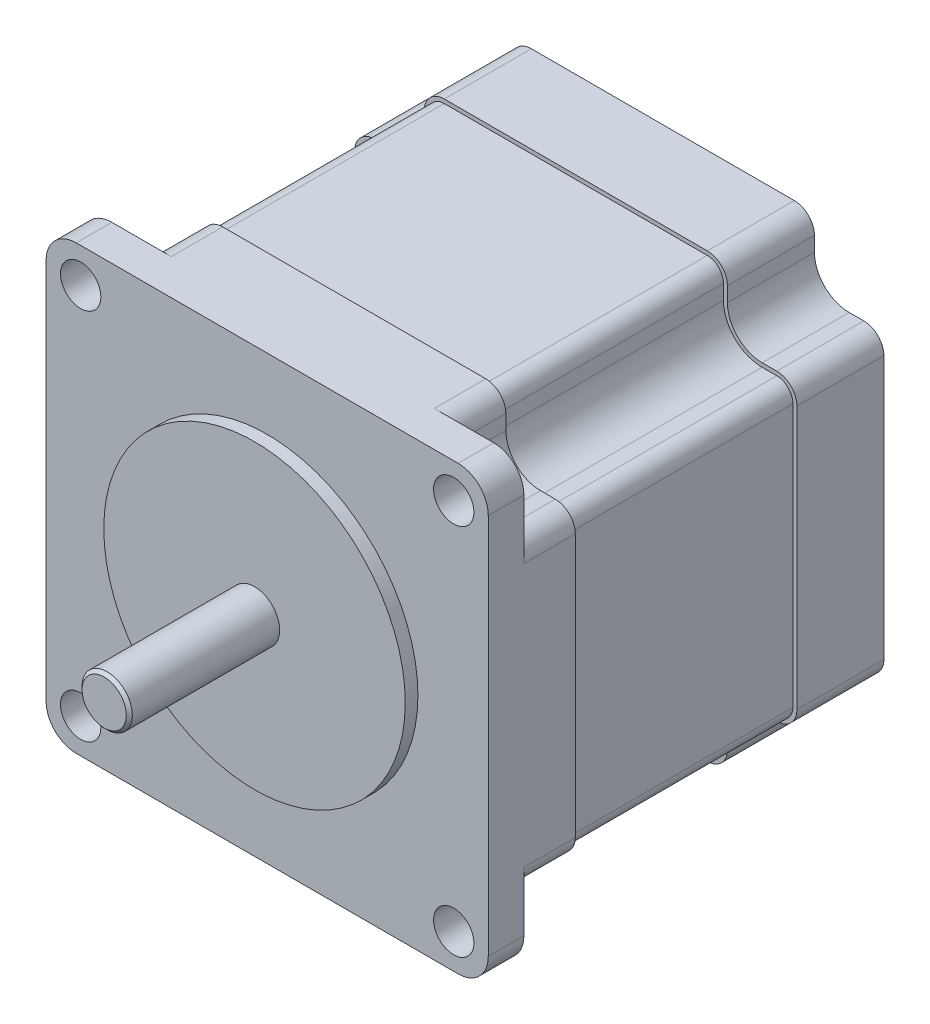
ISO-10303-21;
HEADER;
FILE_DESCRIPTION(('STEP AP214'),'2;1');
FILE_NAME('part.step','',(''),(''),'','','');
FILE_SCHEMA(('AUTOMOTIVE_DESIGN { 1 0 10303 214 1 1 1 1 }'));
ENDSEC;
DATA;
#1=APPLICATION_CONTEXT('core data for automotive mechanical design processes');
#2=APPLICATION_PROTOCOL_DEFINITION('international standard','automotive_design',2000,#1);
#3=PRODUCT_CONTEXT('',#1,'mechanical');
#4=PRODUCT('Part','Part','',(#3));
#5=PRODUCT_RELATED_PRODUCT_CATEGORY('part','',(#4));
#6=PRODUCT_DEFINITION_FORMATION('','',#4);
#7=PRODUCT_DEFINITION_CONTEXT('part definition',#1,'design');
#8=PRODUCT_DEFINITION('design','',#6,#7);
#9=PRODUCT_DEFINITION_SHAPE('','',#8);
#10=(LENGTH_UNIT() NAMED_UNIT(*) SI_UNIT(.MILLI.,.METRE.));
#11=(NAMED_UNIT(*) PLANE_ANGLE_UNIT() SI_UNIT($,.RADIAN.));
#12=(NAMED_UNIT(*) SI_UNIT($,.STERADIAN.) SOLID_ANGLE_UNIT());
#13=UNCERTAINTY_MEASURE_WITH_UNIT(LENGTH_MEASURE(1.E-05),#10,'distance_accuracy_value','');
#14=(GEOMETRIC_REPRESENTATION_CONTEXT(3) GLOBAL_UNCERTAINTY_ASSIGNED_CONTEXT((#13)) GLOBAL_UNIT_ASSIGNED_CONTEXT((#10,
#11,#12)) REPRESENTATION_CONTEXT('',''));
#15=CARTESIAN_POINT('',(0.,0.,0.));
#16=DIRECTION('',(0.,0.,1.));
#17=DIRECTION('',(1.,0.,0.));
#18=AXIS2_PLACEMENT_3D('',#15,#16,#17);
#19=CARTESIAN_POINT('',(-16.62,-27.44,-129.816516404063));
#20=DIRECTION('',(0.,-1.,0.));
#21=DIRECTION('',(1.,0.,0.));
#22=AXIS2_PLACEMENT_3D('',#19,#20,#21);
#23=PLANE('',#22);
#24=CARTESIAN_POINT('',(4.572,-27.44,-42.1));
#25=DIRECTION('',(0.,-1.,0.));
#26=DIRECTION('',(1.,0.,0.));
#27=AXIS2_PLACEMENT_3D('',#24,#25,#26);
#28=CIRCLE('',#27,0.5);
#29=CARTESIAN_POINT('',(5.072,-27.44,-42.1));
#30=VERTEX_POINT('',#29);
#31=EDGE_CURVE('E3253',#30,#30,#28,.T.);
#32=ORIENTED_EDGE('',*,*,#31,.F.);
#33=EDGE_LOOP('',(#32));
#34=FACE_BOUND('',#33,.T.);
#35=CARTESIAN_POINT('',(-1.524,-27.44,-42.1));
#36=DIRECTION('',(0.,-1.,0.));
#37=DIRECTION('',(1.,0.,0.));
#38=AXIS2_PLACEMENT_3D('',#35,#36,#37);
#39=CIRCLE('',#38,0.5);
#40=CARTESIAN_POINT('',(-1.024,-27.44,-42.1));
#41=VERTEX_POINT('',#40);
#42=EDGE_CURVE('E1675',#41,#41,#39,.T.);
#43=ORIENTED_EDGE('',*,*,#42,.F.);
#44=EDGE_LOOP('',(#43));
#45=FACE_BOUND('',#44,.T.);
#46=CARTESIAN_POINT('',(-7.62,-27.44,-42.1));
#47=DIRECTION('',(0.,-1.,0.));
#48=DIRECTION('',(1.,0.,0.));
#49=AXIS2_PLACEMENT_3D('',#46,#47,#48);
#50=CIRCLE('',#49,0.5);
#51=CARTESIAN_POINT('',(-7.12,-27.44,-42.1));
#52=VERTEX_POINT('',#51);
#53=EDGE_CURVE('E683',#52,#52,#50,.T.);
#54=ORIENTED_EDGE('',*,*,#53,.F.);
#55=EDGE_LOOP('',(#54));
#56=FACE_BOUND('',#55,.T.);
#57=DIRECTION('',(-1.,0.,0.));
#58=VECTOR('',#57,1.);
#59=CARTESIAN_POINT('',(-9.738,-27.44,-44.692));
#60=LINE('',#59,#58);
#61=CARTESIAN_POINT('',(9.7126,-27.44,-44.692));
#62=VERTEX_POINT('',#61);
#63=CARTESIAN_POINT('',(-9.7126,-27.44,-44.692));
#64=VERTEX_POINT('',#63);
#65=EDGE_CURVE('E39',#62,#64,#60,.T.);
#66=ORIENTED_EDGE('',*,*,#65,.F.);
#67=DIRECTION('',(0.,0.,1.));
#68=VECTOR('',#67,1.);
#69=CARTESIAN_POINT('',(9.7126,-27.44,-45.2));
#70=LINE('',#69,#68);
#71=CARTESIAN_POINT('',(9.7126,-27.44,-45.2));
#72=VERTEX_POINT('',#71);
#73=EDGE_CURVE('E1684',#72,#62,#70,.T.);
#74=ORIENTED_EDGE('',*,*,#73,.F.);
#75=DIRECTION('',(-1.,0.,0.));
#76=VECTOR('',#75,1.);
#77=CARTESIAN_POINT('',(9.738,-27.44,-45.2));
#78=LINE('',#77,#76);
#79=CARTESIAN_POINT('',(9.738,-27.44,-45.2));
#80=VERTEX_POINT('',#79);
#81=EDGE_CURVE('E1685',#80,#72,#78,.T.);
#82=ORIENTED_EDGE('',*,*,#81,.F.);
#83=DIRECTION('',(0.,0.,-1.));
#84=VECTOR('',#83,1.);
#85=CARTESIAN_POINT('',(9.738,-27.44,-39.508));
#86=LINE('',#85,#84);
#87=CARTESIAN_POINT('',(9.738,-27.44,-39.));
#88=VERTEX_POINT('',#87);
#89=EDGE_CURVE('E1782',#88,#80,#86,.T.);
#90=ORIENTED_EDGE('',*,*,#89,.F.);
#91=DIRECTION('',(-1.,0.,0.));
#92=VECTOR('',#91,1.);
#93=CARTESIAN_POINT('',(-16.62,-27.44,-39.));
#94=LINE('',#93,#92);
#95=CARTESIAN_POINT('',(16.62,-27.44,-39.));
#96=VERTEX_POINT('',#95);
#97=EDGE_CURVE('E801',#96,#88,#94,.T.);
#98=ORIENTED_EDGE('',*,*,#97,.F.);
#99=DIRECTION('',(0.,0.,1.));
#100=VECTOR('',#99,1.);
#101=CARTESIAN_POINT('',(16.62,-27.44,-129.816516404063));
#102=LINE('',#101,#100);
#103=CARTESIAN_POINT('',(16.62,-27.44,-11.));
#104=VERTEX_POINT('',#103);
#105=EDGE_CURVE('E922',#96,#104,#102,.T.);
#106=ORIENTED_EDGE('',*,*,#105,.T.);
#107=DIRECTION('',(1.,0.,0.));
#108=VECTOR('',#107,1.);
#109=CARTESIAN_POINT('',(-16.62,-27.44,-11.));
#110=LINE('',#109,#108);
#111=CARTESIAN_POINT('',(-16.62,-27.44,-11.));
#112=VERTEX_POINT('',#111);
#113=EDGE_CURVE('E878',#112,#104,#110,.T.);
#114=ORIENTED_EDGE('',*,*,#113,.F.);
#115=DIRECTION('',(0.,0.,1.));
#116=VECTOR('',#115,1.);
#117=CARTESIAN_POINT('',(-16.62,-27.44,-129.816516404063));
#118=LINE('',#117,#116);
#119=CARTESIAN_POINT('',(-16.62,-27.44,-39.));
#120=VERTEX_POINT('',#119);
#121=EDGE_CURVE('E924',#120,#112,#118,.T.);
#122=ORIENTED_EDGE('',*,*,#121,.F.);
#123=CARTESIAN_POINT('',(-9.738,-27.44,-39.));
#124=VERTEX_POINT('',#123);
#125=EDGE_CURVE('E805',#124,#120,#94,.T.);
#126=ORIENTED_EDGE('',*,*,#125,.F.);
#127=DIRECTION('',(0.,0.,1.));
#128=VECTOR('',#127,1.);
#129=CARTESIAN_POINT('',(-9.738,-27.44,-39.508));
#130=LINE('',#129,#128);
#131=CARTESIAN_POINT('',(-9.738,-27.44,-45.2));
#132=VERTEX_POINT('',#131);
#133=EDGE_CURVE('E1788',#132,#124,#130,.T.);
#134=ORIENTED_EDGE('',*,*,#133,.F.);
#135=DIRECTION('',(-1.,0.,0.));
#136=VECTOR('',#135,1.);
#137=CARTESIAN_POINT('',(-9.738,-27.44,-45.2));
#138=LINE('',#137,#136);
#139=CARTESIAN_POINT('',(-9.7126,-27.44,-45.2));
#140=VERTEX_POINT('',#139);
#141=EDGE_CURVE('E1701',#140,#132,#138,.T.);
#142=ORIENTED_EDGE('',*,*,#141,.F.);
#143=DIRECTION('',(0.,0.,-1.));
#144=VECTOR('',#143,1.);
#145=CARTESIAN_POINT('',(-9.7126,-27.44,-45.2));
#146=LINE('',#145,#144);
#147=EDGE_CURVE('E1704',#64,#140,#146,.T.);
#148=ORIENTED_EDGE('',*,*,#147,.F.);
#149=EDGE_LOOP('',(#66,#74,#82,#90,#98,#106,#114,#122,#126,#134,#142,#148));
#150=FACE_BOUND('',#149,.T.);
#151=CARTESIAN_POINT('',(9.7126,-27.44,-39.508));
#152=VERTEX_POINT('',#151);
#153=CARTESIAN_POINT('',(9.7126,-27.44,-39.));
#154=VERTEX_POINT('',#153);
#155=EDGE_CURVE('E31',#152,#154,#70,.T.);
#156=ORIENTED_EDGE('',*,*,#155,.F.);
#157=DIRECTION('',(1.,0.,0.));
#158=VECTOR('',#157,1.);
#159=CARTESIAN_POINT('',(-9.738,-27.44,-39.508));
#160=LINE('',#159,#158);
#161=CARTESIAN_POINT('',(-9.7126,-27.44,-39.508));
#162=VERTEX_POINT('',#161);
#163=EDGE_CURVE('E1784',#162,#152,#160,.T.);
#164=ORIENTED_EDGE('',*,*,#163,.F.);
#165=CARTESIAN_POINT('',(-9.7126,-27.44,-39.));
#166=VERTEX_POINT('',#165);
#167=EDGE_CURVE('E1706',#166,#162,#146,.T.);
#168=ORIENTED_EDGE('',*,*,#167,.F.);
#169=EDGE_CURVE('E804',#154,#166,#94,.T.);
#170=ORIENTED_EDGE('',*,*,#169,.F.);
#171=EDGE_LOOP('',(#156,#164,#168,#170));
#172=FACE_BOUND('',#171,.T.);
#173=CARTESIAN_POINT('',(-4.572,-27.44,-42.1));
#174=DIRECTION('',(0.,-1.,0.));
#175=DIRECTION('',(1.,0.,0.));
#176=AXIS2_PLACEMENT_3D('',#173,#174,#175);
#177=CIRCLE('',#176,0.5);
#178=CARTESIAN_POINT('',(-4.072,-27.44,-42.1));
#179=VERTEX_POINT('',#178);
#180=EDGE_CURVE('E1673',#179,#179,#177,.T.);
#181=ORIENTED_EDGE('',*,*,#180,.F.);
#182=EDGE_LOOP('',(#181));
#183=FACE_BOUND('',#182,.T.);
#184=CARTESIAN_POINT('',(1.524,-27.44,-42.1));
#185=DIRECTION('',(0.,-1.,0.));
#186=DIRECTION('',(1.,0.,0.));
#187=AXIS2_PLACEMENT_3D('',#184,#185,#186);
#188=CIRCLE('',#187,0.5);
#189=CARTESIAN_POINT('',(2.024,-27.44,-42.1));
#190=VERTEX_POINT('',#189);
#191=EDGE_CURVE('E1680',#190,#190,#188,.T.);
#192=ORIENTED_EDGE('',*,*,#191,.F.);
#193=EDGE_LOOP('',(#192));
#194=FACE_BOUND('',#193,.T.);
#195=CARTESIAN_POINT('',(7.62,-27.44,-42.1));
#196=DIRECTION('',(0.,-1.,0.));
#197=DIRECTION('',(1.,0.,0.));
#198=AXIS2_PLACEMENT_3D('',#195,#196,#197);
#199=CIRCLE('',#198,0.5);
#200=CARTESIAN_POINT('',(8.12,-27.44,-42.1));
#201=VERTEX_POINT('',#200);
#202=EDGE_CURVE('E3251',#201,#201,#199,.T.);
#203=ORIENTED_EDGE('',*,*,#202,.F.);
#204=EDGE_LOOP('',(#203));
#205=FACE_BOUND('',#204,.T.);
#206=ADVANCED_FACE('F16',(#34,#45,#56,#150,#172,#183,#194,#205),#23,.T.);
#207=CARTESIAN_POINT('',(-10.5,-32.94,-39.));
#208=DIRECTION('',(0.,1.,0.));
#209=DIRECTION('',(0.,0.,1.));
#210=AXIS2_PLACEMENT_3D('',#207,#208,#209);
#211=PLANE('',#210);
#212=DIRECTION('',(-1.,0.,0.));
#213=VECTOR('',#212,1.);
#214=CARTESIAN_POINT('',(-9.738,-32.94,-39.508));
#215=LINE('',#214,#213);
#216=CARTESIAN_POINT('',(9.7126,-32.94,-39.508));
#217=VERTEX_POINT('',#216);
#218=CARTESIAN_POINT('',(8.382,-32.94,-39.508));
#219=VERTEX_POINT('',#218);
#220=EDGE_CURVE('E1785',#217,#219,#215,.T.);
#221=ORIENTED_EDGE('',*,*,#220,.F.);
#222=DIRECTION('',(0.,0.,-1.));
#223=VECTOR('',#222,1.);
#224=CARTESIAN_POINT('',(9.7126,-32.94,-45.2));
#225=LINE('',#224,#223);
#226=CARTESIAN_POINT('',(9.7126,-32.94,-39.));
#227=VERTEX_POINT('',#226);
#228=EDGE_CURVE('E682',#227,#217,#225,.T.);
#229=ORIENTED_EDGE('',*,*,#228,.F.);
#230=DIRECTION('',(-1.,0.,0.));
#231=VECTOR('',#230,1.);
#232=CARTESIAN_POINT('',(-10.5,-32.94,-39.));
#233=LINE('',#232,#231);
#234=CARTESIAN_POINT('',(8.382,-32.94,-39.));
#235=VERTEX_POINT('',#234);
#236=EDGE_CURVE('E713',#227,#235,#233,.T.);
#237=ORIENTED_EDGE('',*,*,#236,.T.);
#238=DIRECTION('',(0.,0.,1.));
#239=VECTOR('',#238,1.);
#240=CARTESIAN_POINT('',(8.382,-32.94,-39.));
#241=LINE('',#240,#239);
#242=EDGE_CURVE('E1727',#219,#235,#241,.T.);
#243=ORIENTED_EDGE('',*,*,#242,.F.);
#244=EDGE_LOOP('',(#221,#229,#237,#243));
#245=FACE_BOUND('',#244,.T.);
#246=ADVANCED_FACE('F1398',(#245),#211,.F.);
#247=DIRECTION('',(1.,0.,0.));
#248=VECTOR('',#247,1.);
#249=CARTESIAN_POINT('',(-10.5,-32.94,-45.2));
#250=LINE('',#249,#248);
#251=CARTESIAN_POINT('',(-9.7126,-32.94,-45.2));
#252=VERTEX_POINT('',#251);
#253=CARTESIAN_POINT('',(9.7126,-32.94,-45.2));
#254=VERTEX_POINT('',#253);
#255=EDGE_CURVE('E690',#252,#254,#250,.T.);
#256=ORIENTED_EDGE('',*,*,#255,.T.);
#257=CARTESIAN_POINT('',(9.7126,-32.94,-44.692));
#258=VERTEX_POINT('',#257);
#259=EDGE_CURVE('E671',#258,#254,#225,.T.);
#260=ORIENTED_EDGE('',*,*,#259,.F.);
#261=DIRECTION('',(1.,0.,0.));
#262=VECTOR('',#261,1.);
#263=CARTESIAN_POINT('',(-9.738,-32.94,-44.692));
#264=LINE('',#263,#262);
#265=CARTESIAN_POINT('',(-9.7126,-32.94,-44.692));
#266=VERTEX_POINT('',#265);
#267=EDGE_CURVE('E1791',#266,#258,#264,.T.);
#268=ORIENTED_EDGE('',*,*,#267,.F.);
#269=DIRECTION('',(0.,0.,1.));
#270=VECTOR('',#269,1.);
#271=CARTESIAN_POINT('',(-9.7126,-32.94,-45.2));
#272=LINE('',#271,#270);
#273=EDGE_CURVE('E697',#252,#266,#272,.T.);
#274=ORIENTED_EDGE('',*,*,#273,.F.);
#275=EDGE_LOOP('',(#256,#260,#268,#274));
#276=FACE_BOUND('',#275,.T.);
#277=ADVANCED_FACE('F696',(#276),#211,.F.);
#278=CARTESIAN_POINT('',(-10.5,-32.94,-45.2));
#279=DIRECTION('',(0.,0.,1.));
#280=DIRECTION('',(1.,0.,0.));
#281=AXIS2_PLACEMENT_3D('',#278,#279,#280);
#282=PLANE('',#281);
#283=DIRECTION('',(1.,0.,0.));
#284=VECTOR('',#283,1.);
#285=CARTESIAN_POINT('',(-10.5,-27.94,-45.2));
#286=LINE('',#285,#284);
#287=CARTESIAN_POINT('',(-9.7126,-27.94,-45.2));
#288=VERTEX_POINT('',#287);
#289=CARTESIAN_POINT('',(9.7126,-27.94,-45.2));
#290=VERTEX_POINT('',#289);
#291=EDGE_CURVE('E692',#288,#290,#286,.T.);
#292=ORIENTED_EDGE('',*,*,#291,.T.);
#293=DIRECTION('',(0.,-1.,0.));
#294=VECTOR('',#293,1.);
#295=CARTESIAN_POINT('',(9.7126,-21.2399479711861,-45.2));
#296=LINE('',#295,#294);
#297=EDGE_CURVE('E675',#290,#254,#296,.T.);
#298=ORIENTED_EDGE('',*,*,#297,.T.);
#299=ORIENTED_EDGE('',*,*,#255,.F.);
#300=DIRECTION('',(0.,-1.,0.));
#301=VECTOR('',#300,1.);
#302=CARTESIAN_POINT('',(-9.7126,-21.2399479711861,-45.2));
#303=LINE('',#302,#301);
#304=EDGE_CURVE('E1716',#288,#252,#303,.T.);
#305=ORIENTED_EDGE('',*,*,#304,.F.);
#306=EDGE_LOOP('',(#292,#298,#299,#305));
#307=FACE_BOUND('',#306,.T.);
#308=ADVANCED_FACE('F688',(#307),#282,.F.);
#309=CARTESIAN_POINT('',(-27.94,27.94,-39.));
#310=DIRECTION('',(0.,0.,1.));
#311=DIRECTION('',(1.,0.,0.));
#312=AXIS2_PLACEMENT_3D('',#309,#310,#311);
#313=PLANE('',#312);
#314=DIRECTION('',(0.,-1.,0.));
#315=VECTOR('',#314,1.);
#316=CARTESIAN_POINT('',(9.7126,-21.2399479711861,-39.));
#317=LINE('',#316,#315);
#318=EDGE_CURVE('E1687',#154,#227,#317,.T.);
#319=ORIENTED_EDGE('',*,*,#318,.F.);
#320=ORIENTED_EDGE('',*,*,#169,.T.);
#321=DIRECTION('',(0.,-1.,0.));
#322=VECTOR('',#321,1.);
#323=CARTESIAN_POINT('',(-9.7126,-21.2399479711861,-39.));
#324=LINE('',#323,#322);
#325=CARTESIAN_POINT('',(-9.7126,-32.94,-39.));
#326=VERTEX_POINT('',#325);
#327=EDGE_CURVE('E1705',#166,#326,#324,.T.);
#328=ORIENTED_EDGE('',*,*,#327,.T.);
#329=CARTESIAN_POINT('',(-8.382,-32.94,-39.));
#330=VERTEX_POINT('',#329);
#331=EDGE_CURVE('E714',#330,#326,#233,.T.);
#332=ORIENTED_EDGE('',*,*,#331,.F.);
#333=DIRECTION('',(0.,-1.,0.));
#334=VECTOR('',#333,1.);
#335=CARTESIAN_POINT('',(-8.382,-30.4,-39.));
#336=LINE('',#335,#334);
#337=CARTESIAN_POINT('',(-8.382,-30.4,-39.));
#338=VERTEX_POINT('',#337);
#339=EDGE_CURVE('E1771',#338,#330,#336,.T.);
#340=ORIENTED_EDGE('',*,*,#339,.F.);
#341=DIRECTION('',(-1.,0.,0.));
#342=VECTOR('',#341,1.);
#343=CARTESIAN_POINT('',(-8.382,-30.4,-39.));
#344=LINE('',#343,#342);
#345=CARTESIAN_POINT('',(-7.62,-30.4,-39.));
#346=VERTEX_POINT('',#345);
#347=EDGE_CURVE('E1764',#346,#338,#344,.T.);
#348=ORIENTED_EDGE('',*,*,#347,.F.);
#349=DIRECTION('',(0.,-1.,0.));
#350=VECTOR('',#349,1.);
#351=CARTESIAN_POINT('',(-7.62,-30.4,-39.));
#352=LINE('',#351,#350);
#353=CARTESIAN_POINT('',(-7.62,-32.94,-39.));
#354=VERTEX_POINT('',#353);
#355=EDGE_CURVE('E1774',#346,#354,#352,.T.);
#356=ORIENTED_EDGE('',*,*,#355,.T.);
#357=CARTESIAN_POINT('',(7.62,-32.94,-39.));
#358=VERTEX_POINT('',#357);
#359=EDGE_CURVE('E1838',#358,#354,#233,.T.);
#360=ORIENTED_EDGE('',*,*,#359,.F.);
#361=DIRECTION('',(0.,-1.,0.));
#362=VECTOR('',#361,1.);
#363=CARTESIAN_POINT('',(7.62,-30.4,-39.));
#364=LINE('',#363,#362);
#365=CARTESIAN_POINT('',(7.62,-30.4,-39.));
#366=VERTEX_POINT('',#365);
#367=EDGE_CURVE('E1751',#366,#358,#364,.T.);
#368=ORIENTED_EDGE('',*,*,#367,.F.);
#369=DIRECTION('',(-1.,0.,0.));
#370=VECTOR('',#369,1.);
#371=CARTESIAN_POINT('',(8.382,-30.4,-39.));
#372=LINE('',#371,#370);
#373=CARTESIAN_POINT('',(8.382,-30.4,-39.));
#374=VERTEX_POINT('',#373);
#375=EDGE_CURVE('E1731',#374,#366,#372,.T.);
#376=ORIENTED_EDGE('',*,*,#375,.F.);
#377=DIRECTION('',(0.,-1.,0.));
#378=VECTOR('',#377,1.);
#379=CARTESIAN_POINT('',(8.382,-30.4,-39.));
#380=LINE('',#379,#378);
#381=EDGE_CURVE('E1740',#374,#235,#380,.T.);
#382=ORIENTED_EDGE('',*,*,#381,.T.);
#383=ORIENTED_EDGE('',*,*,#236,.F.);
#384=EDGE_LOOP('',(#319,#320,#328,#332,#340,#348,#356,#360,#368,#376,#382,#383));
#385=FACE_BOUND('',#384,.T.);
#386=ADVANCED_FACE('F1816',(#385),#313,.T.);
#387=CARTESIAN_POINT('',(10.5,-32.94,-39.));
#388=VERTEX_POINT('',#387);
#389=CARTESIAN_POINT('',(9.738,-32.94,-39.));
#390=VERTEX_POINT('',#389);
#391=EDGE_CURVE('E709',#388,#390,#233,.T.);
#392=ORIENTED_EDGE('',*,*,#391,.T.);
#393=DIRECTION('',(0.,0.,1.));
#394=VECTOR('',#393,1.);
#395=CARTESIAN_POINT('',(9.738,-32.94,-39.508));
#396=LINE('',#395,#394);
#397=CARTESIAN_POINT('',(9.738,-32.94,-45.2));
#398=VERTEX_POINT('',#397);
#399=EDGE_CURVE('E1793',#398,#390,#396,.T.);
#400=ORIENTED_EDGE('',*,*,#399,.F.);
#401=CARTESIAN_POINT('',(10.5,-32.94,-45.2));
#402=VERTEX_POINT('',#401);
#403=EDGE_CURVE('E699',#398,#402,#250,.T.);
#404=ORIENTED_EDGE('',*,*,#403,.T.);
#405=DIRECTION('',(0.,0.,1.));
#406=VECTOR('',#405,1.);
#407=CARTESIAN_POINT('',(10.5,-32.94,-45.2));
#408=LINE('',#407,#406);
#409=EDGE_CURVE('E702',#402,#388,#408,.T.);
#410=ORIENTED_EDGE('',*,*,#409,.T.);
#411=EDGE_LOOP('',(#392,#400,#404,#410));
#412=FACE_BOUND('',#411,.T.);
#413=ADVANCED_FACE('F2002',(#412),#211,.F.);
#414=ORIENTED_EDGE('',*,*,#331,.T.);
#415=CARTESIAN_POINT('',(-9.7126,-32.94,-39.508));
#416=VERTEX_POINT('',#415);
#417=EDGE_CURVE('E1700',#416,#326,#272,.T.);
#418=ORIENTED_EDGE('',*,*,#417,.F.);
#419=CARTESIAN_POINT('',(-8.382,-32.94,-39.508));
#420=VERTEX_POINT('',#419);
#421=EDGE_CURVE('E1795',#420,#416,#215,.T.);
#422=ORIENTED_EDGE('',*,*,#421,.F.);
#423=DIRECTION('',(0.,0.,-1.));
#424=VECTOR('',#423,1.);
#425=CARTESIAN_POINT('',(-8.382,-32.94,-39.));
#426=LINE('',#425,#424);
#427=EDGE_CURVE('E1747',#330,#420,#426,.T.);
#428=ORIENTED_EDGE('',*,*,#427,.F.);
#429=EDGE_LOOP('',(#414,#418,#422,#428));
#430=FACE_BOUND('',#429,.T.);
#431=ADVANCED_FACE('F1809',(#430),#211,.F.);
#432=ORIENTED_EDGE('',*,*,#403,.F.);
#433=DIRECTION('',(0.,-1.,0.));
#434=VECTOR('',#433,1.);
#435=CARTESIAN_POINT('',(9.738,-21.2399479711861,-45.2));
#436=LINE('',#435,#434);
#437=CARTESIAN_POINT('',(9.738,-27.94,-45.2));
#438=VERTEX_POINT('',#437);
#439=EDGE_CURVE('E1694',#438,#398,#436,.T.);
#440=ORIENTED_EDGE('',*,*,#439,.F.);
#441=CARTESIAN_POINT('',(10.5,-27.94,-45.2));
#442=VERTEX_POINT('',#441);
#443=EDGE_CURVE('E718',#438,#442,#286,.T.);
#444=ORIENTED_EDGE('',*,*,#443,.T.);
#445=DIRECTION('',(0.,1.,0.));
#446=VECTOR('',#445,1.);
#447=CARTESIAN_POINT('',(10.5,-32.94,-45.2));
#448=LINE('',#447,#446);
#449=EDGE_CURVE('E731',#402,#442,#448,.T.);
#450=ORIENTED_EDGE('',*,*,#449,.F.);
#451=EDGE_LOOP('',(#432,#440,#444,#450));
#452=FACE_BOUND('',#451,.T.);
#453=ADVANCED_FACE('F1877',(#452),#282,.F.);
#454=CARTESIAN_POINT('',(-10.5,-32.94,-45.2));
#455=VERTEX_POINT('',#454);
#456=CARTESIAN_POINT('',(-9.738,-32.94,-45.2));
#457=VERTEX_POINT('',#456);
#458=EDGE_CURVE('E698',#455,#457,#250,.T.);
#459=ORIENTED_EDGE('',*,*,#458,.T.);
#460=DIRECTION('',(0.,0.,-1.));
#461=VECTOR('',#460,1.);
#462=CARTESIAN_POINT('',(-9.738,-32.94,-39.508));
#463=LINE('',#462,#461);
#464=CARTESIAN_POINT('',(-9.738,-32.94,-39.));
#465=VERTEX_POINT('',#464);
#466=EDGE_CURVE('E1773',#465,#457,#463,.T.);
#467=ORIENTED_EDGE('',*,*,#466,.F.);
#468=CARTESIAN_POINT('',(-10.5,-32.94,-39.));
#469=VERTEX_POINT('',#468);
#470=EDGE_CURVE('E708',#465,#469,#233,.T.);
#471=ORIENTED_EDGE('',*,*,#470,.T.);
#472=DIRECTION('',(0.,0.,-1.));
#473=VECTOR('',#472,1.);
#474=CARTESIAN_POINT('',(-10.5,-32.94,-45.2));
#475=LINE('',#474,#473);
#476=EDGE_CURVE('E703',#469,#455,#475,.T.);
#477=ORIENTED_EDGE('',*,*,#476,.T.);
#478=EDGE_LOOP('',(#459,#467,#471,#477));
#479=FACE_BOUND('',#478,.T.);
#480=ADVANCED_FACE('F1869',(#479),#211,.F.);
#481=CARTESIAN_POINT('',(-27.94,-27.94,-50.));
#482=DIRECTION('',(0.,-1.,0.));
#483=DIRECTION('',(1.,0.,0.));
#484=AXIS2_PLACEMENT_3D('',#481,#482,#483);
#485=PLANE('',#484);
#486=CARTESIAN_POINT('',(-10.5,-27.94,-45.2));
#487=VERTEX_POINT('',#486);
#488=CARTESIAN_POINT('',(-9.738,-27.94,-45.2));
#489=VERTEX_POINT('',#488);
#490=EDGE_CURVE('E719',#487,#489,#286,.T.);
#491=ORIENTED_EDGE('',*,*,#490,.F.);
#492=DIRECTION('',(0.,0.,-1.));
#493=VECTOR('',#492,1.);
#494=CARTESIAN_POINT('',(-10.5,-27.94,-45.2));
#495=LINE('',#494,#493);
#496=CARTESIAN_POINT('',(-10.5,-27.94,-39.));
#497=VERTEX_POINT('',#496);
#498=EDGE_CURVE('E715',#497,#487,#495,.T.);
#499=ORIENTED_EDGE('',*,*,#498,.F.);
#500=DIRECTION('',(-1.,0.,0.));
#501=VECTOR('',#500,1.);
#502=CARTESIAN_POINT('',(-27.94,-27.94,-39.));
#503=LINE('',#502,#501);
#504=CARTESIAN_POINT('',(-16.62,-27.94,-39.));
#505=VERTEX_POINT('',#504);
#506=EDGE_CURVE('E1005',#497,#505,#503,.T.);
#507=ORIENTED_EDGE('',*,*,#506,.T.);
#508=DIRECTION('',(0.,0.,-1.));
#509=VECTOR('',#508,1.);
#510=CARTESIAN_POINT('',(-16.62,-27.94,-50.));
#511=LINE('',#510,#509);
#512=CARTESIAN_POINT('',(-16.62,-27.94,-50.));
#513=VERTEX_POINT('',#512);
#514=EDGE_CURVE('E1261',#505,#513,#511,.T.);
#515=ORIENTED_EDGE('',*,*,#514,.T.);
#516=DIRECTION('',(1.,0.,0.));
#517=VECTOR('',#516,1.);
#518=CARTESIAN_POINT('',(-27.94,-27.94,-50.));
#519=LINE('',#518,#517);
#520=CARTESIAN_POINT('',(16.62,-27.94,-50.));
#521=VERTEX_POINT('',#520);
#522=EDGE_CURVE('E1197',#513,#521,#519,.T.);
#523=ORIENTED_EDGE('',*,*,#522,.T.);
#524=DIRECTION('',(0.,0.,-1.));
#525=VECTOR('',#524,1.);
#526=CARTESIAN_POINT('',(16.62,-27.94,-4.5));
#527=LINE('',#526,#525);
#528=CARTESIAN_POINT('',(16.62,-27.94,-39.));
#529=VERTEX_POINT('',#528);
#530=EDGE_CURVE('E1266',#521,#529,#527,.F.);
#531=ORIENTED_EDGE('',*,*,#530,.T.);
#532=CARTESIAN_POINT('',(10.5,-27.94,-39.));
#533=VERTEX_POINT('',#532);
#534=EDGE_CURVE('E1006',#529,#533,#503,.T.);
#535=ORIENTED_EDGE('',*,*,#534,.T.);
#536=DIRECTION('',(0.,0.,1.));
#537=VECTOR('',#536,1.);
#538=CARTESIAN_POINT('',(10.5,-27.94,-45.2));
#539=LINE('',#538,#537);
#540=EDGE_CURVE('E722',#442,#533,#539,.T.);
#541=ORIENTED_EDGE('',*,*,#540,.F.);
#542=ORIENTED_EDGE('',*,*,#443,.F.);
#543=EDGE_CURVE('E2112',#290,#438,#286,.T.);
#544=ORIENTED_EDGE('',*,*,#543,.F.);
#545=ORIENTED_EDGE('',*,*,#291,.F.);
#546=EDGE_CURVE('E723',#489,#288,#286,.T.);
#547=ORIENTED_EDGE('',*,*,#546,.F.);
#548=EDGE_LOOP('',(#491,#499,#507,#515,#523,#531,#535,#541,#542,#544,#545,#547));
#549=FACE_BOUND('',#548,.T.);
#550=ADVANCED_FACE('F1578',(#549),#485,.T.);
#551=CARTESIAN_POINT('',(0.,0.,1.6));
#552=DIRECTION('',(0.,0.,1.));
#553=DIRECTION('',(1.,0.,0.));
#554=AXIS2_PLACEMENT_3D('',#551,#552,#553);
#555=PLANE('',#554);
#556=CARTESIAN_POINT('',(0.,0.,1.6));
#557=DIRECTION('',(0.,0.,1.));
#558=DIRECTION('',(1.,0.,0.));
#559=AXIS2_PLACEMENT_3D('',#556,#557,#558);
#560=CIRCLE('',#559,19.05);
#561=CARTESIAN_POINT('',(19.05,0.,1.6));
#562=VERTEX_POINT('',#561);
#563=EDGE_CURVE('E753',#562,#562,#560,.T.);
#564=ORIENTED_EDGE('',*,*,#563,.T.);
#565=EDGE_LOOP('',(#564));
#566=FACE_BOUND('',#565,.T.);
#567=CARTESIAN_POINT('',(0.,0.,1.6));
#568=DIRECTION('',(0.,0.,1.));
#569=DIRECTION('',(1.,0.,0.));
#570=AXIS2_PLACEMENT_3D('',#567,#568,#569);
#571=CIRCLE('',#570,3.175);
#572=CARTESIAN_POINT('',(3.175,0.,1.6));
#573=VERTEX_POINT('',#572);
#574=EDGE_CURVE('E760',#573,#573,#571,.F.);
#575=ORIENTED_EDGE('',*,*,#574,.T.);
#576=EDGE_LOOP('',(#575));
#577=FACE_BOUND('',#576,.T.);
#578=ADVANCED_FACE('F1567',(#566,#577),#555,.T.);
#579=CARTESIAN_POINT('',(-27.94,27.94,0.));
#580=DIRECTION('',(0.,0.,1.));
#581=DIRECTION('',(1.,0.,0.));
#582=AXIS2_PLACEMENT_3D('',#579,#580,#581);
#583=PLANE('',#582);
#584=CARTESIAN_POINT('',(-23.5731723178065,-23.5731723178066,0.));
#585=DIRECTION('',(0.,0.,1.));
#586=DIRECTION('',(1.,0.,0.));
#587=AXIS2_PLACEMENT_3D('',#584,#585,#586);
#588=CIRCLE('',#587,2.55);
#589=CARTESIAN_POINT('',(-21.0231723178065,-23.5731723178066,0.));
#590=VERTEX_POINT('',#589);
#591=EDGE_CURVE('E737',#590,#590,#588,.T.);
#592=ORIENTED_EDGE('',*,*,#591,.F.);
#593=EDGE_LOOP('',(#592));
#594=FACE_BOUND('',#593,.T.);
#595=CARTESIAN_POINT('',(23.5731723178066,-23.5731723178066,0.));
#596=DIRECTION('',(0.,0.,1.));
#597=DIRECTION('',(1.,0.,0.));
#598=AXIS2_PLACEMENT_3D('',#595,#596,#597);
#599=CIRCLE('',#598,2.55);
#600=CARTESIAN_POINT('',(26.1231723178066,-23.5731723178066,0.));
#601=VERTEX_POINT('',#600);
#602=EDGE_CURVE('E741',#601,#601,#599,.T.);
#603=ORIENTED_EDGE('',*,*,#602,.F.);
#604=EDGE_LOOP('',(#603));
#605=FACE_BOUND('',#604,.T.);
#606=CARTESIAN_POINT('',(23.5731723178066,23.5731723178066,0.));
#607=DIRECTION('',(0.,0.,1.));
#608=DIRECTION('',(1.,0.,0.));
#609=AXIS2_PLACEMENT_3D('',#606,#607,#608);
#610=CIRCLE('',#609,2.55);
#611=CARTESIAN_POINT('',(26.1231723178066,23.5731723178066,0.));
#612=VERTEX_POINT('',#611);
#613=EDGE_CURVE('E745',#612,#612,#610,.T.);
#614=ORIENTED_EDGE('',*,*,#613,.F.);
#615=EDGE_LOOP('',(#614));
#616=FACE_BOUND('',#615,.T.);
#617=CARTESIAN_POINT('',(-23.5731723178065,23.5731723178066,0.));
#618=DIRECTION('',(0.,0.,1.));
#619=DIRECTION('',(1.,0.,0.));
#620=AXIS2_PLACEMENT_3D('',#617,#618,#619);
#621=CIRCLE('',#620,2.55);
#622=CARTESIAN_POINT('',(-21.0231723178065,23.5731723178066,0.));
#623=VERTEX_POINT('',#622);
#624=EDGE_CURVE('E749',#623,#623,#621,.T.);
#625=ORIENTED_EDGE('',*,*,#624,.F.);
#626=EDGE_LOOP('',(#625));
#627=FACE_BOUND('',#626,.T.);
#628=DIRECTION('',(1.,0.,0.));
#629=VECTOR('',#628,1.);
#630=CARTESIAN_POINT('',(-27.94,-27.94,0.));
#631=LINE('',#630,#629);
#632=CARTESIAN_POINT('',(-24.13,-27.94,0.));
#633=VERTEX_POINT('',#632);
#634=CARTESIAN_POINT('',(24.13,-27.94,0.));
#635=VERTEX_POINT('',#634);
#636=EDGE_CURVE('E1209',#633,#635,#631,.T.);
#637=ORIENTED_EDGE('',*,*,#636,.T.);
#638=CARTESIAN_POINT('',(24.13,-24.13,0.));
#639=DIRECTION('',(0.,0.,1.));
#640=DIRECTION('',(1.,0.,0.));
#641=AXIS2_PLACEMENT_3D('',#638,#639,#640);
#642=CIRCLE('',#641,3.81);
#643=CARTESIAN_POINT('',(27.94,-24.13,0.));
#644=VERTEX_POINT('',#643);
#645=EDGE_CURVE('E1339',#635,#644,#642,.T.);
#646=ORIENTED_EDGE('',*,*,#645,.T.);
#647=DIRECTION('',(0.,1.,0.));
#648=VECTOR('',#647,1.);
#649=CARTESIAN_POINT('',(27.94,-27.94,0.));
#650=LINE('',#649,#648);
#651=CARTESIAN_POINT('',(27.94,24.13,0.));
#652=VERTEX_POINT('',#651);
#653=EDGE_CURVE('E1194',#644,#652,#650,.T.);
#654=ORIENTED_EDGE('',*,*,#653,.T.);
#655=CARTESIAN_POINT('',(24.13,24.13,0.));
#656=DIRECTION('',(0.,0.,1.));
#657=DIRECTION('',(1.,0.,0.));
#658=AXIS2_PLACEMENT_3D('',#655,#656,#657);
#659=CIRCLE('',#658,3.81);
#660=CARTESIAN_POINT('',(24.13,27.94,0.));
#661=VERTEX_POINT('',#660);
#662=EDGE_CURVE('E1333',#652,#661,#659,.T.);
#663=ORIENTED_EDGE('',*,*,#662,.T.);
#664=DIRECTION('',(-1.,0.,0.));
#665=VECTOR('',#664,1.);
#666=CARTESIAN_POINT('',(27.94,27.94,0.));
#667=LINE('',#666,#665);
#668=CARTESIAN_POINT('',(-24.13,27.94,0.));
#669=VERTEX_POINT('',#668);
#670=EDGE_CURVE('E1189',#661,#669,#667,.T.);
#671=ORIENTED_EDGE('',*,*,#670,.T.);
#672=CARTESIAN_POINT('',(-24.13,24.13,0.));
#673=DIRECTION('',(0.,0.,1.));
#674=DIRECTION('',(1.,0.,0.));
#675=AXIS2_PLACEMENT_3D('',#672,#673,#674);
#676=CIRCLE('',#675,3.81);
#677=CARTESIAN_POINT('',(-27.94,24.13,0.));
#678=VERTEX_POINT('',#677);
#679=EDGE_CURVE('E1335',#669,#678,#676,.T.);
#680=ORIENTED_EDGE('',*,*,#679,.T.);
#681=DIRECTION('',(0.,-1.,0.));
#682=VECTOR('',#681,1.);
#683=CARTESIAN_POINT('',(-27.94,27.94,0.));
#684=LINE('',#683,#682);
#685=CARTESIAN_POINT('',(-27.94,-24.13,0.));
#686=VERTEX_POINT('',#685);
#687=EDGE_CURVE('E1206',#678,#686,#684,.T.);
#688=ORIENTED_EDGE('',*,*,#687,.T.);
#689=CARTESIAN_POINT('',(-24.13,-24.13,0.));
#690=DIRECTION('',(0.,0.,1.));
#691=DIRECTION('',(1.,0.,0.));
#692=AXIS2_PLACEMENT_3D('',#689,#690,#691);
#693=CIRCLE('',#692,3.81);
#694=EDGE_CURVE('E1337',#686,#633,#693,.T.);
#695=ORIENTED_EDGE('',*,*,#694,.T.);
#696=EDGE_LOOP('',(#637,#646,#654,#663,#671,#680,#688,#695));
#697=FACE_BOUND('',#696,.T.);
#698=CARTESIAN_POINT('',(0.,0.,0.));
#699=DIRECTION('',(0.,0.,1.));
#700=DIRECTION('',(1.,0.,0.));
#701=AXIS2_PLACEMENT_3D('',#698,#699,#700);
#702=CIRCLE('',#701,19.05);
#703=CARTESIAN_POINT('',(19.05,0.,0.));
#704=VERTEX_POINT('',#703);
#705=EDGE_CURVE('E757',#704,#704,#702,.T.);
#706=ORIENTED_EDGE('',*,*,#705,.F.);
#707=EDGE_LOOP('',(#706));
#708=FACE_BOUND('',#707,.T.);
#709=ADVANCED_FACE('F1563',(#594,#605,#616,#627,#697,#708),#583,.T.);
#710=CARTESIAN_POINT('',(27.94,27.94,-50.));
#711=DIRECTION('',(0.,1.,0.));
#712=DIRECTION('',(-1.,0.,0.));
#713=AXIS2_PLACEMENT_3D('',#710,#711,#712);
#714=PLANE('',#713);
#715=DIRECTION('',(1.,0.,0.));
#716=VECTOR('',#715,1.);
#717=CARTESIAN_POINT('',(-19.16,27.94,-4.5));
#718=LINE('',#717,#716);
#719=CARTESIAN_POINT('',(-24.13,27.94,-4.5));
#720=VERTEX_POINT('',#719);
#721=CARTESIAN_POINT('',(-16.62,27.94,-4.5));
#722=VERTEX_POINT('',#721);
#723=EDGE_CURVE('E1180',#720,#722,#718,.T.);
#724=ORIENTED_EDGE('',*,*,#723,.F.);
#725=DIRECTION('',(0.,0.,1.));
#726=VECTOR('',#725,1.);
#727=CARTESIAN_POINT('',(-24.13,27.94,-50.));
#728=LINE('',#727,#726);
#729=EDGE_CURVE('E1357',#720,#669,#728,.T.);
#730=ORIENTED_EDGE('',*,*,#729,.T.);
#731=ORIENTED_EDGE('',*,*,#670,.F.);
#732=DIRECTION('',(0.,0.,1.));
#733=VECTOR('',#732,1.);
#734=CARTESIAN_POINT('',(24.13,27.94,-50.));
#735=LINE('',#734,#733);
#736=CARTESIAN_POINT('',(24.13,27.94,-4.5));
#737=VERTEX_POINT('',#736);
#738=EDGE_CURVE('E1355',#661,#737,#735,.F.);
#739=ORIENTED_EDGE('',*,*,#738,.T.);
#740=DIRECTION('',(1.,0.,0.));
#741=VECTOR('',#740,1.);
#742=CARTESIAN_POINT('',(27.94,27.94,-4.5));
#743=LINE('',#742,#741);
#744=CARTESIAN_POINT('',(16.62,27.94,-4.5));
#745=VERTEX_POINT('',#744);
#746=EDGE_CURVE('E1081',#745,#737,#743,.T.);
#747=ORIENTED_EDGE('',*,*,#746,.F.);
#748=DIRECTION('',(0.,0.,-1.));
#749=VECTOR('',#748,1.);
#750=CARTESIAN_POINT('',(16.62,27.94,-50.));
#751=LINE('',#750,#749);
#752=CARTESIAN_POINT('',(16.62,27.94,-11.));
#753=VERTEX_POINT('',#752);
#754=EDGE_CURVE('E1218',#745,#753,#751,.T.);
#755=ORIENTED_EDGE('',*,*,#754,.T.);
#756=DIRECTION('',(1.,0.,0.));
#757=VECTOR('',#756,1.);
#758=CARTESIAN_POINT('',(27.94,27.94,-11.));
#759=LINE('',#758,#757);
#760=CARTESIAN_POINT('',(-16.62,27.94,-11.));
#761=VERTEX_POINT('',#760);
#762=EDGE_CURVE('E1014',#761,#753,#759,.T.);
#763=ORIENTED_EDGE('',*,*,#762,.F.);
#764=DIRECTION('',(0.,0.,-1.));
#765=VECTOR('',#764,1.);
#766=CARTESIAN_POINT('',(-16.62,27.94,-4.5));
#767=LINE('',#766,#765);
#768=EDGE_CURVE('E1203',#761,#722,#767,.F.);
#769=ORIENTED_EDGE('',*,*,#768,.T.);
#770=EDGE_LOOP('',(#724,#730,#731,#739,#747,#755,#763,#769));
#771=FACE_BOUND('',#770,.T.);
#772=ADVANCED_FACE('F1566',(#771),#714,.T.);
#773=CARTESIAN_POINT('',(27.94,-27.94,-50.));
#774=DIRECTION('',(1.,0.,0.));
#775=DIRECTION('',(0.,1.,0.));
#776=AXIS2_PLACEMENT_3D('',#773,#774,#775);
#777=PLANE('',#776);
#778=ORIENTED_EDGE('',*,*,#653,.F.);
#779=DIRECTION('',(0.,0.,1.));
#780=VECTOR('',#779,1.);
#781=CARTESIAN_POINT('',(27.94,-24.13,-50.));
#782=LINE('',#781,#780);
#783=CARTESIAN_POINT('',(27.94,-24.13,-4.5));
#784=VERTEX_POINT('',#783);
#785=EDGE_CURVE('E1344',#644,#784,#782,.F.);
#786=ORIENTED_EDGE('',*,*,#785,.T.);
#787=DIRECTION('',(0.,-1.,0.));
#788=VECTOR('',#787,1.);
#789=CARTESIAN_POINT('',(27.94,-27.94,-4.5));
#790=LINE('',#789,#788);
#791=CARTESIAN_POINT('',(27.94,-16.62,-4.5));
#792=VERTEX_POINT('',#791);
#793=EDGE_CURVE('E1111',#792,#784,#790,.T.);
#794=ORIENTED_EDGE('',*,*,#793,.F.);
#795=DIRECTION('',(0.,0.,-1.));
#796=VECTOR('',#795,1.);
#797=CARTESIAN_POINT('',(27.94,-16.62,-50.));
#798=LINE('',#797,#796);
#799=CARTESIAN_POINT('',(27.94,-16.62,-11.));
#800=VERTEX_POINT('',#799);
#801=EDGE_CURVE('E1246',#792,#800,#798,.T.);
#802=ORIENTED_EDGE('',*,*,#801,.T.);
#803=DIRECTION('',(0.,-1.,0.));
#804=VECTOR('',#803,1.);
#805=CARTESIAN_POINT('',(27.94,-27.94,-11.));
#806=LINE('',#805,#804);
#807=CARTESIAN_POINT('',(27.94,16.62,-11.));
#808=VERTEX_POINT('',#807);
#809=EDGE_CURVE('E1044',#808,#800,#806,.T.);
#810=ORIENTED_EDGE('',*,*,#809,.F.);
#811=DIRECTION('',(0.,0.,-1.));
#812=VECTOR('',#811,1.);
#813=CARTESIAN_POINT('',(27.94,16.62,-4.5));
#814=LINE('',#813,#812);
#815=CARTESIAN_POINT('',(27.94,16.62,-4.5));
#816=VERTEX_POINT('',#815);
#817=EDGE_CURVE('E1249',#808,#816,#814,.F.);
#818=ORIENTED_EDGE('',*,*,#817,.T.);
#819=DIRECTION('',(0.,-1.,0.));
#820=VECTOR('',#819,1.);
#821=CARTESIAN_POINT('',(27.94,19.16,-4.5));
#822=LINE('',#821,#820);
#823=CARTESIAN_POINT('',(27.94,24.13,-4.5));
#824=VERTEX_POINT('',#823);
#825=EDGE_CURVE('E1090',#824,#816,#822,.T.);
#826=ORIENTED_EDGE('',*,*,#825,.F.);
#827=DIRECTION('',(0.,0.,1.));
#828=VECTOR('',#827,1.);
#829=CARTESIAN_POINT('',(27.94,24.13,-50.));
#830=LINE('',#829,#828);
#831=EDGE_CURVE('E1341',#824,#652,#830,.T.);
#832=ORIENTED_EDGE('',*,*,#831,.T.);
#833=EDGE_LOOP('',(#778,#786,#794,#802,#810,#818,#826,#832));
#834=FACE_BOUND('',#833,.T.);
#835=ADVANCED_FACE('F1569',(#834),#777,.T.);
#836=DIRECTION('',(-1.,0.,0.));
#837=VECTOR('',#836,1.);
#838=CARTESIAN_POINT('',(19.16,-27.94,-4.5));
#839=LINE('',#838,#837);
#840=CARTESIAN_POINT('',(24.13,-27.94,-4.5));
#841=VERTEX_POINT('',#840);
#842=CARTESIAN_POINT('',(16.62,-27.94,-4.5));
#843=VERTEX_POINT('',#842);
#844=EDGE_CURVE('E1120',#841,#843,#839,.T.);
#845=ORIENTED_EDGE('',*,*,#844,.F.);
#846=DIRECTION('',(0.,0.,1.));
#847=VECTOR('',#846,1.);
#848=CARTESIAN_POINT('',(24.13,-27.94,-50.));
#849=LINE('',#848,#847);
#850=EDGE_CURVE('E1330',#841,#635,#849,.T.);
#851=ORIENTED_EDGE('',*,*,#850,.T.);
#852=ORIENTED_EDGE('',*,*,#636,.F.);
#853=DIRECTION('',(0.,0.,1.));
#854=VECTOR('',#853,1.);
#855=CARTESIAN_POINT('',(-24.13,-27.94,-50.));
#856=LINE('',#855,#854);
#857=CARTESIAN_POINT('',(-24.13,-27.94,-4.5));
#858=VERTEX_POINT('',#857);
#859=EDGE_CURVE('E1318',#633,#858,#856,.F.);
#860=ORIENTED_EDGE('',*,*,#859,.T.);
#861=DIRECTION('',(-1.,0.,0.));
#862=VECTOR('',#861,1.);
#863=CARTESIAN_POINT('',(-19.16,-27.94,-4.5));
#864=LINE('',#863,#862);
#865=CARTESIAN_POINT('',(-16.62,-27.94,-4.5));
#866=VERTEX_POINT('',#865);
#867=EDGE_CURVE('E1141',#866,#858,#864,.T.);
#868=ORIENTED_EDGE('',*,*,#867,.F.);
#869=CARTESIAN_POINT('',(-16.62,-27.94,-11.));
#870=VERTEX_POINT('',#869);
#871=EDGE_CURVE('E1262',#866,#870,#511,.T.);
#872=ORIENTED_EDGE('',*,*,#871,.T.);
#873=DIRECTION('',(-1.,0.,0.));
#874=VECTOR('',#873,1.);
#875=CARTESIAN_POINT('',(-27.94,-27.94,-11.));
#876=LINE('',#875,#874);
#877=CARTESIAN_POINT('',(16.62,-27.94,-11.));
#878=VERTEX_POINT('',#877);
#879=EDGE_CURVE('E1065',#878,#870,#876,.T.);
#880=ORIENTED_EDGE('',*,*,#879,.F.);
#881=EDGE_CURVE('E1265',#878,#843,#527,.F.);
#882=ORIENTED_EDGE('',*,*,#881,.T.);
#883=EDGE_LOOP('',(#845,#851,#852,#860,#868,#872,#880,#882));
#884=FACE_BOUND('',#883,.T.);
#885=ADVANCED_FACE('F1572',(#884),#485,.T.);
#886=CARTESIAN_POINT('',(-27.94,27.94,-50.));
#887=DIRECTION('',(-1.,0.,0.));
#888=DIRECTION('',(0.,-1.,0.));
#889=AXIS2_PLACEMENT_3D('',#886,#887,#888);
#890=PLANE('',#889);
#891=DIRECTION('',(0.,1.,0.));
#892=VECTOR('',#891,1.);
#893=CARTESIAN_POINT('',(-27.94,-27.94,-4.5));
#894=LINE('',#893,#892);
#895=CARTESIAN_POINT('',(-27.94,-24.13,-4.5));
#896=VERTEX_POINT('',#895);
#897=CARTESIAN_POINT('',(-27.94,-16.62,-4.5));
#898=VERTEX_POINT('',#897);
#899=EDGE_CURVE('E1150',#896,#898,#894,.T.);
#900=ORIENTED_EDGE('',*,*,#899,.F.);
#901=DIRECTION('',(0.,0.,1.));
#902=VECTOR('',#901,1.);
#903=CARTESIAN_POINT('',(-27.94,-24.13,-50.));
#904=LINE('',#903,#902);
#905=EDGE_CURVE('E1350',#896,#686,#904,.T.);
#906=ORIENTED_EDGE('',*,*,#905,.T.);
#907=ORIENTED_EDGE('',*,*,#687,.F.);
#908=DIRECTION('',(0.,0.,1.));
#909=VECTOR('',#908,1.);
#910=CARTESIAN_POINT('',(-27.94,24.13,-50.));
#911=LINE('',#910,#909);
#912=CARTESIAN_POINT('',(-27.94,24.13,-4.5));
#913=VERTEX_POINT('',#912);
#914=EDGE_CURVE('E1348',#678,#913,#911,.F.);
#915=ORIENTED_EDGE('',*,*,#914,.T.);
#916=DIRECTION('',(0.,1.,0.));
#917=VECTOR('',#916,1.);
#918=CARTESIAN_POINT('',(-27.94,27.94,-4.5));
#919=LINE('',#918,#917);
#920=CARTESIAN_POINT('',(-27.94,16.62,-4.5));
#921=VERTEX_POINT('',#920);
#922=EDGE_CURVE('E1171',#921,#913,#919,.T.);
#923=ORIENTED_EDGE('',*,*,#922,.F.);
#924=DIRECTION('',(0.,0.,-1.));
#925=VECTOR('',#924,1.);
#926=CARTESIAN_POINT('',(-27.94,16.62,-50.));
#927=LINE('',#926,#925);
#928=CARTESIAN_POINT('',(-27.94,16.62,-11.));
#929=VERTEX_POINT('',#928);
#930=EDGE_CURVE('E1278',#921,#929,#927,.T.);
#931=ORIENTED_EDGE('',*,*,#930,.T.);
#932=DIRECTION('',(0.,1.,0.));
#933=VECTOR('',#932,1.);
#934=CARTESIAN_POINT('',(-27.94,27.94,-11.));
#935=LINE('',#934,#933);
#936=CARTESIAN_POINT('',(-27.94,-16.62,-11.));
#937=VERTEX_POINT('',#936);
#938=EDGE_CURVE('E1035',#937,#929,#935,.T.);
#939=ORIENTED_EDGE('',*,*,#938,.F.);
#940=DIRECTION('',(0.,0.,-1.));
#941=VECTOR('',#940,1.);
#942=CARTESIAN_POINT('',(-27.94,-16.62,-4.5));
#943=LINE('',#942,#941);
#944=EDGE_CURVE('E1281',#937,#898,#943,.F.);
#945=ORIENTED_EDGE('',*,*,#944,.T.);
#946=EDGE_LOOP('',(#900,#906,#907,#915,#923,#931,#939,#945));
#947=FACE_BOUND('',#946,.T.);
#948=ADVANCED_FACE('F1556',(#947),#890,.T.);
#949=CARTESIAN_POINT('',(-27.94,27.94,-4.5));
#950=DIRECTION('',(0.,0.,1.));
#951=DIRECTION('',(1.,0.,0.));
#952=AXIS2_PLACEMENT_3D('',#949,#950,#951);
#953=PLANE('',#952);
#954=CARTESIAN_POINT('',(-23.5731723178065,23.5731723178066,-4.5));
#955=DIRECTION('',(0.,0.,1.));
#956=DIRECTION('',(1.,0.,0.));
#957=AXIS2_PLACEMENT_3D('',#954,#955,#956);
#958=CIRCLE('',#957,2.55);
#959=CARTESIAN_POINT('',(-21.0231723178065,23.5731723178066,-4.5));
#960=VERTEX_POINT('',#959);
#961=EDGE_CURVE('E752',#960,#960,#958,.T.);
#962=ORIENTED_EDGE('',*,*,#961,.T.);
#963=EDGE_LOOP('',(#962));
#964=FACE_BOUND('',#963,.T.);
#965=ORIENTED_EDGE('',*,*,#922,.T.);
#966=CARTESIAN_POINT('',(-24.13,24.13,-4.5));
#967=DIRECTION('',(0.,0.,1.));
#968=DIRECTION('',(1.,0.,0.));
#969=AXIS2_PLACEMENT_3D('',#966,#967,#968);
#970=CIRCLE('',#969,3.81);
#971=EDGE_CURVE('E1360',#913,#720,#970,.F.);
#972=ORIENTED_EDGE('',*,*,#971,.T.);
#973=ORIENTED_EDGE('',*,*,#723,.T.);
#974=CARTESIAN_POINT('',(-16.62,25.4,-4.5));
#975=DIRECTION('',(0.,0.,1.));
#976=DIRECTION('',(1.,0.,0.));
#977=AXIS2_PLACEMENT_3D('',#974,#975,#976);
#978=CIRCLE('',#977,2.54);
#979=CARTESIAN_POINT('',(-19.16,25.4,-4.5));
#980=VERTEX_POINT('',#979);
#981=EDGE_CURVE('E1311',#722,#980,#978,.T.);
#982=ORIENTED_EDGE('',*,*,#981,.T.);
#983=DIRECTION('',(0.,-1.,0.));
#984=VECTOR('',#983,1.);
#985=CARTESIAN_POINT('',(-19.16,23.55,-4.5));
#986=LINE('',#985,#984);
#987=CARTESIAN_POINT('',(-19.16,23.55,-4.5));
#988=VERTEX_POINT('',#987);
#989=EDGE_CURVE('E1177',#980,#988,#986,.T.);
#990=ORIENTED_EDGE('',*,*,#989,.T.);
#991=CARTESIAN_POINT('',(-23.55,23.55,-4.5));
#992=DIRECTION('',(0.,0.,1.));
#993=DIRECTION('',(1.,0.,0.));
#994=AXIS2_PLACEMENT_3D('',#991,#992,#993);
#995=CIRCLE('',#994,4.39);
#996=CARTESIAN_POINT('',(-23.55,19.16,-4.5));
#997=VERTEX_POINT('',#996);
#998=EDGE_CURVE('E1172',#988,#997,#995,.F.);
#999=ORIENTED_EDGE('',*,*,#998,.T.);
#1000=DIRECTION('',(-1.,0.,0.));
#1001=VECTOR('',#1000,1.);
#1002=CARTESIAN_POINT('',(-27.94,19.16,-4.5));
#1003=LINE('',#1002,#1001);
#1004=CARTESIAN_POINT('',(-25.4,19.16,-4.5));
#1005=VERTEX_POINT('',#1004);
#1006=EDGE_CURVE('E1163',#997,#1005,#1003,.T.);
#1007=ORIENTED_EDGE('',*,*,#1006,.T.);
#1008=CARTESIAN_POINT('',(-25.4,16.62,-4.5));
#1009=DIRECTION('',(0.,0.,1.));
#1010=DIRECTION('',(1.,0.,0.));
#1011=AXIS2_PLACEMENT_3D('',#1008,#1009,#1010);
#1012=CIRCLE('',#1011,2.54);
#1013=EDGE_CURVE('E1308',#1005,#921,#1012,.T.);
#1014=ORIENTED_EDGE('',*,*,#1013,.T.);
#1015=EDGE_LOOP('',(#965,#972,#973,#982,#990,#999,#1007,#1014));
#1016=FACE_BOUND('',#1015,.T.);
#1017=ADVANCED_FACE('F1551',(#964,#1016),#953,.F.);
#1018=CARTESIAN_POINT('',(-27.94,19.16,12.4167950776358));
#1019=DIRECTION('',(0.,-1.,0.));
#1020=DIRECTION('',(1.,0.,0.));
#1021=AXIS2_PLACEMENT_3D('',#1018,#1019,#1020);
#1022=PLANE('',#1021);
#1023=DIRECTION('',(0.,0.,-1.));
#1024=VECTOR('',#1023,1.);
#1025=CARTESIAN_POINT('',(-23.55,19.16,12.4167950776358));
#1026=LINE('',#1025,#1024);
#1027=CARTESIAN_POINT('',(-23.55,19.16,-11.));
#1028=VERTEX_POINT('',#1027);
#1029=EDGE_CURVE('E1186',#997,#1028,#1026,.T.);
#1030=ORIENTED_EDGE('',*,*,#1029,.T.);
#1031=DIRECTION('',(-1.,0.,0.));
#1032=VECTOR('',#1031,1.);
#1033=CARTESIAN_POINT('',(-27.94,19.16,-11.));
#1034=LINE('',#1033,#1032);
#1035=CARTESIAN_POINT('',(-25.4,19.16,-11.));
#1036=VERTEX_POINT('',#1035);
#1037=EDGE_CURVE('E1024',#1028,#1036,#1034,.T.);
#1038=ORIENTED_EDGE('',*,*,#1037,.T.);
#1039=DIRECTION('',(0.,0.,-1.));
#1040=VECTOR('',#1039,1.);
#1041=CARTESIAN_POINT('',(-25.4,19.16,-4.5));
#1042=LINE('',#1041,#1040);
#1043=EDGE_CURVE('E1285',#1036,#1005,#1042,.F.);
#1044=ORIENTED_EDGE('',*,*,#1043,.T.);
#1045=ORIENTED_EDGE('',*,*,#1006,.F.);
#1046=EDGE_LOOP('',(#1030,#1038,#1044,#1045));
#1047=FACE_BOUND('',#1046,.T.);
#1048=ADVANCED_FACE('F1546',(#1047),#1022,.F.);
#1049=CARTESIAN_POINT('',(-19.16,23.55,12.4167950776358));
#1050=DIRECTION('',(1.,0.,0.));
#1051=DIRECTION('',(0.,0.,-1.));
#1052=AXIS2_PLACEMENT_3D('',#1049,#1050,#1051);
#1053=PLANE('',#1052);
#1054=DIRECTION('',(0.,0.,-1.));
#1055=VECTOR('',#1054,1.);
#1056=CARTESIAN_POINT('',(-19.16,25.4,-50.));
#1057=LINE('',#1056,#1055);
#1058=CARTESIAN_POINT('',(-19.16,25.4,-11.));
#1059=VERTEX_POINT('',#1058);
#1060=EDGE_CURVE('E1290',#980,#1059,#1057,.T.);
#1061=ORIENTED_EDGE('',*,*,#1060,.T.);
#1062=DIRECTION('',(0.,-1.,0.));
#1063=VECTOR('',#1062,1.);
#1064=CARTESIAN_POINT('',(-19.16,23.55,-11.));
#1065=LINE('',#1064,#1063);
#1066=CARTESIAN_POINT('',(-19.16,23.55,-11.));
#1067=VERTEX_POINT('',#1066);
#1068=EDGE_CURVE('E1011',#1059,#1067,#1065,.T.);
#1069=ORIENTED_EDGE('',*,*,#1068,.T.);
#1070=DIRECTION('',(0.,0.,-1.));
#1071=VECTOR('',#1070,1.);
#1072=CARTESIAN_POINT('',(-19.16,23.55,12.4167950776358));
#1073=LINE('',#1072,#1071);
#1074=EDGE_CURVE('E1176',#988,#1067,#1073,.T.);
#1075=ORIENTED_EDGE('',*,*,#1074,.F.);
#1076=ORIENTED_EDGE('',*,*,#989,.F.);
#1077=EDGE_LOOP('',(#1061,#1069,#1075,#1076));
#1078=FACE_BOUND('',#1077,.T.);
#1079=ADVANCED_FACE('F1541',(#1078),#1053,.F.);
#1080=CARTESIAN_POINT('',(-23.55,23.55,12.4167950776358));
#1081=DIRECTION('',(0.,0.,-1.));
#1082=DIRECTION('',(-1.,0.,0.));
#1083=AXIS2_PLACEMENT_3D('',#1080,#1081,#1082);
#1084=CYLINDRICAL_SURFACE('',#1083,4.39);
#1085=ORIENTED_EDGE('',*,*,#1074,.T.);
#1086=CARTESIAN_POINT('',(-23.55,23.55,-11.));
#1087=DIRECTION('',(0.,0.,1.));
#1088=DIRECTION('',(1.,0.,0.));
#1089=AXIS2_PLACEMENT_3D('',#1086,#1087,#1088);
#1090=CIRCLE('',#1089,4.39);
#1091=EDGE_CURVE('E1021',#1067,#1028,#1090,.F.);
#1092=ORIENTED_EDGE('',*,*,#1091,.T.);
#1093=ORIENTED_EDGE('',*,*,#1029,.F.);
#1094=ORIENTED_EDGE('',*,*,#998,.F.);
#1095=EDGE_LOOP('',(#1085,#1092,#1093,#1094));
#1096=FACE_BOUND('',#1095,.T.);
#1097=ADVANCED_FACE('F1537',(#1096),#1084,.F.);
#1098=CARTESIAN_POINT('',(-27.94,27.94,-4.5));
#1099=DIRECTION('',(0.,0.,1.));
#1100=DIRECTION('',(1.,0.,0.));
#1101=AXIS2_PLACEMENT_3D('',#1098,#1099,#1100);
#1102=PLANE('',#1101);
#1103=CARTESIAN_POINT('',(-23.5731723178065,-23.5731723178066,-4.5));
#1104=DIRECTION('',(0.,0.,1.));
#1105=DIRECTION('',(1.,0.,0.));
#1106=AXIS2_PLACEMENT_3D('',#1103,#1104,#1105);
#1107=CIRCLE('',#1106,2.55);
#1108=CARTESIAN_POINT('',(-21.0231723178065,-23.5731723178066,-4.5));
#1109=VERTEX_POINT('',#1108);
#1110=EDGE_CURVE('E740',#1109,#1109,#1107,.T.);
#1111=ORIENTED_EDGE('',*,*,#1110,.T.);
#1112=EDGE_LOOP('',(#1111));
#1113=FACE_BOUND('',#1112,.T.);
#1114=ORIENTED_EDGE('',*,*,#867,.T.);
#1115=CARTESIAN_POINT('',(-24.13,-24.13,-4.5));
#1116=DIRECTION('',(0.,0.,1.));
#1117=DIRECTION('',(1.,0.,0.));
#1118=AXIS2_PLACEMENT_3D('',#1115,#1116,#1117);
#1119=CIRCLE('',#1118,3.81);
#1120=EDGE_CURVE('E1353',#858,#896,#1119,.F.);
#1121=ORIENTED_EDGE('',*,*,#1120,.T.);
#1122=ORIENTED_EDGE('',*,*,#899,.T.);
#1123=CARTESIAN_POINT('',(-25.4,-16.62,-4.5));
#1124=DIRECTION('',(0.,0.,1.));
#1125=DIRECTION('',(1.,0.,0.));
#1126=AXIS2_PLACEMENT_3D('',#1123,#1124,#1125);
#1127=CIRCLE('',#1126,2.54);
#1128=CARTESIAN_POINT('',(-25.4,-19.16,-4.5));
#1129=VERTEX_POINT('',#1128);
#1130=EDGE_CURVE('E1306',#898,#1129,#1127,.T.);
#1131=ORIENTED_EDGE('',*,*,#1130,.T.);
#1132=DIRECTION('',(1.,0.,0.));
#1133=VECTOR('',#1132,1.);
#1134=CARTESIAN_POINT('',(-27.94,-19.16,-4.5));
#1135=LINE('',#1134,#1133);
#1136=CARTESIAN_POINT('',(-23.55,-19.16,-4.5));
#1137=VERTEX_POINT('',#1136);
#1138=EDGE_CURVE('E1147',#1129,#1137,#1135,.T.);
#1139=ORIENTED_EDGE('',*,*,#1138,.T.);
#1140=CARTESIAN_POINT('',(-23.55,-23.55,-4.5));
#1141=DIRECTION('',(0.,0.,1.));
#1142=DIRECTION('',(1.,0.,0.));
#1143=AXIS2_PLACEMENT_3D('',#1140,#1141,#1142);
#1144=CIRCLE('',#1143,4.39);
#1145=CARTESIAN_POINT('',(-19.16,-23.55,-4.5));
#1146=VERTEX_POINT('',#1145);
#1147=EDGE_CURVE('E1142',#1137,#1146,#1144,.F.);
#1148=ORIENTED_EDGE('',*,*,#1147,.T.);
#1149=DIRECTION('',(0.,-1.,0.));
#1150=VECTOR('',#1149,1.);
#1151=CARTESIAN_POINT('',(-19.16,-23.55,-4.5));
#1152=LINE('',#1151,#1150);
#1153=CARTESIAN_POINT('',(-19.16,-25.4,-4.5));
#1154=VERTEX_POINT('',#1153);
#1155=EDGE_CURVE('E1133',#1146,#1154,#1152,.T.);
#1156=ORIENTED_EDGE('',*,*,#1155,.T.);
#1157=CARTESIAN_POINT('',(-16.62,-25.4,-4.5));
#1158=DIRECTION('',(0.,0.,1.));
#1159=DIRECTION('',(1.,0.,0.));
#1160=AXIS2_PLACEMENT_3D('',#1157,#1158,#1159);
#1161=CIRCLE('',#1160,2.54);
#1162=EDGE_CURVE('E1303',#1154,#866,#1161,.T.);
#1163=ORIENTED_EDGE('',*,*,#1162,.T.);
#1164=EDGE_LOOP('',(#1114,#1121,#1122,#1131,#1139,#1148,#1156,#1163));
#1165=FACE_BOUND('',#1164,.T.);
#1166=ADVANCED_FACE('F1532',(#1113,#1165),#1102,.F.);
#1167=CARTESIAN_POINT('',(-19.16,-23.55,12.4167950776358));
#1168=DIRECTION('',(1.,0.,0.));
#1169=DIRECTION('',(0.,0.,-1.));
#1170=AXIS2_PLACEMENT_3D('',#1167,#1168,#1169);
#1171=PLANE('',#1170);
#1172=DIRECTION('',(0.,0.,-1.));
#1173=VECTOR('',#1172,1.);
#1174=CARTESIAN_POINT('',(-19.16,-23.55,12.4167950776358));
#1175=LINE('',#1174,#1173);
#1176=CARTESIAN_POINT('',(-19.16,-23.55,-11.));
#1177=VERTEX_POINT('',#1176);
#1178=EDGE_CURVE('E1156',#1146,#1177,#1175,.T.);
#1179=ORIENTED_EDGE('',*,*,#1178,.T.);
#1180=DIRECTION('',(0.,-1.,0.));
#1181=VECTOR('',#1180,1.);
#1182=CARTESIAN_POINT('',(-19.16,-23.55,-11.));
#1183=LINE('',#1182,#1181);
#1184=CARTESIAN_POINT('',(-19.16,-25.4,-11.));
#1185=VERTEX_POINT('',#1184);
#1186=EDGE_CURVE('E1054',#1177,#1185,#1183,.T.);
#1187=ORIENTED_EDGE('',*,*,#1186,.T.);
#1188=DIRECTION('',(0.,0.,-1.));
#1189=VECTOR('',#1188,1.);
#1190=CARTESIAN_POINT('',(-19.16,-25.4,-4.5));
#1191=LINE('',#1190,#1189);
#1192=EDGE_CURVE('E1269',#1185,#1154,#1191,.F.);
#1193=ORIENTED_EDGE('',*,*,#1192,.T.);
#1194=ORIENTED_EDGE('',*,*,#1155,.F.);
#1195=EDGE_LOOP('',(#1179,#1187,#1193,#1194));
#1196=FACE_BOUND('',#1195,.T.);
#1197=ADVANCED_FACE('F1527',(#1196),#1171,.F.);
#1198=CARTESIAN_POINT('',(-27.94,-19.16,12.4167950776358));
#1199=DIRECTION('',(0.,1.,0.));
#1200=DIRECTION('',(0.,0.,1.));
#1201=AXIS2_PLACEMENT_3D('',#1198,#1199,#1200);
#1202=PLANE('',#1201);
#1203=DIRECTION('',(0.,0.,-1.));
#1204=VECTOR('',#1203,1.);
#1205=CARTESIAN_POINT('',(-25.4,-19.16,-50.));
#1206=LINE('',#1205,#1204);
#1207=CARTESIAN_POINT('',(-25.4,-19.16,-11.));
#1208=VERTEX_POINT('',#1207);
#1209=EDGE_CURVE('E1274',#1129,#1208,#1206,.T.);
#1210=ORIENTED_EDGE('',*,*,#1209,.T.);
#1211=DIRECTION('',(1.,0.,0.));
#1212=VECTOR('',#1211,1.);
#1213=CARTESIAN_POINT('',(-27.94,-19.16,-11.));
#1214=LINE('',#1213,#1212);
#1215=CARTESIAN_POINT('',(-23.55,-19.16,-11.));
#1216=VERTEX_POINT('',#1215);
#1217=EDGE_CURVE('E1041',#1208,#1216,#1214,.T.);
#1218=ORIENTED_EDGE('',*,*,#1217,.T.);
#1219=DIRECTION('',(0.,0.,-1.));
#1220=VECTOR('',#1219,1.);
#1221=CARTESIAN_POINT('',(-23.55,-19.16,12.4167950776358));
#1222=LINE('',#1221,#1220);
#1223=EDGE_CURVE('E1146',#1137,#1216,#1222,.T.);
#1224=ORIENTED_EDGE('',*,*,#1223,.F.);
#1225=ORIENTED_EDGE('',*,*,#1138,.F.);
#1226=EDGE_LOOP('',(#1210,#1218,#1224,#1225));
#1227=FACE_BOUND('',#1226,.T.);
#1228=ADVANCED_FACE('F1522',(#1227),#1202,.F.);
#1229=CARTESIAN_POINT('',(-23.55,-23.55,12.4167950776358));
#1230=DIRECTION('',(0.,0.,-1.));
#1231=DIRECTION('',(-1.,0.,0.));
#1232=AXIS2_PLACEMENT_3D('',#1229,#1230,#1231);
#1233=CYLINDRICAL_SURFACE('',#1232,4.39);
#1234=ORIENTED_EDGE('',*,*,#1223,.T.);
#1235=CARTESIAN_POINT('',(-23.55,-23.55,-11.));
#1236=DIRECTION('',(0.,0.,1.));
#1237=DIRECTION('',(1.,0.,0.));
#1238=AXIS2_PLACEMENT_3D('',#1235,#1236,#1237);
#1239=CIRCLE('',#1238,4.39);
#1240=EDGE_CURVE('E1051',#1216,#1177,#1239,.F.);
#1241=ORIENTED_EDGE('',*,*,#1240,.T.);
#1242=ORIENTED_EDGE('',*,*,#1178,.F.);
#1243=ORIENTED_EDGE('',*,*,#1147,.F.);
#1244=EDGE_LOOP('',(#1234,#1241,#1242,#1243));
#1245=FACE_BOUND('',#1244,.T.);
#1246=ADVANCED_FACE('F1518',(#1245),#1233,.F.);
#1247=CARTESIAN_POINT('',(-27.94,27.94,-4.5));
#1248=DIRECTION('',(0.,0.,1.));
#1249=DIRECTION('',(1.,0.,0.));
#1250=AXIS2_PLACEMENT_3D('',#1247,#1248,#1249);
#1251=PLANE('',#1250);
#1252=CARTESIAN_POINT('',(23.5731723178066,-23.5731723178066,-4.5));
#1253=DIRECTION('',(0.,0.,1.));
#1254=DIRECTION('',(1.,0.,0.));
#1255=AXIS2_PLACEMENT_3D('',#1252,#1253,#1254);
#1256=CIRCLE('',#1255,2.55);
#1257=CARTESIAN_POINT('',(26.1231723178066,-23.5731723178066,-4.5));
#1258=VERTEX_POINT('',#1257);
#1259=EDGE_CURVE('E744',#1258,#1258,#1256,.T.);
#1260=ORIENTED_EDGE('',*,*,#1259,.T.);
#1261=EDGE_LOOP('',(#1260));
#1262=FACE_BOUND('',#1261,.T.);
#1263=ORIENTED_EDGE('',*,*,#793,.T.);
#1264=CARTESIAN_POINT('',(24.13,-24.13,-4.5));
#1265=DIRECTION('',(0.,0.,1.));
#1266=DIRECTION('',(1.,0.,0.));
#1267=AXIS2_PLACEMENT_3D('',#1264,#1265,#1266);
#1268=CIRCLE('',#1267,3.81);
#1269=EDGE_CURVE('E1346',#784,#841,#1268,.F.);
#1270=ORIENTED_EDGE('',*,*,#1269,.T.);
#1271=ORIENTED_EDGE('',*,*,#844,.T.);
#1272=CARTESIAN_POINT('',(16.62,-25.4,-4.5));
#1273=DIRECTION('',(0.,0.,1.));
#1274=DIRECTION('',(1.,0.,0.));
#1275=AXIS2_PLACEMENT_3D('',#1272,#1273,#1274);
#1276=CIRCLE('',#1275,2.54);
#1277=CARTESIAN_POINT('',(19.16,-25.4,-4.5));
#1278=VERTEX_POINT('',#1277);
#1279=EDGE_CURVE('E1301',#843,#1278,#1276,.T.);
#1280=ORIENTED_EDGE('',*,*,#1279,.T.);
#1281=DIRECTION('',(0.,1.,0.));
#1282=VECTOR('',#1281,1.);
#1283=CARTESIAN_POINT('',(19.16,-23.55,-4.5));
#1284=LINE('',#1283,#1282);
#1285=CARTESIAN_POINT('',(19.16,-23.55,-4.5));
#1286=VERTEX_POINT('',#1285);
#1287=EDGE_CURVE('E1117',#1278,#1286,#1284,.T.);
#1288=ORIENTED_EDGE('',*,*,#1287,.T.);
#1289=CARTESIAN_POINT('',(23.55,-23.55,-4.5));
#1290=DIRECTION('',(0.,0.,1.));
#1291=DIRECTION('',(1.,0.,0.));
#1292=AXIS2_PLACEMENT_3D('',#1289,#1290,#1291);
#1293=CIRCLE('',#1292,4.39);
#1294=CARTESIAN_POINT('',(23.55,-19.16,-4.5));
#1295=VERTEX_POINT('',#1294);
#1296=EDGE_CURVE('E1112',#1286,#1295,#1293,.F.);
#1297=ORIENTED_EDGE('',*,*,#1296,.T.);
#1298=DIRECTION('',(1.,0.,0.));
#1299=VECTOR('',#1298,1.);
#1300=CARTESIAN_POINT('',(23.55,-19.16,-4.5));
#1301=LINE('',#1300,#1299);
#1302=CARTESIAN_POINT('',(25.4,-19.16,-4.5));
#1303=VERTEX_POINT('',#1302);
#1304=EDGE_CURVE('E1103',#1295,#1303,#1301,.T.);
#1305=ORIENTED_EDGE('',*,*,#1304,.T.);
#1306=CARTESIAN_POINT('',(25.4,-16.62,-4.5));
#1307=DIRECTION('',(0.,0.,1.));
#1308=DIRECTION('',(1.,0.,0.));
#1309=AXIS2_PLACEMENT_3D('',#1306,#1307,#1308);
#1310=CIRCLE('',#1309,2.54);
#1311=EDGE_CURVE('E1298',#1303,#792,#1310,.T.);
#1312=ORIENTED_EDGE('',*,*,#1311,.T.);
#1313=EDGE_LOOP('',(#1263,#1270,#1271,#1280,#1288,#1297,#1305,#1312));
#1314=FACE_BOUND('',#1313,.T.);
#1315=ADVANCED_FACE('F1513',(#1262,#1314),#1251,.F.);
#1316=CARTESIAN_POINT('',(23.55,-19.16,12.4167950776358));
#1317=DIRECTION('',(0.,1.,0.));
#1318=DIRECTION('',(0.,0.,1.));
#1319=AXIS2_PLACEMENT_3D('',#1316,#1317,#1318);
#1320=PLANE('',#1319);
#1321=DIRECTION('',(0.,0.,-1.));
#1322=VECTOR('',#1321,1.);
#1323=CARTESIAN_POINT('',(23.55,-19.16,12.4167950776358));
#1324=LINE('',#1323,#1322);
#1325=CARTESIAN_POINT('',(23.55,-19.16,-11.));
#1326=VERTEX_POINT('',#1325);
#1327=EDGE_CURVE('E1126',#1295,#1326,#1324,.T.);
#1328=ORIENTED_EDGE('',*,*,#1327,.T.);
#1329=DIRECTION('',(1.,0.,0.));
#1330=VECTOR('',#1329,1.);
#1331=CARTESIAN_POINT('',(23.55,-19.16,-11.));
#1332=LINE('',#1331,#1330);
#1333=CARTESIAN_POINT('',(25.4,-19.16,-11.));
#1334=VERTEX_POINT('',#1333);
#1335=EDGE_CURVE('E1048',#1326,#1334,#1332,.T.);
#1336=ORIENTED_EDGE('',*,*,#1335,.T.);
#1337=DIRECTION('',(0.,0.,-1.));
#1338=VECTOR('',#1337,1.);
#1339=CARTESIAN_POINT('',(25.4,-19.16,-4.5));
#1340=LINE('',#1339,#1338);
#1341=EDGE_CURVE('E1253',#1334,#1303,#1340,.F.);
#1342=ORIENTED_EDGE('',*,*,#1341,.T.);
#1343=ORIENTED_EDGE('',*,*,#1304,.F.);
#1344=EDGE_LOOP('',(#1328,#1336,#1342,#1343));
#1345=FACE_BOUND('',#1344,.T.);
#1346=ADVANCED_FACE('F1508',(#1345),#1320,.F.);
#1347=CARTESIAN_POINT('',(19.16,-23.55,12.4167950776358));
#1348=DIRECTION('',(-1.,0.,0.));
#1349=DIRECTION('',(0.,0.,1.));
#1350=AXIS2_PLACEMENT_3D('',#1347,#1348,#1349);
#1351=PLANE('',#1350);
#1352=DIRECTION('',(0.,0.,-1.));
#1353=VECTOR('',#1352,1.);
#1354=CARTESIAN_POINT('',(19.16,-25.4,-50.));
#1355=LINE('',#1354,#1353);
#1356=CARTESIAN_POINT('',(19.16,-25.4,-11.));
#1357=VERTEX_POINT('',#1356);
#1358=EDGE_CURVE('E1258',#1278,#1357,#1355,.T.);
#1359=ORIENTED_EDGE('',*,*,#1358,.T.);
#1360=DIRECTION('',(0.,1.,0.));
#1361=VECTOR('',#1360,1.);
#1362=CARTESIAN_POINT('',(19.16,-23.55,-11.));
#1363=LINE('',#1362,#1361);
#1364=CARTESIAN_POINT('',(19.16,-23.55,-11.));
#1365=VERTEX_POINT('',#1364);
#1366=EDGE_CURVE('E1062',#1357,#1365,#1363,.T.);
#1367=ORIENTED_EDGE('',*,*,#1366,.T.);
#1368=DIRECTION('',(0.,0.,-1.));
#1369=VECTOR('',#1368,1.);
#1370=CARTESIAN_POINT('',(19.16,-23.55,12.4167950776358));
#1371=LINE('',#1370,#1369);
#1372=EDGE_CURVE('E1116',#1286,#1365,#1371,.T.);
#1373=ORIENTED_EDGE('',*,*,#1372,.F.);
#1374=ORIENTED_EDGE('',*,*,#1287,.F.);
#1375=EDGE_LOOP('',(#1359,#1367,#1373,#1374));
#1376=FACE_BOUND('',#1375,.T.);
#1377=ADVANCED_FACE('F1503',(#1376),#1351,.F.);
#1378=CARTESIAN_POINT('',(23.55,-23.55,12.4167950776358));
#1379=DIRECTION('',(0.,0.,-1.));
#1380=DIRECTION('',(-1.,0.,0.));
#1381=AXIS2_PLACEMENT_3D('',#1378,#1379,#1380);
#1382=CYLINDRICAL_SURFACE('',#1381,4.39);
#1383=ORIENTED_EDGE('',*,*,#1372,.T.);
#1384=CARTESIAN_POINT('',(23.55,-23.55,-11.));
#1385=DIRECTION('',(0.,0.,1.));
#1386=DIRECTION('',(1.,0.,0.));
#1387=AXIS2_PLACEMENT_3D('',#1384,#1385,#1386);
#1388=CIRCLE('',#1387,4.39);
#1389=EDGE_CURVE('E1059',#1365,#1326,#1388,.F.);
#1390=ORIENTED_EDGE('',*,*,#1389,.T.);
#1391=ORIENTED_EDGE('',*,*,#1327,.F.);
#1392=ORIENTED_EDGE('',*,*,#1296,.F.);
#1393=EDGE_LOOP('',(#1383,#1390,#1391,#1392));
#1394=FACE_BOUND('',#1393,.T.);
#1395=ADVANCED_FACE('F1499',(#1394),#1382,.F.);
#1396=CARTESIAN_POINT('',(-27.94,27.94,-4.5));
#1397=DIRECTION('',(0.,0.,1.));
#1398=DIRECTION('',(1.,0.,0.));
#1399=AXIS2_PLACEMENT_3D('',#1396,#1397,#1398);
#1400=PLANE('',#1399);
#1401=CARTESIAN_POINT('',(23.5731723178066,23.5731723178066,-4.5));
#1402=DIRECTION('',(0.,0.,1.));
#1403=DIRECTION('',(1.,0.,0.));
#1404=AXIS2_PLACEMENT_3D('',#1401,#1402,#1403);
#1405=CIRCLE('',#1404,2.55);
#1406=CARTESIAN_POINT('',(26.1231723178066,23.5731723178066,-4.5));
#1407=VERTEX_POINT('',#1406);
#1408=EDGE_CURVE('E748',#1407,#1407,#1405,.T.);
#1409=ORIENTED_EDGE('',*,*,#1408,.T.);
#1410=EDGE_LOOP('',(#1409));
#1411=FACE_BOUND('',#1410,.T.);
#1412=ORIENTED_EDGE('',*,*,#746,.T.);
#1413=CARTESIAN_POINT('',(24.13,24.13,-4.5));
#1414=DIRECTION('',(0.,0.,1.));
#1415=DIRECTION('',(1.,0.,0.));
#1416=AXIS2_PLACEMENT_3D('',#1413,#1414,#1415);
#1417=CIRCLE('',#1416,3.81);
#1418=EDGE_CURVE('E1362',#737,#824,#1417,.F.);
#1419=ORIENTED_EDGE('',*,*,#1418,.T.);
#1420=ORIENTED_EDGE('',*,*,#825,.T.);
#1421=CARTESIAN_POINT('',(25.4,16.62,-4.5));
#1422=DIRECTION('',(0.,0.,1.));
#1423=DIRECTION('',(1.,0.,0.));
#1424=AXIS2_PLACEMENT_3D('',#1421,#1422,#1423);
#1425=CIRCLE('',#1424,2.54);
#1426=CARTESIAN_POINT('',(25.4,19.16,-4.5));
#1427=VERTEX_POINT('',#1426);
#1428=EDGE_CURVE('E1296',#816,#1427,#1425,.T.);
#1429=ORIENTED_EDGE('',*,*,#1428,.T.);
#1430=DIRECTION('',(-1.,0.,0.));
#1431=VECTOR('',#1430,1.);
#1432=CARTESIAN_POINT('',(23.55,19.16,-4.5));
#1433=LINE('',#1432,#1431);
#1434=CARTESIAN_POINT('',(23.55,19.16,-4.5));
#1435=VERTEX_POINT('',#1434);
#1436=EDGE_CURVE('E1087',#1427,#1435,#1433,.T.);
#1437=ORIENTED_EDGE('',*,*,#1436,.T.);
#1438=CARTESIAN_POINT('',(23.55,23.55,-4.5));
#1439=DIRECTION('',(0.,0.,1.));
#1440=DIRECTION('',(1.,0.,0.));
#1441=AXIS2_PLACEMENT_3D('',#1438,#1439,#1440);
#1442=CIRCLE('',#1441,4.39);
#1443=CARTESIAN_POINT('',(19.16,23.55,-4.5));
#1444=VERTEX_POINT('',#1443);
#1445=EDGE_CURVE('E1082',#1435,#1444,#1442,.F.);
#1446=ORIENTED_EDGE('',*,*,#1445,.T.);
#1447=DIRECTION('',(0.,1.,0.));
#1448=VECTOR('',#1447,1.);
#1449=CARTESIAN_POINT('',(19.16,27.94,-4.5));
#1450=LINE('',#1449,#1448);
#1451=CARTESIAN_POINT('',(19.16,25.4,-4.5));
#1452=VERTEX_POINT('',#1451);
#1453=EDGE_CURVE('E1073',#1444,#1452,#1450,.T.);
#1454=ORIENTED_EDGE('',*,*,#1453,.T.);
#1455=CARTESIAN_POINT('',(16.62,25.4,-4.5));
#1456=DIRECTION('',(0.,0.,1.));
#1457=DIRECTION('',(1.,0.,0.));
#1458=AXIS2_PLACEMENT_3D('',#1455,#1456,#1457);
#1459=CIRCLE('',#1458,2.54);
#1460=EDGE_CURVE('E1293',#1452,#745,#1459,.T.);
#1461=ORIENTED_EDGE('',*,*,#1460,.T.);
#1462=EDGE_LOOP('',(#1412,#1419,#1420,#1429,#1437,#1446,#1454,#1461));
#1463=FACE_BOUND('',#1462,.T.);
#1464=ADVANCED_FACE('F1494',(#1411,#1463),#1400,.F.);
#1465=CARTESIAN_POINT('',(19.16,27.94,12.4167950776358));
#1466=DIRECTION('',(-1.,0.,0.));
#1467=DIRECTION('',(0.,0.,1.));
#1468=AXIS2_PLACEMENT_3D('',#1465,#1466,#1467);
#1469=PLANE('',#1468);
#1470=DIRECTION('',(0.,0.,-1.));
#1471=VECTOR('',#1470,1.);
#1472=CARTESIAN_POINT('',(19.16,23.55,12.4167950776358));
#1473=LINE('',#1472,#1471);
#1474=CARTESIAN_POINT('',(19.16,23.55,-11.));
#1475=VERTEX_POINT('',#1474);
#1476=EDGE_CURVE('E1096',#1444,#1475,#1473,.T.);
#1477=ORIENTED_EDGE('',*,*,#1476,.T.);
#1478=DIRECTION('',(0.,1.,0.));
#1479=VECTOR('',#1478,1.);
#1480=CARTESIAN_POINT('',(19.16,27.94,-11.));
#1481=LINE('',#1480,#1479);
#1482=CARTESIAN_POINT('',(19.16,25.4,-11.));
#1483=VERTEX_POINT('',#1482);
#1484=EDGE_CURVE('E1018',#1475,#1483,#1481,.T.);
#1485=ORIENTED_EDGE('',*,*,#1484,.T.);
#1486=DIRECTION('',(0.,0.,-1.));
#1487=VECTOR('',#1486,1.);
#1488=CARTESIAN_POINT('',(19.16,25.4,-4.5));
#1489=LINE('',#1488,#1487);
#1490=EDGE_CURVE('E1237',#1483,#1452,#1489,.F.);
#1491=ORIENTED_EDGE('',*,*,#1490,.T.);
#1492=ORIENTED_EDGE('',*,*,#1453,.F.);
#1493=EDGE_LOOP('',(#1477,#1485,#1491,#1492));
#1494=FACE_BOUND('',#1493,.T.);
#1495=ADVANCED_FACE('F1489',(#1494),#1469,.F.);
#1496=CARTESIAN_POINT('',(23.55,19.16,12.4167950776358));
#1497=DIRECTION('',(0.,-1.,0.));
#1498=DIRECTION('',(0.,0.,-1.));
#1499=AXIS2_PLACEMENT_3D('',#1496,#1497,#1498);
#1500=PLANE('',#1499);
#1501=DIRECTION('',(0.,0.,-1.));
#1502=VECTOR('',#1501,1.);
#1503=CARTESIAN_POINT('',(25.4,19.16,-50.));
#1504=LINE('',#1503,#1502);
#1505=CARTESIAN_POINT('',(25.4,19.16,-11.));
#1506=VERTEX_POINT('',#1505);
#1507=EDGE_CURVE('E1242',#1427,#1506,#1504,.T.);
#1508=ORIENTED_EDGE('',*,*,#1507,.T.);
#1509=DIRECTION('',(-1.,0.,0.));
#1510=VECTOR('',#1509,1.);
#1511=CARTESIAN_POINT('',(23.55,19.16,-11.));
#1512=LINE('',#1511,#1510);
#1513=CARTESIAN_POINT('',(23.55,19.16,-11.));
#1514=VERTEX_POINT('',#1513);
#1515=EDGE_CURVE('E1032',#1506,#1514,#1512,.T.);
#1516=ORIENTED_EDGE('',*,*,#1515,.T.);
#1517=DIRECTION('',(0.,0.,-1.));
#1518=VECTOR('',#1517,1.);
#1519=CARTESIAN_POINT('',(23.55,19.16,12.4167950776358));
#1520=LINE('',#1519,#1518);
#1521=EDGE_CURVE('E1086',#1435,#1514,#1520,.T.);
#1522=ORIENTED_EDGE('',*,*,#1521,.F.);
#1523=ORIENTED_EDGE('',*,*,#1436,.F.);
#1524=EDGE_LOOP('',(#1508,#1516,#1522,#1523));
#1525=FACE_BOUND('',#1524,.T.);
#1526=ADVANCED_FACE('F1484',(#1525),#1500,.F.);
#1527=CARTESIAN_POINT('',(23.55,23.55,12.4167950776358));
#1528=DIRECTION('',(0.,0.,-1.));
#1529=DIRECTION('',(-1.,0.,0.));
#1530=AXIS2_PLACEMENT_3D('',#1527,#1528,#1529);
#1531=CYLINDRICAL_SURFACE('',#1530,4.39);
#1532=ORIENTED_EDGE('',*,*,#1521,.T.);
#1533=CARTESIAN_POINT('',(23.55,23.55,-11.));
#1534=DIRECTION('',(0.,0.,1.));
#1535=DIRECTION('',(1.,0.,0.));
#1536=AXIS2_PLACEMENT_3D('',#1533,#1534,#1535);
#1537=CIRCLE('',#1536,4.39);
#1538=EDGE_CURVE('E1029',#1514,#1475,#1537,.F.);
#1539=ORIENTED_EDGE('',*,*,#1538,.T.);
#1540=ORIENTED_EDGE('',*,*,#1476,.F.);
#1541=ORIENTED_EDGE('',*,*,#1445,.F.);
#1542=EDGE_LOOP('',(#1532,#1539,#1540,#1541));
#1543=FACE_BOUND('',#1542,.T.);
#1544=ADVANCED_FACE('F1480',(#1543),#1531,.F.);
#1545=CARTESIAN_POINT('',(16.62,25.4,-50.));
#1546=DIRECTION('',(0.,0.,1.));
#1547=DIRECTION('',(1.,0.,0.));
#1548=AXIS2_PLACEMENT_3D('',#1545,#1546,#1547);
#1549=CYLINDRICAL_SURFACE('',#1548,2.54);
#1550=CARTESIAN_POINT('',(16.62,25.4,-11.));
#1551=DIRECTION('',(0.,0.,1.));
#1552=DIRECTION('',(1.,0.,0.));
#1553=AXIS2_PLACEMENT_3D('',#1550,#1551,#1552);
#1554=CIRCLE('',#1553,2.54);
#1555=EDGE_CURVE('E1016',#753,#1483,#1554,.F.);
#1556=ORIENTED_EDGE('',*,*,#1555,.F.);
#1557=ORIENTED_EDGE('',*,*,#754,.F.);
#1558=ORIENTED_EDGE('',*,*,#1460,.F.);
#1559=ORIENTED_EDGE('',*,*,#1490,.F.);
#1560=EDGE_LOOP('',(#1556,#1557,#1558,#1559));
#1561=FACE_BOUND('',#1560,.T.);
#1562=ADVANCED_FACE('F1483',(#1561),#1549,.T.);
#1563=CARTESIAN_POINT('',(25.4,16.62,12.4167950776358));
#1564=DIRECTION('',(0.,0.,1.));
#1565=DIRECTION('',(1.,0.,0.));
#1566=AXIS2_PLACEMENT_3D('',#1563,#1564,#1565);
#1567=CYLINDRICAL_SURFACE('',#1566,2.54);
#1568=CARTESIAN_POINT('',(25.4,16.62,-11.));
#1569=DIRECTION('',(0.,0.,1.));
#1570=DIRECTION('',(1.,0.,0.));
#1571=AXIS2_PLACEMENT_3D('',#1568,#1569,#1570);
#1572=CIRCLE('',#1571,2.54);
#1573=EDGE_CURVE('E1039',#1506,#808,#1572,.F.);
#1574=ORIENTED_EDGE('',*,*,#1573,.F.);
#1575=ORIENTED_EDGE('',*,*,#1507,.F.);
#1576=ORIENTED_EDGE('',*,*,#1428,.F.);
#1577=ORIENTED_EDGE('',*,*,#817,.F.);
#1578=EDGE_LOOP('',(#1574,#1575,#1576,#1577));
#1579=FACE_BOUND('',#1578,.T.);
#1580=ADVANCED_FACE('F1589',(#1579),#1567,.T.);
#1581=CARTESIAN_POINT('',(25.4,-16.62,-50.));
#1582=DIRECTION('',(0.,0.,1.));
#1583=DIRECTION('',(1.,0.,0.));
#1584=AXIS2_PLACEMENT_3D('',#1581,#1582,#1583);
#1585=CYLINDRICAL_SURFACE('',#1584,2.54);
#1586=CARTESIAN_POINT('',(25.4,-16.62,-11.));
#1587=DIRECTION('',(0.,0.,1.));
#1588=DIRECTION('',(1.,0.,0.));
#1589=AXIS2_PLACEMENT_3D('',#1586,#1587,#1588);
#1590=CIRCLE('',#1589,2.54);
#1591=EDGE_CURVE('E1046',#800,#1334,#1590,.F.);
#1592=ORIENTED_EDGE('',*,*,#1591,.F.);
#1593=ORIENTED_EDGE('',*,*,#801,.F.);
#1594=ORIENTED_EDGE('',*,*,#1311,.F.);
#1595=ORIENTED_EDGE('',*,*,#1341,.F.);
#1596=EDGE_LOOP('',(#1592,#1593,#1594,#1595));
#1597=FACE_BOUND('',#1596,.T.);
#1598=ADVANCED_FACE('F1594',(#1597),#1585,.T.);
#1599=CARTESIAN_POINT('',(16.62,-25.4,12.4167950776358));
#1600=DIRECTION('',(0.,0.,1.));
#1601=DIRECTION('',(1.,0.,0.));
#1602=AXIS2_PLACEMENT_3D('',#1599,#1600,#1601);
#1603=CYLINDRICAL_SURFACE('',#1602,2.54);
#1604=CARTESIAN_POINT('',(16.62,-25.4,-11.));
#1605=DIRECTION('',(0.,0.,1.));
#1606=DIRECTION('',(1.,0.,0.));
#1607=AXIS2_PLACEMENT_3D('',#1604,#1605,#1606);
#1608=CIRCLE('',#1607,2.54);
#1609=EDGE_CURVE('E1067',#1357,#878,#1608,.F.);
#1610=ORIENTED_EDGE('',*,*,#1609,.F.);
#1611=ORIENTED_EDGE('',*,*,#1358,.F.);
#1612=ORIENTED_EDGE('',*,*,#1279,.F.);
#1613=ORIENTED_EDGE('',*,*,#881,.F.);
#1614=EDGE_LOOP('',(#1610,#1611,#1612,#1613));
#1615=FACE_BOUND('',#1614,.T.);
#1616=ADVANCED_FACE('F1599',(#1615),#1603,.T.);
#1617=CARTESIAN_POINT('',(-16.62,-25.4,-50.));
#1618=DIRECTION('',(0.,0.,1.));
#1619=DIRECTION('',(1.,0.,0.));
#1620=AXIS2_PLACEMENT_3D('',#1617,#1618,#1619);
#1621=CYLINDRICAL_SURFACE('',#1620,2.54);
#1622=CARTESIAN_POINT('',(-16.62,-25.4,-11.));
#1623=DIRECTION('',(0.,0.,1.));
#1624=DIRECTION('',(1.,0.,0.));
#1625=AXIS2_PLACEMENT_3D('',#1622,#1623,#1624);
#1626=CIRCLE('',#1625,2.54);
#1627=EDGE_CURVE('E1057',#870,#1185,#1626,.F.);
#1628=ORIENTED_EDGE('',*,*,#1627,.F.);
#1629=ORIENTED_EDGE('',*,*,#871,.F.);
#1630=ORIENTED_EDGE('',*,*,#1162,.F.);
#1631=ORIENTED_EDGE('',*,*,#1192,.F.);
#1632=EDGE_LOOP('',(#1628,#1629,#1630,#1631));
#1633=FACE_BOUND('',#1632,.T.);
#1634=ADVANCED_FACE('F1604',(#1633),#1621,.T.);
#1635=CARTESIAN_POINT('',(-25.4,-16.62,12.4167950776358));
#1636=DIRECTION('',(0.,0.,1.));
#1637=DIRECTION('',(1.,0.,0.));
#1638=AXIS2_PLACEMENT_3D('',#1635,#1636,#1637);
#1639=CYLINDRICAL_SURFACE('',#1638,2.54);
#1640=CARTESIAN_POINT('',(-25.4,-16.62,-11.));
#1641=DIRECTION('',(0.,0.,1.));
#1642=DIRECTION('',(1.,0.,0.));
#1643=AXIS2_PLACEMENT_3D('',#1640,#1641,#1642);
#1644=CIRCLE('',#1643,2.54);
#1645=EDGE_CURVE('E1037',#1208,#937,#1644,.F.);
#1646=ORIENTED_EDGE('',*,*,#1645,.F.);
#1647=ORIENTED_EDGE('',*,*,#1209,.F.);
#1648=ORIENTED_EDGE('',*,*,#1130,.F.);
#1649=ORIENTED_EDGE('',*,*,#944,.F.);
#1650=EDGE_LOOP('',(#1646,#1647,#1648,#1649));
#1651=FACE_BOUND('',#1650,.T.);
#1652=ADVANCED_FACE('F1609',(#1651),#1639,.T.);
#1653=CARTESIAN_POINT('',(-25.4,16.62,-50.));
#1654=DIRECTION('',(0.,0.,1.));
#1655=DIRECTION('',(1.,0.,0.));
#1656=AXIS2_PLACEMENT_3D('',#1653,#1654,#1655);
#1657=CYLINDRICAL_SURFACE('',#1656,2.54);
#1658=CARTESIAN_POINT('',(-25.4,16.62,-11.));
#1659=DIRECTION('',(0.,0.,1.));
#1660=DIRECTION('',(1.,0.,0.));
#1661=AXIS2_PLACEMENT_3D('',#1658,#1659,#1660);
#1662=CIRCLE('',#1661,2.54);
#1663=EDGE_CURVE('E1027',#929,#1036,#1662,.F.);
#1664=ORIENTED_EDGE('',*,*,#1663,.F.);
#1665=ORIENTED_EDGE('',*,*,#930,.F.);
#1666=ORIENTED_EDGE('',*,*,#1013,.F.);
#1667=ORIENTED_EDGE('',*,*,#1043,.F.);
#1668=EDGE_LOOP('',(#1664,#1665,#1666,#1667));
#1669=FACE_BOUND('',#1668,.T.);
#1670=ADVANCED_FACE('F1614',(#1669),#1657,.T.);
#1671=CARTESIAN_POINT('',(-16.62,25.4,12.4167950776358));
#1672=DIRECTION('',(0.,0.,1.));
#1673=DIRECTION('',(1.,0.,0.));
#1674=AXIS2_PLACEMENT_3D('',#1671,#1672,#1673);
#1675=CYLINDRICAL_SURFACE('',#1674,2.54);
#1676=CARTESIAN_POINT('',(-16.62,25.4,-11.));
#1677=DIRECTION('',(0.,0.,1.));
#1678=DIRECTION('',(1.,0.,0.));
#1679=AXIS2_PLACEMENT_3D('',#1676,#1677,#1678);
#1680=CIRCLE('',#1679,2.54);
#1681=EDGE_CURVE('E1316',#1059,#761,#1680,.F.);
#1682=ORIENTED_EDGE('',*,*,#1681,.F.);
#1683=ORIENTED_EDGE('',*,*,#1060,.F.);
#1684=ORIENTED_EDGE('',*,*,#981,.F.);
#1685=ORIENTED_EDGE('',*,*,#768,.F.);
#1686=EDGE_LOOP('',(#1682,#1683,#1684,#1685));
#1687=FACE_BOUND('',#1686,.T.);
#1688=ADVANCED_FACE('F1478',(#1687),#1675,.T.);
#1689=CARTESIAN_POINT('',(0.,0.,-11.));
#1690=DIRECTION('',(0.,0.,1.));
#1691=DIRECTION('',(1.,0.,0.));
#1692=AXIS2_PLACEMENT_3D('',#1689,#1690,#1691);
#1693=PLANE('',#1692);
#1694=ORIENTED_EDGE('',*,*,#1609,.T.);
#1695=ORIENTED_EDGE('',*,*,#879,.T.);
#1696=ORIENTED_EDGE('',*,*,#1627,.T.);
#1697=ORIENTED_EDGE('',*,*,#1186,.F.);
#1698=ORIENTED_EDGE('',*,*,#1240,.F.);
#1699=ORIENTED_EDGE('',*,*,#1217,.F.);
#1700=ORIENTED_EDGE('',*,*,#1645,.T.);
#1701=ORIENTED_EDGE('',*,*,#938,.T.);
#1702=ORIENTED_EDGE('',*,*,#1663,.T.);
#1703=ORIENTED_EDGE('',*,*,#1037,.F.);
#1704=ORIENTED_EDGE('',*,*,#1091,.F.);
#1705=ORIENTED_EDGE('',*,*,#1068,.F.);
#1706=ORIENTED_EDGE('',*,*,#1681,.T.);
#1707=ORIENTED_EDGE('',*,*,#762,.T.);
#1708=ORIENTED_EDGE('',*,*,#1555,.T.);
#1709=ORIENTED_EDGE('',*,*,#1484,.F.);
#1710=ORIENTED_EDGE('',*,*,#1538,.F.);
#1711=ORIENTED_EDGE('',*,*,#1515,.F.);
#1712=ORIENTED_EDGE('',*,*,#1573,.T.);
#1713=ORIENTED_EDGE('',*,*,#809,.T.);
#1714=ORIENTED_EDGE('',*,*,#1591,.T.);
#1715=ORIENTED_EDGE('',*,*,#1335,.F.);
#1716=ORIENTED_EDGE('',*,*,#1389,.F.);
#1717=ORIENTED_EDGE('',*,*,#1366,.F.);
#1718=EDGE_LOOP('',(#1694,#1695,#1696,#1697,#1698,#1699,#1700,#1701,#1702,#1703,#1704,#1705,
#1706,#1707,#1708,#1709,#1710,#1711,#1712,#1713,#1714,#1715,#1716,#1717));
#1719=FACE_BOUND('',#1718,.T.);
#1720=CARTESIAN_POINT('',(23.55,23.55,-11.));
#1721=DIRECTION('',(0.,0.,-1.));
#1722=DIRECTION('',(1.,0.,0.));
#1723=AXIS2_PLACEMENT_3D('',#1720,#1721,#1722);
#1724=CIRCLE('',#1723,4.89);
#1725=CARTESIAN_POINT('',(23.55,18.66,-11.));
#1726=VERTEX_POINT('',#1725);
#1727=CARTESIAN_POINT('',(18.66,23.55,-11.));
#1728=VERTEX_POINT('',#1727);
#1729=EDGE_CURVE('E756',#1726,#1728,#1724,.T.);
#1730=ORIENTED_EDGE('',*,*,#1729,.T.);
#1731=DIRECTION('',(0.,1.,0.));
#1732=VECTOR('',#1731,1.);
#1733=CARTESIAN_POINT('',(18.66,23.55,-11.));
#1734=LINE('',#1733,#1732);
#1735=CARTESIAN_POINT('',(18.66,25.4,-11.));
#1736=VERTEX_POINT('',#1735);
#1737=EDGE_CURVE('E836',#1728,#1736,#1734,.T.);
#1738=ORIENTED_EDGE('',*,*,#1737,.T.);
#1739=CARTESIAN_POINT('',(16.62,25.4,-11.));
#1740=DIRECTION('',(0.,0.,1.));
#1741=DIRECTION('',(1.,0.,0.));
#1742=AXIS2_PLACEMENT_3D('',#1739,#1740,#1741);
#1743=CIRCLE('',#1742,2.04);
#1744=CARTESIAN_POINT('',(16.62,27.44,-11.));
#1745=VERTEX_POINT('',#1744);
#1746=EDGE_CURVE('E839',#1736,#1745,#1743,.T.);
#1747=ORIENTED_EDGE('',*,*,#1746,.T.);
#1748=DIRECTION('',(-1.,0.,0.));
#1749=VECTOR('',#1748,1.);
#1750=CARTESIAN_POINT('',(16.62,27.44,-11.));
#1751=LINE('',#1750,#1749);
#1752=CARTESIAN_POINT('',(-16.62,27.44,-11.));
#1753=VERTEX_POINT('',#1752);
#1754=EDGE_CURVE('E842',#1745,#1753,#1751,.T.);
#1755=ORIENTED_EDGE('',*,*,#1754,.T.);
#1756=CARTESIAN_POINT('',(-16.62,25.4,-11.));
#1757=DIRECTION('',(0.,0.,1.));
#1758=DIRECTION('',(1.,0.,0.));
#1759=AXIS2_PLACEMENT_3D('',#1756,#1757,#1758);
#1760=CIRCLE('',#1759,2.04);
#1761=CARTESIAN_POINT('',(-18.66,25.4,-11.));
#1762=VERTEX_POINT('',#1761);
#1763=EDGE_CURVE('E845',#1753,#1762,#1760,.T.);
#1764=ORIENTED_EDGE('',*,*,#1763,.T.);
#1765=DIRECTION('',(0.,-1.,0.));
#1766=VECTOR('',#1765,1.);
#1767=CARTESIAN_POINT('',(-18.66,25.4,-11.));
#1768=LINE('',#1767,#1766);
#1769=CARTESIAN_POINT('',(-18.66,23.55,-11.));
#1770=VERTEX_POINT('',#1769);
#1771=EDGE_CURVE('E848',#1762,#1770,#1768,.T.);
#1772=ORIENTED_EDGE('',*,*,#1771,.T.);
#1773=CARTESIAN_POINT('',(-23.55,23.55,-11.));
#1774=DIRECTION('',(0.,0.,-1.));
#1775=DIRECTION('',(1.,0.,0.));
#1776=AXIS2_PLACEMENT_3D('',#1773,#1774,#1775);
#1777=CIRCLE('',#1776,4.89);
#1778=CARTESIAN_POINT('',(-23.55,18.66,-11.));
#1779=VERTEX_POINT('',#1778);
#1780=EDGE_CURVE('E851',#1770,#1779,#1777,.T.);
#1781=ORIENTED_EDGE('',*,*,#1780,.T.);
#1782=DIRECTION('',(-1.,0.,0.));
#1783=VECTOR('',#1782,1.);
#1784=CARTESIAN_POINT('',(-23.55,18.66,-11.));
#1785=LINE('',#1784,#1783);
#1786=CARTESIAN_POINT('',(-25.4,18.66,-11.));
#1787=VERTEX_POINT('',#1786);
#1788=EDGE_CURVE('E854',#1779,#1787,#1785,.T.);
#1789=ORIENTED_EDGE('',*,*,#1788,.T.);
#1790=CARTESIAN_POINT('',(-25.4,16.62,-11.));
#1791=DIRECTION('',(0.,0.,1.));
#1792=DIRECTION('',(1.,0.,0.));
#1793=AXIS2_PLACEMENT_3D('',#1790,#1791,#1792);
#1794=CIRCLE('',#1793,2.04);
#1795=CARTESIAN_POINT('',(-27.44,16.62,-11.));
#1796=VERTEX_POINT('',#1795);
#1797=EDGE_CURVE('E857',#1787,#1796,#1794,.T.);
#1798=ORIENTED_EDGE('',*,*,#1797,.T.);
#1799=DIRECTION('',(0.,-1.,0.));
#1800=VECTOR('',#1799,1.);
#1801=CARTESIAN_POINT('',(-27.44,16.62,-11.));
#1802=LINE('',#1801,#1800);
#1803=CARTESIAN_POINT('',(-27.44,-16.62,-11.));
#1804=VERTEX_POINT('',#1803);
#1805=EDGE_CURVE('E860',#1796,#1804,#1802,.T.);
#1806=ORIENTED_EDGE('',*,*,#1805,.T.);
#1807=CARTESIAN_POINT('',(-25.4,-16.62,-11.));
#1808=DIRECTION('',(0.,0.,1.));
#1809=DIRECTION('',(1.,0.,0.));
#1810=AXIS2_PLACEMENT_3D('',#1807,#1808,#1809);
#1811=CIRCLE('',#1810,2.04);
#1812=CARTESIAN_POINT('',(-25.4,-18.66,-11.));
#1813=VERTEX_POINT('',#1812);
#1814=EDGE_CURVE('E863',#1804,#1813,#1811,.T.);
#1815=ORIENTED_EDGE('',*,*,#1814,.T.);
#1816=DIRECTION('',(1.,0.,0.));
#1817=VECTOR('',#1816,1.);
#1818=CARTESIAN_POINT('',(-25.4,-18.66,-11.));
#1819=LINE('',#1818,#1817);
#1820=CARTESIAN_POINT('',(-23.55,-18.66,-11.));
#1821=VERTEX_POINT('',#1820);
#1822=EDGE_CURVE('E866',#1813,#1821,#1819,.T.);
#1823=ORIENTED_EDGE('',*,*,#1822,.T.);
#1824=CARTESIAN_POINT('',(-23.55,-23.55,-11.));
#1825=DIRECTION('',(0.,0.,-1.));
#1826=DIRECTION('',(1.,0.,0.));
#1827=AXIS2_PLACEMENT_3D('',#1824,#1825,#1826);
#1828=CIRCLE('',#1827,4.89);
#1829=CARTESIAN_POINT('',(-18.66,-23.55,-11.));
#1830=VERTEX_POINT('',#1829);
#1831=EDGE_CURVE('E869',#1821,#1830,#1828,.T.);
#1832=ORIENTED_EDGE('',*,*,#1831,.T.);
#1833=DIRECTION('',(0.,-1.,0.));
#1834=VECTOR('',#1833,1.);
#1835=CARTESIAN_POINT('',(-18.66,-23.55,-11.));
#1836=LINE('',#1835,#1834);
#1837=CARTESIAN_POINT('',(-18.66,-25.4,-11.));
#1838=VERTEX_POINT('',#1837);
#1839=EDGE_CURVE('E872',#1830,#1838,#1836,.T.);
#1840=ORIENTED_EDGE('',*,*,#1839,.T.);
#1841=CARTESIAN_POINT('',(-16.62,-25.4,-11.));
#1842=DIRECTION('',(0.,0.,1.));
#1843=DIRECTION('',(1.,0.,0.));
#1844=AXIS2_PLACEMENT_3D('',#1841,#1842,#1843);
#1845=CIRCLE('',#1844,2.04);
#1846=EDGE_CURVE('E875',#1838,#112,#1845,.T.);
#1847=ORIENTED_EDGE('',*,*,#1846,.T.);
#1848=ORIENTED_EDGE('',*,*,#113,.T.);
#1849=CARTESIAN_POINT('',(16.62,-25.4,-11.));
#1850=DIRECTION('',(0.,0.,1.));
#1851=DIRECTION('',(1.,0.,0.));
#1852=AXIS2_PLACEMENT_3D('',#1849,#1850,#1851);
#1853=CIRCLE('',#1852,2.04);
#1854=CARTESIAN_POINT('',(18.66,-25.4,-11.));
#1855=VERTEX_POINT('',#1854);
#1856=EDGE_CURVE('E881',#104,#1855,#1853,.T.);
#1857=ORIENTED_EDGE('',*,*,#1856,.T.);
#1858=DIRECTION('',(0.,1.,0.));
#1859=VECTOR('',#1858,1.);
#1860=CARTESIAN_POINT('',(18.66,-25.4,-11.));
#1861=LINE('',#1860,#1859);
#1862=CARTESIAN_POINT('',(18.66,-23.55,-11.));
#1863=VERTEX_POINT('',#1862);
#1864=EDGE_CURVE('E884',#1855,#1863,#1861,.T.);
#1865=ORIENTED_EDGE('',*,*,#1864,.T.);
#1866=CARTESIAN_POINT('',(23.55,-23.55,-11.));
#1867=DIRECTION('',(0.,0.,-1.));
#1868=DIRECTION('',(1.,0.,0.));
#1869=AXIS2_PLACEMENT_3D('',#1866,#1867,#1868);
#1870=CIRCLE('',#1869,4.89);
#1871=CARTESIAN_POINT('',(23.55,-18.66,-11.));
#1872=VERTEX_POINT('',#1871);
#1873=EDGE_CURVE('E887',#1863,#1872,#1870,.T.);
#1874=ORIENTED_EDGE('',*,*,#1873,.T.);
#1875=DIRECTION('',(1.,0.,0.));
#1876=VECTOR('',#1875,1.);
#1877=CARTESIAN_POINT('',(23.55,-18.66,-11.));
#1878=LINE('',#1877,#1876);
#1879=CARTESIAN_POINT('',(25.4,-18.66,-11.));
#1880=VERTEX_POINT('',#1879);
#1881=EDGE_CURVE('E890',#1872,#1880,#1878,.T.);
#1882=ORIENTED_EDGE('',*,*,#1881,.T.);
#1883=CARTESIAN_POINT('',(25.4,-16.62,-11.));
#1884=DIRECTION('',(0.,0.,1.));
#1885=DIRECTION('',(1.,0.,0.));
#1886=AXIS2_PLACEMENT_3D('',#1883,#1884,#1885);
#1887=CIRCLE('',#1886,2.04);
#1888=CARTESIAN_POINT('',(27.44,-16.62,-11.));
#1889=VERTEX_POINT('',#1888);
#1890=EDGE_CURVE('E893',#1880,#1889,#1887,.T.);
#1891=ORIENTED_EDGE('',*,*,#1890,.T.);
#1892=DIRECTION('',(0.,1.,0.));
#1893=VECTOR('',#1892,1.);
#1894=CARTESIAN_POINT('',(27.44,-16.62,-11.));
#1895=LINE('',#1894,#1893);
#1896=CARTESIAN_POINT('',(27.44,16.62,-11.));
#1897=VERTEX_POINT('',#1896);
#1898=EDGE_CURVE('E896',#1889,#1897,#1895,.T.);
#1899=ORIENTED_EDGE('',*,*,#1898,.T.);
#1900=CARTESIAN_POINT('',(25.4,16.62,-11.));
#1901=DIRECTION('',(0.,0.,1.));
#1902=DIRECTION('',(1.,0.,0.));
#1903=AXIS2_PLACEMENT_3D('',#1900,#1901,#1902);
#1904=CIRCLE('',#1903,2.04);
#1905=CARTESIAN_POINT('',(25.4,18.66,-11.));
#1906=VERTEX_POINT('',#1905);
#1907=EDGE_CURVE('E899',#1897,#1906,#1904,.T.);
#1908=ORIENTED_EDGE('',*,*,#1907,.T.);
#1909=DIRECTION('',(-1.,0.,0.));
#1910=VECTOR('',#1909,1.);
#1911=CARTESIAN_POINT('',(25.4,18.66,-11.));
#1912=LINE('',#1911,#1910);
#1913=EDGE_CURVE('E902',#1906,#1726,#1912,.T.);
#1914=ORIENTED_EDGE('',*,*,#1913,.T.);
#1915=EDGE_LOOP('',(#1730,#1738,#1747,#1755,#1764,#1772,#1781,#1789,#1798,#1806,#1815,#1823,
#1832,#1840,#1847,#1848,#1857,#1865,#1874,#1882,#1891,#1899,#1908,#1914));
#1916=FACE_BOUND('',#1915,.T.);
#1917=ADVANCED_FACE('F1468',(#1719,#1916),#1693,.F.);
#1918=CARTESIAN_POINT('',(18.66,23.55,-129.816516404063));
#1919=DIRECTION('',(1.,0.,0.));
#1920=DIRECTION('',(0.,1.,0.));
#1921=AXIS2_PLACEMENT_3D('',#1918,#1919,#1920);
#1922=PLANE('',#1921);
#1923=DIRECTION('',(0.,0.,1.));
#1924=VECTOR('',#1923,1.);
#1925=CARTESIAN_POINT('',(18.66,25.4,-129.816516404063));
#1926=LINE('',#1925,#1924);
#1927=CARTESIAN_POINT('',(18.66,25.4,-39.));
#1928=VERTEX_POINT('',#1927);
#1929=EDGE_CURVE('E950',#1928,#1736,#1926,.T.);
#1930=ORIENTED_EDGE('',*,*,#1929,.T.);
#1931=ORIENTED_EDGE('',*,*,#1737,.F.);
#1932=DIRECTION('',(0.,0.,1.));
#1933=VECTOR('',#1932,1.);
#1934=CARTESIAN_POINT('',(18.66,23.55,-129.816516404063));
#1935=LINE('',#1934,#1933);
#1936=CARTESIAN_POINT('',(18.66,23.55,-39.));
#1937=VERTEX_POINT('',#1936);
#1938=EDGE_CURVE('E905',#1937,#1728,#1935,.T.);
#1939=ORIENTED_EDGE('',*,*,#1938,.F.);
#1940=DIRECTION('',(0.,-1.,0.));
#1941=VECTOR('',#1940,1.);
#1942=CARTESIAN_POINT('',(18.66,23.55,-39.));
#1943=LINE('',#1942,#1941);
#1944=EDGE_CURVE('E833',#1928,#1937,#1943,.T.);
#1945=ORIENTED_EDGE('',*,*,#1944,.F.);
#1946=EDGE_LOOP('',(#1930,#1931,#1939,#1945));
#1947=FACE_BOUND('',#1946,.T.);
#1948=ADVANCED_FACE('F1464',(#1947),#1922,.T.);
#1949=CARTESIAN_POINT('',(16.62,25.4,-129.816516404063));
#1950=DIRECTION('',(0.,0.,1.));
#1951=DIRECTION('',(1.,0.,0.));
#1952=AXIS2_PLACEMENT_3D('',#1949,#1950,#1951);
#1953=CYLINDRICAL_SURFACE('',#1952,2.04);
#1954=DIRECTION('',(0.,0.,1.));
#1955=VECTOR('',#1954,1.);
#1956=CARTESIAN_POINT('',(16.62,27.44,-129.816516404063));
#1957=LINE('',#1956,#1955);
#1958=CARTESIAN_POINT('',(16.62,27.44,-39.));
#1959=VERTEX_POINT('',#1958);
#1960=EDGE_CURVE('E948',#1959,#1745,#1957,.T.);
#1961=ORIENTED_EDGE('',*,*,#1960,.T.);
#1962=ORIENTED_EDGE('',*,*,#1746,.F.);
#1963=ORIENTED_EDGE('',*,*,#1929,.F.);
#1964=CARTESIAN_POINT('',(16.62,25.4,-39.));
#1965=DIRECTION('',(0.,0.,1.));
#1966=DIRECTION('',(1.,0.,0.));
#1967=AXIS2_PLACEMENT_3D('',#1964,#1965,#1966);
#1968=CIRCLE('',#1967,2.04);
#1969=EDGE_CURVE('E761',#1959,#1928,#1968,.F.);
#1970=ORIENTED_EDGE('',*,*,#1969,.F.);
#1971=EDGE_LOOP('',(#1961,#1962,#1963,#1970));
#1972=FACE_BOUND('',#1971,.T.);
#1973=ADVANCED_FACE('F1460',(#1972),#1953,.T.);
#1974=CARTESIAN_POINT('',(16.62,27.44,-129.816516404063));
#1975=DIRECTION('',(0.,1.,0.));
#1976=DIRECTION('',(-1.,0.,0.));
#1977=AXIS2_PLACEMENT_3D('',#1974,#1975,#1976);
#1978=PLANE('',#1977);
#1979=DIRECTION('',(0.,0.,1.));
#1980=VECTOR('',#1979,1.);
#1981=CARTESIAN_POINT('',(-16.62,27.44,-129.816516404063));
#1982=LINE('',#1981,#1980);
#1983=CARTESIAN_POINT('',(-16.62,27.44,-39.));
#1984=VERTEX_POINT('',#1983);
#1985=EDGE_CURVE('E946',#1984,#1753,#1982,.T.);
#1986=ORIENTED_EDGE('',*,*,#1985,.T.);
#1987=ORIENTED_EDGE('',*,*,#1754,.F.);
#1988=ORIENTED_EDGE('',*,*,#1960,.F.);
#1989=DIRECTION('',(1.,0.,0.));
#1990=VECTOR('',#1989,1.);
#1991=CARTESIAN_POINT('',(16.62,27.44,-39.));
#1992=LINE('',#1991,#1990);
#1993=EDGE_CURVE('E765',#1984,#1959,#1992,.T.);
#1994=ORIENTED_EDGE('',*,*,#1993,.F.);
#1995=EDGE_LOOP('',(#1986,#1987,#1988,#1994));
#1996=FACE_BOUND('',#1995,.T.);
#1997=ADVANCED_FACE('F1456',(#1996),#1978,.T.);
#1998=CARTESIAN_POINT('',(-16.62,25.4,-129.816516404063));
#1999=DIRECTION('',(0.,0.,1.));
#2000=DIRECTION('',(1.,0.,0.));
#2001=AXIS2_PLACEMENT_3D('',#1998,#1999,#2000);
#2002=CYLINDRICAL_SURFACE('',#2001,2.04);
#2003=DIRECTION('',(0.,0.,1.));
#2004=VECTOR('',#2003,1.);
#2005=CARTESIAN_POINT('',(-18.66,25.4,-129.816516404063));
#2006=LINE('',#2005,#2004);
#2007=CARTESIAN_POINT('',(-18.66,25.4,-39.));
#2008=VERTEX_POINT('',#2007);
#2009=EDGE_CURVE('E944',#2008,#1762,#2006,.T.);
#2010=ORIENTED_EDGE('',*,*,#2009,.T.);
#2011=ORIENTED_EDGE('',*,*,#1763,.F.);
#2012=ORIENTED_EDGE('',*,*,#1985,.F.);
#2013=CARTESIAN_POINT('',(-16.62,25.4,-39.));
#2014=DIRECTION('',(0.,0.,1.));
#2015=DIRECTION('',(1.,0.,0.));
#2016=AXIS2_PLACEMENT_3D('',#2013,#2014,#2015);
#2017=CIRCLE('',#2016,2.04);
#2018=EDGE_CURVE('E768',#2008,#1984,#2017,.F.);
#2019=ORIENTED_EDGE('',*,*,#2018,.F.);
#2020=EDGE_LOOP('',(#2010,#2011,#2012,#2019));
#2021=FACE_BOUND('',#2020,.T.);
#2022=ADVANCED_FACE('F1452',(#2021),#2002,.T.);
#2023=CARTESIAN_POINT('',(-18.66,25.4,-129.816516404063));
#2024=DIRECTION('',(-1.,0.,0.));
#2025=DIRECTION('',(0.,-1.,0.));
#2026=AXIS2_PLACEMENT_3D('',#2023,#2024,#2025);
#2027=PLANE('',#2026);
#2028=DIRECTION('',(0.,0.,1.));
#2029=VECTOR('',#2028,1.);
#2030=CARTESIAN_POINT('',(-18.66,23.55,-129.816516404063));
#2031=LINE('',#2030,#2029);
#2032=CARTESIAN_POINT('',(-18.66,23.55,-39.));
#2033=VERTEX_POINT('',#2032);
#2034=EDGE_CURVE('E942',#2033,#1770,#2031,.T.);
#2035=ORIENTED_EDGE('',*,*,#2034,.T.);
#2036=ORIENTED_EDGE('',*,*,#1771,.F.);
#2037=ORIENTED_EDGE('',*,*,#2009,.F.);
#2038=DIRECTION('',(0.,1.,0.));
#2039=VECTOR('',#2038,1.);
#2040=CARTESIAN_POINT('',(-18.66,25.4,-39.));
#2041=LINE('',#2040,#2039);
#2042=EDGE_CURVE('E771',#2033,#2008,#2041,.T.);
#2043=ORIENTED_EDGE('',*,*,#2042,.F.);
#2044=EDGE_LOOP('',(#2035,#2036,#2037,#2043));
#2045=FACE_BOUND('',#2044,.T.);
#2046=ADVANCED_FACE('F1448',(#2045),#2027,.T.);
#2047=CARTESIAN_POINT('',(-23.55,23.55,-129.816516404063));
#2048=DIRECTION('',(0.,0.,1.));
#2049=DIRECTION('',(1.,0.,0.));
#2050=AXIS2_PLACEMENT_3D('',#2047,#2048,#2049);
#2051=CYLINDRICAL_SURFACE('',#2050,4.89);
#2052=DIRECTION('',(0.,0.,1.));
#2053=VECTOR('',#2052,1.);
#2054=CARTESIAN_POINT('',(-23.55,18.66,-129.816516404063));
#2055=LINE('',#2054,#2053);
#2056=CARTESIAN_POINT('',(-23.55,18.66,-39.));
#2057=VERTEX_POINT('',#2056);
#2058=EDGE_CURVE('E940',#2057,#1779,#2055,.T.);
#2059=ORIENTED_EDGE('',*,*,#2058,.T.);
#2060=ORIENTED_EDGE('',*,*,#1780,.F.);
#2061=ORIENTED_EDGE('',*,*,#2034,.F.);
#2062=CARTESIAN_POINT('',(-23.55,23.55,-39.));
#2063=DIRECTION('',(0.,0.,1.));
#2064=DIRECTION('',(1.,0.,0.));
#2065=AXIS2_PLACEMENT_3D('',#2062,#2063,#2064);
#2066=CIRCLE('',#2065,4.89);
#2067=EDGE_CURVE('E774',#2057,#2033,#2066,.T.);
#2068=ORIENTED_EDGE('',*,*,#2067,.F.);
#2069=EDGE_LOOP('',(#2059,#2060,#2061,#2068));
#2070=FACE_BOUND('',#2069,.T.);
#2071=ADVANCED_FACE('F1444',(#2070),#2051,.F.);
#2072=CARTESIAN_POINT('',(-23.55,18.66,-129.816516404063));
#2073=DIRECTION('',(0.,1.,0.));
#2074=DIRECTION('',(-1.,0.,0.));
#2075=AXIS2_PLACEMENT_3D('',#2072,#2073,#2074);
#2076=PLANE('',#2075);
#2077=DIRECTION('',(0.,0.,1.));
#2078=VECTOR('',#2077,1.);
#2079=CARTESIAN_POINT('',(-25.4,18.66,-129.816516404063));
#2080=LINE('',#2079,#2078);
#2081=CARTESIAN_POINT('',(-25.4,18.66,-39.));
#2082=VERTEX_POINT('',#2081);
#2083=EDGE_CURVE('E938',#2082,#1787,#2080,.T.);
#2084=ORIENTED_EDGE('',*,*,#2083,.T.);
#2085=ORIENTED_EDGE('',*,*,#1788,.F.);
#2086=ORIENTED_EDGE('',*,*,#2058,.F.);
#2087=DIRECTION('',(1.,0.,0.));
#2088=VECTOR('',#2087,1.);
#2089=CARTESIAN_POINT('',(-23.55,18.66,-39.));
#2090=LINE('',#2089,#2088);
#2091=EDGE_CURVE('E777',#2082,#2057,#2090,.T.);
#2092=ORIENTED_EDGE('',*,*,#2091,.F.);
#2093=EDGE_LOOP('',(#2084,#2085,#2086,#2092));
#2094=FACE_BOUND('',#2093,.T.);
#2095=ADVANCED_FACE('F1440',(#2094),#2076,.T.);
#2096=CARTESIAN_POINT('',(-25.4,16.62,-129.816516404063));
#2097=DIRECTION('',(0.,0.,1.));
#2098=DIRECTION('',(1.,0.,0.));
#2099=AXIS2_PLACEMENT_3D('',#2096,#2097,#2098);
#2100=CYLINDRICAL_SURFACE('',#2099,2.04);
#2101=DIRECTION('',(0.,0.,1.));
#2102=VECTOR('',#2101,1.);
#2103=CARTESIAN_POINT('',(-27.44,16.62,-129.816516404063));
#2104=LINE('',#2103,#2102);
#2105=CARTESIAN_POINT('',(-27.44,16.62,-39.));
#2106=VERTEX_POINT('',#2105);
#2107=EDGE_CURVE('E936',#2106,#1796,#2104,.T.);
#2108=ORIENTED_EDGE('',*,*,#2107,.T.);
#2109=ORIENTED_EDGE('',*,*,#1797,.F.);
#2110=ORIENTED_EDGE('',*,*,#2083,.F.);
#2111=CARTESIAN_POINT('',(-25.4,16.62,-39.));
#2112=DIRECTION('',(0.,0.,1.));
#2113=DIRECTION('',(1.,0.,0.));
#2114=AXIS2_PLACEMENT_3D('',#2111,#2112,#2113);
#2115=CIRCLE('',#2114,2.04);
#2116=EDGE_CURVE('E780',#2106,#2082,#2115,.F.);
#2117=ORIENTED_EDGE('',*,*,#2116,.F.);
#2118=EDGE_LOOP('',(#2108,#2109,#2110,#2117));
#2119=FACE_BOUND('',#2118,.T.);
#2120=ADVANCED_FACE('F1436',(#2119),#2100,.T.);
#2121=CARTESIAN_POINT('',(-27.44,16.62,-129.816516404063));
#2122=DIRECTION('',(-1.,0.,0.));
#2123=DIRECTION('',(0.,0.,1.));
#2124=AXIS2_PLACEMENT_3D('',#2121,#2122,#2123);
#2125=PLANE('',#2124);
#2126=DIRECTION('',(0.,0.,1.));
#2127=VECTOR('',#2126,1.);
#2128=CARTESIAN_POINT('',(-27.44,-16.62,-129.816516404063));
#2129=LINE('',#2128,#2127);
#2130=CARTESIAN_POINT('',(-27.44,-16.62,-39.));
#2131=VERTEX_POINT('',#2130);
#2132=EDGE_CURVE('E934',#2131,#1804,#2129,.T.);
#2133=ORIENTED_EDGE('',*,*,#2132,.T.);
#2134=ORIENTED_EDGE('',*,*,#1805,.F.);
#2135=ORIENTED_EDGE('',*,*,#2107,.F.);
#2136=DIRECTION('',(0.,1.,0.));
#2137=VECTOR('',#2136,1.);
#2138=CARTESIAN_POINT('',(-27.44,16.62,-39.));
#2139=LINE('',#2138,#2137);
#2140=EDGE_CURVE('E783',#2131,#2106,#2139,.T.);
#2141=ORIENTED_EDGE('',*,*,#2140,.F.);
#2142=EDGE_LOOP('',(#2133,#2134,#2135,#2141));
#2143=FACE_BOUND('',#2142,.T.);
#2144=ADVANCED_FACE('F1432',(#2143),#2125,.T.);
#2145=CARTESIAN_POINT('',(-25.4,-16.62,-129.816516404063));
#2146=DIRECTION('',(0.,0.,1.));
#2147=DIRECTION('',(1.,0.,0.));
#2148=AXIS2_PLACEMENT_3D('',#2145,#2146,#2147);
#2149=CYLINDRICAL_SURFACE('',#2148,2.04);
#2150=DIRECTION('',(0.,0.,1.));
#2151=VECTOR('',#2150,1.);
#2152=CARTESIAN_POINT('',(-25.4,-18.66,-129.816516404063));
#2153=LINE('',#2152,#2151);
#2154=CARTESIAN_POINT('',(-25.4,-18.66,-39.));
#2155=VERTEX_POINT('',#2154);
#2156=EDGE_CURVE('E932',#2155,#1813,#2153,.T.);
#2157=ORIENTED_EDGE('',*,*,#2156,.T.);
#2158=ORIENTED_EDGE('',*,*,#1814,.F.);
#2159=ORIENTED_EDGE('',*,*,#2132,.F.);
#2160=CARTESIAN_POINT('',(-25.4,-16.62,-39.));
#2161=DIRECTION('',(0.,0.,1.));
#2162=DIRECTION('',(1.,0.,0.));
#2163=AXIS2_PLACEMENT_3D('',#2160,#2161,#2162);
#2164=CIRCLE('',#2163,2.04);
#2165=EDGE_CURVE('E786',#2155,#2131,#2164,.F.);
#2166=ORIENTED_EDGE('',*,*,#2165,.F.);
#2167=EDGE_LOOP('',(#2157,#2158,#2159,#2166));
#2168=FACE_BOUND('',#2167,.T.);
#2169=ADVANCED_FACE('F1428',(#2168),#2149,.T.);
#2170=CARTESIAN_POINT('',(-25.4,-18.66,-129.816516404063));
#2171=DIRECTION('',(0.,-1.,0.));
#2172=DIRECTION('',(1.,0.,0.));
#2173=AXIS2_PLACEMENT_3D('',#2170,#2171,#2172);
#2174=PLANE('',#2173);
#2175=DIRECTION('',(0.,0.,1.));
#2176=VECTOR('',#2175,1.);
#2177=CARTESIAN_POINT('',(-23.55,-18.66,-129.816516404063));
#2178=LINE('',#2177,#2176);
#2179=CARTESIAN_POINT('',(-23.55,-18.66,-39.));
#2180=VERTEX_POINT('',#2179);
#2181=EDGE_CURVE('E930',#2180,#1821,#2178,.T.);
#2182=ORIENTED_EDGE('',*,*,#2181,.T.);
#2183=ORIENTED_EDGE('',*,*,#1822,.F.);
#2184=ORIENTED_EDGE('',*,*,#2156,.F.);
#2185=DIRECTION('',(-1.,0.,0.));
#2186=VECTOR('',#2185,1.);
#2187=CARTESIAN_POINT('',(-25.4,-18.66,-39.));
#2188=LINE('',#2187,#2186);
#2189=EDGE_CURVE('E789',#2180,#2155,#2188,.T.);
#2190=ORIENTED_EDGE('',*,*,#2189,.F.);
#2191=EDGE_LOOP('',(#2182,#2183,#2184,#2190));
#2192=FACE_BOUND('',#2191,.T.);
#2193=ADVANCED_FACE('F1424',(#2192),#2174,.T.);
#2194=CARTESIAN_POINT('',(-23.55,-23.55,-129.816516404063));
#2195=DIRECTION('',(0.,0.,1.));
#2196=DIRECTION('',(1.,0.,0.));
#2197=AXIS2_PLACEMENT_3D('',#2194,#2195,#2196);
#2198=CYLINDRICAL_SURFACE('',#2197,4.89);
#2199=DIRECTION('',(0.,0.,1.));
#2200=VECTOR('',#2199,1.);
#2201=CARTESIAN_POINT('',(-18.66,-23.55,-129.816516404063));
#2202=LINE('',#2201,#2200);
#2203=CARTESIAN_POINT('',(-18.66,-23.55,-39.));
#2204=VERTEX_POINT('',#2203);
#2205=EDGE_CURVE('E928',#2204,#1830,#2202,.T.);
#2206=ORIENTED_EDGE('',*,*,#2205,.T.);
#2207=ORIENTED_EDGE('',*,*,#1831,.F.);
#2208=ORIENTED_EDGE('',*,*,#2181,.F.);
#2209=CARTESIAN_POINT('',(-23.55,-23.55,-39.));
#2210=DIRECTION('',(0.,0.,1.));
#2211=DIRECTION('',(1.,0.,0.));
#2212=AXIS2_PLACEMENT_3D('',#2209,#2210,#2211);
#2213=CIRCLE('',#2212,4.89);
#2214=EDGE_CURVE('E792',#2204,#2180,#2213,.T.);
#2215=ORIENTED_EDGE('',*,*,#2214,.F.);
#2216=EDGE_LOOP('',(#2206,#2207,#2208,#2215));
#2217=FACE_BOUND('',#2216,.T.);
#2218=ADVANCED_FACE('F1420',(#2217),#2198,.F.);
#2219=CARTESIAN_POINT('',(-18.66,-23.55,-129.816516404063));
#2220=DIRECTION('',(-1.,0.,0.));
#2221=DIRECTION('',(0.,-1.,0.));
#2222=AXIS2_PLACEMENT_3D('',#2219,#2220,#2221);
#2223=PLANE('',#2222);
#2224=DIRECTION('',(0.,0.,1.));
#2225=VECTOR('',#2224,1.);
#2226=CARTESIAN_POINT('',(-18.66,-25.4,-129.816516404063));
#2227=LINE('',#2226,#2225);
#2228=CARTESIAN_POINT('',(-18.66,-25.4,-39.));
#2229=VERTEX_POINT('',#2228);
#2230=EDGE_CURVE('E926',#2229,#1838,#2227,.T.);
#2231=ORIENTED_EDGE('',*,*,#2230,.T.);
#2232=ORIENTED_EDGE('',*,*,#1839,.F.);
#2233=ORIENTED_EDGE('',*,*,#2205,.F.);
#2234=DIRECTION('',(0.,1.,0.));
#2235=VECTOR('',#2234,1.);
#2236=CARTESIAN_POINT('',(-18.66,-23.55,-39.));
#2237=LINE('',#2236,#2235);
#2238=EDGE_CURVE('E795',#2229,#2204,#2237,.T.);
#2239=ORIENTED_EDGE('',*,*,#2238,.F.);
#2240=EDGE_LOOP('',(#2231,#2232,#2233,#2239));
#2241=FACE_BOUND('',#2240,.T.);
#2242=ADVANCED_FACE('F1416',(#2241),#2223,.T.);
#2243=CARTESIAN_POINT('',(-16.62,-25.4,-129.816516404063));
#2244=DIRECTION('',(0.,0.,1.));
#2245=DIRECTION('',(1.,0.,0.));
#2246=AXIS2_PLACEMENT_3D('',#2243,#2244,#2245);
#2247=CYLINDRICAL_SURFACE('',#2246,2.04);
#2248=ORIENTED_EDGE('',*,*,#121,.T.);
#2249=ORIENTED_EDGE('',*,*,#1846,.F.);
#2250=ORIENTED_EDGE('',*,*,#2230,.F.);
#2251=CARTESIAN_POINT('',(-16.62,-25.4,-39.));
#2252=DIRECTION('',(0.,0.,1.));
#2253=DIRECTION('',(1.,0.,0.));
#2254=AXIS2_PLACEMENT_3D('',#2251,#2252,#2253);
#2255=CIRCLE('',#2254,2.04);
#2256=EDGE_CURVE('E798',#120,#2229,#2255,.F.);
#2257=ORIENTED_EDGE('',*,*,#2256,.F.);
#2258=EDGE_LOOP('',(#2248,#2249,#2250,#2257));
#2259=FACE_BOUND('',#2258,.T.);
#2260=ADVANCED_FACE('F1413',(#2259),#2247,.T.);
#2261=CARTESIAN_POINT('',(16.62,-25.4,-129.816516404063));
#2262=DIRECTION('',(0.,0.,1.));
#2263=DIRECTION('',(1.,0.,0.));
#2264=AXIS2_PLACEMENT_3D('',#2261,#2262,#2263);
#2265=CYLINDRICAL_SURFACE('',#2264,2.04);
#2266=DIRECTION('',(0.,0.,1.));
#2267=VECTOR('',#2266,1.);
#2268=CARTESIAN_POINT('',(18.66,-25.4,-129.816516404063));
#2269=LINE('',#2268,#2267);
#2270=CARTESIAN_POINT('',(18.66,-25.4,-39.));
#2271=VERTEX_POINT('',#2270);
#2272=EDGE_CURVE('E920',#2271,#1855,#2269,.T.);
#2273=ORIENTED_EDGE('',*,*,#2272,.T.);
#2274=ORIENTED_EDGE('',*,*,#1856,.F.);
#2275=ORIENTED_EDGE('',*,*,#105,.F.);
#2276=CARTESIAN_POINT('',(16.62,-25.4,-39.));
#2277=DIRECTION('',(0.,0.,1.));
#2278=DIRECTION('',(1.,0.,0.));
#2279=AXIS2_PLACEMENT_3D('',#2276,#2277,#2278);
#2280=CIRCLE('',#2279,2.04);
#2281=EDGE_CURVE('E806',#2271,#96,#2280,.F.);
#2282=ORIENTED_EDGE('',*,*,#2281,.F.);
#2283=EDGE_LOOP('',(#2273,#2274,#2275,#2282));
#2284=FACE_BOUND('',#2283,.T.);
#2285=ADVANCED_FACE('F1411',(#2284),#2265,.T.);
#2286=CARTESIAN_POINT('',(18.66,-25.4,-129.816516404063));
#2287=DIRECTION('',(1.,0.,0.));
#2288=DIRECTION('',(0.,1.,0.));
#2289=AXIS2_PLACEMENT_3D('',#2286,#2287,#2288);
#2290=PLANE('',#2289);
#2291=DIRECTION('',(0.,0.,1.));
#2292=VECTOR('',#2291,1.);
#2293=CARTESIAN_POINT('',(18.66,-23.55,-129.816516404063));
#2294=LINE('',#2293,#2292);
#2295=CARTESIAN_POINT('',(18.66,-23.55,-39.));
#2296=VERTEX_POINT('',#2295);
#2297=EDGE_CURVE('E918',#2296,#1863,#2294,.T.);
#2298=ORIENTED_EDGE('',*,*,#2297,.T.);
#2299=ORIENTED_EDGE('',*,*,#1864,.F.);
#2300=ORIENTED_EDGE('',*,*,#2272,.F.);
#2301=DIRECTION('',(0.,-1.,0.));
#2302=VECTOR('',#2301,1.);
#2303=CARTESIAN_POINT('',(18.66,-25.4,-39.));
#2304=LINE('',#2303,#2302);
#2305=EDGE_CURVE('E809',#2296,#2271,#2304,.T.);
#2306=ORIENTED_EDGE('',*,*,#2305,.F.);
#2307=EDGE_LOOP('',(#2298,#2299,#2300,#2306));
#2308=FACE_BOUND('',#2307,.T.);
#2309=ADVANCED_FACE('F1933',(#2308),#2290,.T.);
#2310=CARTESIAN_POINT('',(23.55,-23.55,-129.816516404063));
#2311=DIRECTION('',(0.,0.,1.));
#2312=DIRECTION('',(1.,0.,0.));
#2313=AXIS2_PLACEMENT_3D('',#2310,#2311,#2312);
#2314=CYLINDRICAL_SURFACE('',#2313,4.89);
#2315=DIRECTION('',(0.,0.,1.));
#2316=VECTOR('',#2315,1.);
#2317=CARTESIAN_POINT('',(23.55,-18.66,-129.816516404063));
#2318=LINE('',#2317,#2316);
#2319=CARTESIAN_POINT('',(23.55,-18.66,-39.));
#2320=VERTEX_POINT('',#2319);
#2321=EDGE_CURVE('E916',#2320,#1872,#2318,.T.);
#2322=ORIENTED_EDGE('',*,*,#2321,.T.);
#2323=ORIENTED_EDGE('',*,*,#1873,.F.);
#2324=ORIENTED_EDGE('',*,*,#2297,.F.);
#2325=CARTESIAN_POINT('',(23.55,-23.55,-39.));
#2326=DIRECTION('',(0.,0.,1.));
#2327=DIRECTION('',(1.,0.,0.));
#2328=AXIS2_PLACEMENT_3D('',#2325,#2326,#2327);
#2329=CIRCLE('',#2328,4.89);
#2330=EDGE_CURVE('E812',#2320,#2296,#2329,.T.);
#2331=ORIENTED_EDGE('',*,*,#2330,.F.);
#2332=EDGE_LOOP('',(#2322,#2323,#2324,#2331));
#2333=FACE_BOUND('',#2332,.T.);
#2334=ADVANCED_FACE('F1930',(#2333),#2314,.F.);
#2335=CARTESIAN_POINT('',(23.55,-18.66,-129.816516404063));
#2336=DIRECTION('',(0.,-1.,0.));
#2337=DIRECTION('',(1.,0.,0.));
#2338=AXIS2_PLACEMENT_3D('',#2335,#2336,#2337);
#2339=PLANE('',#2338);
#2340=DIRECTION('',(0.,0.,1.));
#2341=VECTOR('',#2340,1.);
#2342=CARTESIAN_POINT('',(25.4,-18.66,-129.816516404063));
#2343=LINE('',#2342,#2341);
#2344=CARTESIAN_POINT('',(25.4,-18.66,-39.));
#2345=VERTEX_POINT('',#2344);
#2346=EDGE_CURVE('E914',#2345,#1880,#2343,.T.);
#2347=ORIENTED_EDGE('',*,*,#2346,.T.);
#2348=ORIENTED_EDGE('',*,*,#1881,.F.);
#2349=ORIENTED_EDGE('',*,*,#2321,.F.);
#2350=DIRECTION('',(-1.,0.,0.));
#2351=VECTOR('',#2350,1.);
#2352=CARTESIAN_POINT('',(23.55,-18.66,-39.));
#2353=LINE('',#2352,#2351);
#2354=EDGE_CURVE('E815',#2345,#2320,#2353,.T.);
#2355=ORIENTED_EDGE('',*,*,#2354,.F.);
#2356=EDGE_LOOP('',(#2347,#2348,#2349,#2355));
#2357=FACE_BOUND('',#2356,.T.);
#2358=ADVANCED_FACE('F1926',(#2357),#2339,.T.);
#2359=CARTESIAN_POINT('',(25.4,-16.62,-129.816516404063));
#2360=DIRECTION('',(0.,0.,1.));
#2361=DIRECTION('',(1.,0.,0.));
#2362=AXIS2_PLACEMENT_3D('',#2359,#2360,#2361);
#2363=CYLINDRICAL_SURFACE('',#2362,2.04);
#2364=DIRECTION('',(0.,0.,1.));
#2365=VECTOR('',#2364,1.);
#2366=CARTESIAN_POINT('',(27.44,-16.62,-129.816516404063));
#2367=LINE('',#2366,#2365);
#2368=CARTESIAN_POINT('',(27.44,-16.62,-39.));
#2369=VERTEX_POINT('',#2368);
#2370=EDGE_CURVE('E912',#2369,#1889,#2367,.T.);
#2371=ORIENTED_EDGE('',*,*,#2370,.T.);
#2372=ORIENTED_EDGE('',*,*,#1890,.F.);
#2373=ORIENTED_EDGE('',*,*,#2346,.F.);
#2374=CARTESIAN_POINT('',(25.4,-16.62,-39.));
#2375=DIRECTION('',(0.,0.,1.));
#2376=DIRECTION('',(1.,0.,0.));
#2377=AXIS2_PLACEMENT_3D('',#2374,#2375,#2376);
#2378=CIRCLE('',#2377,2.04);
#2379=EDGE_CURVE('E818',#2369,#2345,#2378,.F.);
#2380=ORIENTED_EDGE('',*,*,#2379,.F.);
#2381=EDGE_LOOP('',(#2371,#2372,#2373,#2380));
#2382=FACE_BOUND('',#2381,.T.);
#2383=ADVANCED_FACE('F1922',(#2382),#2363,.T.);
#2384=CARTESIAN_POINT('',(27.44,-16.62,-129.816516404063));
#2385=DIRECTION('',(1.,0.,0.));
#2386=DIRECTION('',(0.,1.,0.));
#2387=AXIS2_PLACEMENT_3D('',#2384,#2385,#2386);
#2388=PLANE('',#2387);
#2389=DIRECTION('',(0.,0.,1.));
#2390=VECTOR('',#2389,1.);
#2391=CARTESIAN_POINT('',(27.44,16.62,-129.816516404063));
#2392=LINE('',#2391,#2390);
#2393=CARTESIAN_POINT('',(27.44,16.62,-39.));
#2394=VERTEX_POINT('',#2393);
#2395=EDGE_CURVE('E910',#2394,#1897,#2392,.T.);
#2396=ORIENTED_EDGE('',*,*,#2395,.T.);
#2397=ORIENTED_EDGE('',*,*,#1898,.F.);
#2398=ORIENTED_EDGE('',*,*,#2370,.F.);
#2399=DIRECTION('',(0.,-1.,0.));
#2400=VECTOR('',#2399,1.);
#2401=CARTESIAN_POINT('',(27.44,-16.62,-39.));
#2402=LINE('',#2401,#2400);
#2403=EDGE_CURVE('E821',#2394,#2369,#2402,.T.);
#2404=ORIENTED_EDGE('',*,*,#2403,.F.);
#2405=EDGE_LOOP('',(#2396,#2397,#2398,#2404));
#2406=FACE_BOUND('',#2405,.T.);
#2407=ADVANCED_FACE('F1918',(#2406),#2388,.T.);
#2408=CARTESIAN_POINT('',(25.4,16.62,-129.816516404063));
#2409=DIRECTION('',(0.,0.,1.));
#2410=DIRECTION('',(1.,0.,0.));
#2411=AXIS2_PLACEMENT_3D('',#2408,#2409,#2410);
#2412=CYLINDRICAL_SURFACE('',#2411,2.04);
#2413=DIRECTION('',(0.,0.,1.));
#2414=VECTOR('',#2413,1.);
#2415=CARTESIAN_POINT('',(25.4,18.66,-129.816516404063));
#2416=LINE('',#2415,#2414);
#2417=CARTESIAN_POINT('',(25.4,18.66,-39.));
#2418=VERTEX_POINT('',#2417);
#2419=EDGE_CURVE('E908',#2418,#1906,#2416,.T.);
#2420=ORIENTED_EDGE('',*,*,#2419,.T.);
#2421=ORIENTED_EDGE('',*,*,#1907,.F.);
#2422=ORIENTED_EDGE('',*,*,#2395,.F.);
#2423=CARTESIAN_POINT('',(25.4,16.62,-39.));
#2424=DIRECTION('',(0.,0.,1.));
#2425=DIRECTION('',(1.,0.,0.));
#2426=AXIS2_PLACEMENT_3D('',#2423,#2424,#2425);
#2427=CIRCLE('',#2426,2.04);
#2428=EDGE_CURVE('E824',#2418,#2394,#2427,.F.);
#2429=ORIENTED_EDGE('',*,*,#2428,.F.);
#2430=EDGE_LOOP('',(#2420,#2421,#2422,#2429));
#2431=FACE_BOUND('',#2430,.T.);
#2432=ADVANCED_FACE('F1914',(#2431),#2412,.T.);
#2433=CARTESIAN_POINT('',(25.4,18.66,-129.816516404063));
#2434=DIRECTION('',(0.,1.,0.));
#2435=DIRECTION('',(-1.,0.,0.));
#2436=AXIS2_PLACEMENT_3D('',#2433,#2434,#2435);
#2437=PLANE('',#2436);
#2438=DIRECTION('',(0.,0.,1.));
#2439=VECTOR('',#2438,1.);
#2440=CARTESIAN_POINT('',(23.55,18.66,-129.816516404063));
#2441=LINE('',#2440,#2439);
#2442=CARTESIAN_POINT('',(23.55,18.66,-39.));
#2443=VERTEX_POINT('',#2442);
#2444=EDGE_CURVE('E906',#2443,#1726,#2441,.T.);
#2445=ORIENTED_EDGE('',*,*,#2444,.T.);
#2446=ORIENTED_EDGE('',*,*,#1913,.F.);
#2447=ORIENTED_EDGE('',*,*,#2419,.F.);
#2448=DIRECTION('',(1.,0.,0.));
#2449=VECTOR('',#2448,1.);
#2450=CARTESIAN_POINT('',(25.4,18.66,-39.));
#2451=LINE('',#2450,#2449);
#2452=EDGE_CURVE('E827',#2443,#2418,#2451,.T.);
#2453=ORIENTED_EDGE('',*,*,#2452,.F.);
#2454=EDGE_LOOP('',(#2445,#2446,#2447,#2453));
#2455=FACE_BOUND('',#2454,.T.);
#2456=ADVANCED_FACE('F1474',(#2455),#2437,.T.);
#2457=CARTESIAN_POINT('',(23.55,23.55,-129.816516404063));
#2458=DIRECTION('',(0.,0.,1.));
#2459=DIRECTION('',(1.,0.,0.));
#2460=AXIS2_PLACEMENT_3D('',#2457,#2458,#2459);
#2461=CYLINDRICAL_SURFACE('',#2460,4.89);
#2462=ORIENTED_EDGE('',*,*,#1938,.T.);
#2463=ORIENTED_EDGE('',*,*,#1729,.F.);
#2464=ORIENTED_EDGE('',*,*,#2444,.F.);
#2465=CARTESIAN_POINT('',(23.55,23.55,-39.));
#2466=DIRECTION('',(0.,0.,1.));
#2467=DIRECTION('',(1.,0.,0.));
#2468=AXIS2_PLACEMENT_3D('',#2465,#2466,#2467);
#2469=CIRCLE('',#2468,4.89);
#2470=EDGE_CURVE('E830',#1937,#2443,#2469,.T.);
#2471=ORIENTED_EDGE('',*,*,#2470,.F.);
#2472=EDGE_LOOP('',(#2462,#2463,#2464,#2471));
#2473=FACE_BOUND('',#2472,.T.);
#2474=ADVANCED_FACE('F1470',(#2473),#2461,.F.);
#2475=DIRECTION('',(0.,-1.,0.));
#2476=VECTOR('',#2475,1.);
#2477=CARTESIAN_POINT('',(9.738,-21.2399479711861,-39.));
#2478=LINE('',#2477,#2476);
#2479=EDGE_CURVE('E1689',#88,#390,#2478,.T.);
#2480=ORIENTED_EDGE('',*,*,#2479,.T.);
#2481=ORIENTED_EDGE('',*,*,#391,.F.);
#2482=DIRECTION('',(0.,1.,0.));
#2483=VECTOR('',#2482,1.);
#2484=CARTESIAN_POINT('',(10.5,-32.94,-39.));
#2485=LINE('',#2484,#2483);
#2486=EDGE_CURVE('E728',#388,#533,#2485,.T.);
#2487=ORIENTED_EDGE('',*,*,#2486,.T.);
#2488=ORIENTED_EDGE('',*,*,#534,.F.);
#2489=CARTESIAN_POINT('',(16.62,-25.4,-39.));
#2490=DIRECTION('',(0.,0.,1.));
#2491=DIRECTION('',(1.,0.,0.));
#2492=AXIS2_PLACEMENT_3D('',#2489,#2490,#2491);
#2493=CIRCLE('',#2492,2.54);
#2494=CARTESIAN_POINT('',(19.16,-25.4,-39.));
#2495=VERTEX_POINT('',#2494);
#2496=EDGE_CURVE('E1008',#2495,#529,#2493,.F.);
#2497=ORIENTED_EDGE('',*,*,#2496,.F.);
#2498=DIRECTION('',(0.,1.,0.));
#2499=VECTOR('',#2498,1.);
#2500=CARTESIAN_POINT('',(19.16,-23.55,-39.));
#2501=LINE('',#2500,#2499);
#2502=CARTESIAN_POINT('',(19.16,-23.55,-39.));
#2503=VERTEX_POINT('',#2502);
#2504=EDGE_CURVE('E1003',#2495,#2503,#2501,.T.);
#2505=ORIENTED_EDGE('',*,*,#2504,.T.);
#2506=CARTESIAN_POINT('',(23.55,-23.55,-39.));
#2507=DIRECTION('',(0.,0.,1.));
#2508=DIRECTION('',(1.,0.,0.));
#2509=AXIS2_PLACEMENT_3D('',#2506,#2507,#2508);
#2510=CIRCLE('',#2509,4.39);
#2511=CARTESIAN_POINT('',(23.55,-19.16,-39.));
#2512=VERTEX_POINT('',#2511);
#2513=EDGE_CURVE('E1001',#2503,#2512,#2510,.F.);
#2514=ORIENTED_EDGE('',*,*,#2513,.T.);
#2515=DIRECTION('',(1.,0.,0.));
#2516=VECTOR('',#2515,1.);
#2517=CARTESIAN_POINT('',(23.55,-19.16,-39.));
#2518=LINE('',#2517,#2516);
#2519=CARTESIAN_POINT('',(25.4,-19.16,-39.));
#2520=VERTEX_POINT('',#2519);
#2521=EDGE_CURVE('E992',#2512,#2520,#2518,.T.);
#2522=ORIENTED_EDGE('',*,*,#2521,.T.);
#2523=CARTESIAN_POINT('',(25.4,-16.62,-39.));
#2524=DIRECTION('',(0.,0.,1.));
#2525=DIRECTION('',(1.,0.,0.));
#2526=AXIS2_PLACEMENT_3D('',#2523,#2524,#2525);
#2527=CIRCLE('',#2526,2.54);
#2528=CARTESIAN_POINT('',(27.94,-16.62,-39.));
#2529=VERTEX_POINT('',#2528);
#2530=EDGE_CURVE('E989',#2529,#2520,#2527,.F.);
#2531=ORIENTED_EDGE('',*,*,#2530,.F.);
#2532=DIRECTION('',(0.,-1.,0.));
#2533=VECTOR('',#2532,1.);
#2534=CARTESIAN_POINT('',(27.94,-27.94,-39.));
#2535=LINE('',#2534,#2533);
#2536=CARTESIAN_POINT('',(27.94,16.62,-39.));
#2537=VERTEX_POINT('',#2536);
#2538=EDGE_CURVE('E986',#2537,#2529,#2535,.T.);
#2539=ORIENTED_EDGE('',*,*,#2538,.F.);
#2540=CARTESIAN_POINT('',(25.4,16.62,-39.));
#2541=DIRECTION('',(0.,0.,1.));
#2542=DIRECTION('',(1.,0.,0.));
#2543=AXIS2_PLACEMENT_3D('',#2540,#2541,#2542);
#2544=CIRCLE('',#2543,2.54);
#2545=CARTESIAN_POINT('',(25.4,19.16,-39.));
#2546=VERTEX_POINT('',#2545);
#2547=EDGE_CURVE('E981',#2546,#2537,#2544,.F.);
#2548=ORIENTED_EDGE('',*,*,#2547,.F.);
#2549=DIRECTION('',(-1.,0.,0.));
#2550=VECTOR('',#2549,1.);
#2551=CARTESIAN_POINT('',(23.55,19.16,-39.));
#2552=LINE('',#2551,#2550);
#2553=CARTESIAN_POINT('',(23.55,19.16,-39.));
#2554=VERTEX_POINT('',#2553);
#2555=EDGE_CURVE('E973',#2546,#2554,#2552,.T.);
#2556=ORIENTED_EDGE('',*,*,#2555,.T.);
#2557=CARTESIAN_POINT('',(23.55,23.55,-39.));
#2558=DIRECTION('',(0.,0.,1.));
#2559=DIRECTION('',(1.,0.,0.));
#2560=AXIS2_PLACEMENT_3D('',#2557,#2558,#2559);
#2561=CIRCLE('',#2560,4.39);
#2562=CARTESIAN_POINT('',(19.16,23.55,-39.));
#2563=VERTEX_POINT('',#2562);
#2564=EDGE_CURVE('E971',#2554,#2563,#2561,.F.);
#2565=ORIENTED_EDGE('',*,*,#2564,.T.);
#2566=DIRECTION('',(0.,1.,0.));
#2567=VECTOR('',#2566,1.);
#2568=CARTESIAN_POINT('',(19.16,27.94,-39.));
#2569=LINE('',#2568,#2567);
#2570=CARTESIAN_POINT('',(19.16,25.4,-39.));
#2571=VERTEX_POINT('',#2570);
#2572=EDGE_CURVE('E962',#2563,#2571,#2569,.T.);
#2573=ORIENTED_EDGE('',*,*,#2572,.T.);
#2574=CARTESIAN_POINT('',(16.62,25.4,-39.));
#2575=DIRECTION('',(0.,0.,1.));
#2576=DIRECTION('',(1.,0.,0.));
#2577=AXIS2_PLACEMENT_3D('',#2574,#2575,#2576);
#2578=CIRCLE('',#2577,2.54);
#2579=CARTESIAN_POINT('',(16.62,27.94,-39.));
#2580=VERTEX_POINT('',#2579);
#2581=EDGE_CURVE('E959',#2580,#2571,#2578,.F.);
#2582=ORIENTED_EDGE('',*,*,#2581,.F.);
#2583=DIRECTION('',(1.,0.,0.));
#2584=VECTOR('',#2583,1.);
#2585=CARTESIAN_POINT('',(27.94,27.94,-39.));
#2586=LINE('',#2585,#2584);
#2587=CARTESIAN_POINT('',(-16.62,27.94,-39.));
#2588=VERTEX_POINT('',#2587);
#2589=EDGE_CURVE('E956',#2588,#2580,#2586,.T.);
#2590=ORIENTED_EDGE('',*,*,#2589,.F.);
#2591=CARTESIAN_POINT('',(-16.62,25.4,-39.));
#2592=DIRECTION('',(0.,0.,1.));
#2593=DIRECTION('',(1.,0.,0.));
#2594=AXIS2_PLACEMENT_3D('',#2591,#2592,#2593);
#2595=CIRCLE('',#2594,2.54);
#2596=CARTESIAN_POINT('',(-19.16,25.4,-39.));
#2597=VERTEX_POINT('',#2596);
#2598=EDGE_CURVE('E1313',#2597,#2588,#2595,.F.);
#2599=ORIENTED_EDGE('',*,*,#2598,.F.);
#2600=DIRECTION('',(0.,-1.,0.));
#2601=VECTOR('',#2600,1.);
#2602=CARTESIAN_POINT('',(-19.16,23.55,-39.));
#2603=LINE('',#2602,#2601);
#2604=CARTESIAN_POINT('',(-19.16,23.55,-39.));
#2605=VERTEX_POINT('',#2604);
#2606=EDGE_CURVE('E764',#2597,#2605,#2603,.T.);
#2607=ORIENTED_EDGE('',*,*,#2606,.T.);
#2608=CARTESIAN_POINT('',(-23.55,23.55,-39.));
#2609=DIRECTION('',(0.,0.,1.));
#2610=DIRECTION('',(1.,0.,0.));
#2611=AXIS2_PLACEMENT_3D('',#2608,#2609,#2610);
#2612=CIRCLE('',#2611,4.39);
#2613=CARTESIAN_POINT('',(-23.55,19.16,-39.));
#2614=VERTEX_POINT('',#2613);
#2615=EDGE_CURVE('E964',#2605,#2614,#2612,.F.);
#2616=ORIENTED_EDGE('',*,*,#2615,.T.);
#2617=DIRECTION('',(-1.,0.,0.));
#2618=VECTOR('',#2617,1.);
#2619=CARTESIAN_POINT('',(-27.94,19.16,-39.));
#2620=LINE('',#2619,#2618);
#2621=CARTESIAN_POINT('',(-25.4,19.16,-39.));
#2622=VERTEX_POINT('',#2621);
#2623=EDGE_CURVE('E966',#2614,#2622,#2620,.T.);
#2624=ORIENTED_EDGE('',*,*,#2623,.T.);
#2625=CARTESIAN_POINT('',(-25.4,16.62,-39.));
#2626=DIRECTION('',(0.,0.,1.));
#2627=DIRECTION('',(1.,0.,0.));
#2628=AXIS2_PLACEMENT_3D('',#2625,#2626,#2627);
#2629=CIRCLE('',#2628,2.54);
#2630=CARTESIAN_POINT('',(-27.94,16.62,-39.));
#2631=VERTEX_POINT('',#2630);
#2632=EDGE_CURVE('E968',#2631,#2622,#2629,.F.);
#2633=ORIENTED_EDGE('',*,*,#2632,.F.);
#2634=DIRECTION('',(0.,1.,0.));
#2635=VECTOR('',#2634,1.);
#2636=CARTESIAN_POINT('',(-27.94,27.94,-39.));
#2637=LINE('',#2636,#2635);
#2638=CARTESIAN_POINT('',(-27.94,-16.62,-39.));
#2639=VERTEX_POINT('',#2638);
#2640=EDGE_CURVE('E975',#2639,#2631,#2637,.T.);
#2641=ORIENTED_EDGE('',*,*,#2640,.F.);
#2642=CARTESIAN_POINT('',(-25.4,-16.62,-39.));
#2643=DIRECTION('',(0.,0.,1.));
#2644=DIRECTION('',(1.,0.,0.));
#2645=AXIS2_PLACEMENT_3D('',#2642,#2643,#2644);
#2646=CIRCLE('',#2645,2.54);
#2647=CARTESIAN_POINT('',(-25.4,-19.16,-39.));
#2648=VERTEX_POINT('',#2647);
#2649=EDGE_CURVE('E978',#2648,#2639,#2646,.F.);
#2650=ORIENTED_EDGE('',*,*,#2649,.F.);
#2651=DIRECTION('',(1.,0.,0.));
#2652=VECTOR('',#2651,1.);
#2653=CARTESIAN_POINT('',(-27.94,-19.16,-39.));
#2654=LINE('',#2653,#2652);
#2655=CARTESIAN_POINT('',(-23.55,-19.16,-39.));
#2656=VERTEX_POINT('',#2655);
#2657=EDGE_CURVE('E984',#2648,#2656,#2654,.T.);
#2658=ORIENTED_EDGE('',*,*,#2657,.T.);
#2659=CARTESIAN_POINT('',(-23.55,-23.55,-39.));
#2660=DIRECTION('',(0.,0.,1.));
#2661=DIRECTION('',(1.,0.,0.));
#2662=AXIS2_PLACEMENT_3D('',#2659,#2660,#2661);
#2663=CIRCLE('',#2662,4.39);
#2664=CARTESIAN_POINT('',(-19.16,-23.55,-39.));
#2665=VERTEX_POINT('',#2664);
#2666=EDGE_CURVE('E994',#2656,#2665,#2663,.F.);
#2667=ORIENTED_EDGE('',*,*,#2666,.T.);
#2668=DIRECTION('',(0.,-1.,0.));
#2669=VECTOR('',#2668,1.);
#2670=CARTESIAN_POINT('',(-19.16,-23.55,-39.));
#2671=LINE('',#2670,#2669);
#2672=CARTESIAN_POINT('',(-19.16,-25.4,-39.));
#2673=VERTEX_POINT('',#2672);
#2674=EDGE_CURVE('E996',#2665,#2673,#2671,.T.);
#2675=ORIENTED_EDGE('',*,*,#2674,.T.);
#2676=CARTESIAN_POINT('',(-16.62,-25.4,-39.));
#2677=DIRECTION('',(0.,0.,1.));
#2678=DIRECTION('',(1.,0.,0.));
#2679=AXIS2_PLACEMENT_3D('',#2676,#2677,#2678);
#2680=CIRCLE('',#2679,2.54);
#2681=EDGE_CURVE('E998',#505,#2673,#2680,.F.);
#2682=ORIENTED_EDGE('',*,*,#2681,.F.);
#2683=ORIENTED_EDGE('',*,*,#506,.F.);
#2684=DIRECTION('',(0.,1.,0.));
#2685=VECTOR('',#2684,1.);
#2686=CARTESIAN_POINT('',(-10.5,-32.94,-39.));
#2687=LINE('',#2686,#2685);
#2688=EDGE_CURVE('E712',#469,#497,#2687,.T.);
#2689=ORIENTED_EDGE('',*,*,#2688,.F.);
#2690=ORIENTED_EDGE('',*,*,#470,.F.);
#2691=DIRECTION('',(0.,-1.,0.));
#2692=VECTOR('',#2691,1.);
#2693=CARTESIAN_POINT('',(-9.738,-21.2399479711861,-39.));
#2694=LINE('',#2693,#2692);
#2695=EDGE_CURVE('E1710',#124,#465,#2694,.T.);
#2696=ORIENTED_EDGE('',*,*,#2695,.F.);
#2697=ORIENTED_EDGE('',*,*,#125,.T.);
#2698=ORIENTED_EDGE('',*,*,#2256,.T.);
#2699=ORIENTED_EDGE('',*,*,#2238,.T.);
#2700=ORIENTED_EDGE('',*,*,#2214,.T.);
#2701=ORIENTED_EDGE('',*,*,#2189,.T.);
#2702=ORIENTED_EDGE('',*,*,#2165,.T.);
#2703=ORIENTED_EDGE('',*,*,#2140,.T.);
#2704=ORIENTED_EDGE('',*,*,#2116,.T.);
#2705=ORIENTED_EDGE('',*,*,#2091,.T.);
#2706=ORIENTED_EDGE('',*,*,#2067,.T.);
#2707=ORIENTED_EDGE('',*,*,#2042,.T.);
#2708=ORIENTED_EDGE('',*,*,#2018,.T.);
#2709=ORIENTED_EDGE('',*,*,#1993,.T.);
#2710=ORIENTED_EDGE('',*,*,#1969,.T.);
#2711=ORIENTED_EDGE('',*,*,#1944,.T.);
#2712=ORIENTED_EDGE('',*,*,#2470,.T.);
#2713=ORIENTED_EDGE('',*,*,#2452,.T.);
#2714=ORIENTED_EDGE('',*,*,#2428,.T.);
#2715=ORIENTED_EDGE('',*,*,#2403,.T.);
#2716=ORIENTED_EDGE('',*,*,#2379,.T.);
#2717=ORIENTED_EDGE('',*,*,#2354,.T.);
#2718=ORIENTED_EDGE('',*,*,#2330,.T.);
#2719=ORIENTED_EDGE('',*,*,#2305,.T.);
#2720=ORIENTED_EDGE('',*,*,#2281,.T.);
#2721=ORIENTED_EDGE('',*,*,#97,.T.);
#2722=EDGE_LOOP('',(#2480,#2481,#2487,#2488,#2497,#2505,#2514,#2522,#2531,#2539,#2548,#2556,
#2565,#2573,#2582,#2590,#2599,#2607,#2616,#2624,#2633,#2641,#2650,#2658,#2667,#2675,#2682,#2683,
#2689,#2690,#2696,#2697,#2698,#2699,#2700,#2701,#2702,#2703,#2704,#2705,#2706,#2707,#2708,#2709,
#2710,#2711,#2712,#2713,#2714,#2715,#2716,#2717,#2718,#2719,#2720,#2721));
#2723=FACE_BOUND('',#2722,.T.);
#2724=ADVANCED_FACE('F1473',(#2723),#313,.T.);
#2725=CARTESIAN_POINT('',(-27.94,27.94,-50.));
#2726=DIRECTION('',(0.,0.,1.));
#2727=DIRECTION('',(1.,0.,0.));
#2728=AXIS2_PLACEMENT_3D('',#2725,#2726,#2727);
#2729=PLANE('',#2728);
#2730=DIRECTION('',(-1.,0.,0.));
#2731=VECTOR('',#2730,1.);
#2732=CARTESIAN_POINT('',(27.94,27.94,-50.));
#2733=LINE('',#2732,#2731);
#2734=CARTESIAN_POINT('',(16.62,27.94,-50.));
#2735=VERTEX_POINT('',#2734);
#2736=CARTESIAN_POINT('',(-16.62,27.94,-50.));
#2737=VERTEX_POINT('',#2736);
#2738=EDGE_CURVE('E1190',#2735,#2737,#2733,.T.);
#2739=ORIENTED_EDGE('',*,*,#2738,.F.);
#2740=CARTESIAN_POINT('',(16.62,25.4,-50.));
#2741=DIRECTION('',(0.,0.,1.));
#2742=DIRECTION('',(1.,0.,0.));
#2743=AXIS2_PLACEMENT_3D('',#2740,#2741,#2742);
#2744=CIRCLE('',#2743,2.54);
#2745=CARTESIAN_POINT('',(19.16,25.4,-50.));
#2746=VERTEX_POINT('',#2745);
#2747=EDGE_CURVE('E1235',#2735,#2746,#2744,.F.);
#2748=ORIENTED_EDGE('',*,*,#2747,.T.);
#2749=DIRECTION('',(0.,1.,0.));
#2750=VECTOR('',#2749,1.);
#2751=CARTESIAN_POINT('',(19.16,27.94,-50.));
#2752=LINE('',#2751,#2750);
#2753=CARTESIAN_POINT('',(19.16,23.55,-50.));
#2754=VERTEX_POINT('',#2753);
#2755=EDGE_CURVE('E1074',#2754,#2746,#2752,.T.);
#2756=ORIENTED_EDGE('',*,*,#2755,.F.);
#2757=CARTESIAN_POINT('',(23.55,23.55,-50.));
#2758=DIRECTION('',(0.,0.,-1.));
#2759=DIRECTION('',(-1.,0.,0.));
#2760=AXIS2_PLACEMENT_3D('',#2757,#2758,#2759);
#2761=CIRCLE('',#2760,4.39);
#2762=CARTESIAN_POINT('',(23.55,19.16,-50.));
#2763=VERTEX_POINT('',#2762);
#2764=EDGE_CURVE('E1069',#2763,#2754,#2761,.T.);
#2765=ORIENTED_EDGE('',*,*,#2764,.F.);
#2766=DIRECTION('',(-1.,0.,0.));
#2767=VECTOR('',#2766,1.);
#2768=CARTESIAN_POINT('',(23.55,19.16,-50.));
#2769=LINE('',#2768,#2767);
#2770=CARTESIAN_POINT('',(25.4,19.16,-50.));
#2771=VERTEX_POINT('',#2770);
#2772=EDGE_CURVE('E1070',#2771,#2763,#2769,.T.);
#2773=ORIENTED_EDGE('',*,*,#2772,.F.);
#2774=CARTESIAN_POINT('',(25.4,16.62,-50.));
#2775=DIRECTION('',(0.,0.,1.));
#2776=DIRECTION('',(1.,0.,0.));
#2777=AXIS2_PLACEMENT_3D('',#2774,#2775,#2776);
#2778=CIRCLE('',#2777,2.54);
#2779=CARTESIAN_POINT('',(27.94,16.62,-50.));
#2780=VERTEX_POINT('',#2779);
#2781=EDGE_CURVE('E1233',#2771,#2780,#2778,.F.);
#2782=ORIENTED_EDGE('',*,*,#2781,.T.);
#2783=DIRECTION('',(0.,1.,0.));
#2784=VECTOR('',#2783,1.);
#2785=CARTESIAN_POINT('',(27.94,-27.94,-50.));
#2786=LINE('',#2785,#2784);
#2787=CARTESIAN_POINT('',(27.94,-16.62,-50.));
#2788=VERTEX_POINT('',#2787);
#2789=EDGE_CURVE('E1200',#2788,#2780,#2786,.T.);
#2790=ORIENTED_EDGE('',*,*,#2789,.F.);
#2791=CARTESIAN_POINT('',(25.4,-16.62,-50.));
#2792=DIRECTION('',(0.,0.,1.));
#2793=DIRECTION('',(1.,0.,0.));
#2794=AXIS2_PLACEMENT_3D('',#2791,#2792,#2793);
#2795=CIRCLE('',#2794,2.54);
#2796=CARTESIAN_POINT('',(25.4,-19.16,-50.));
#2797=VERTEX_POINT('',#2796);
#2798=EDGE_CURVE('E1231',#2788,#2797,#2795,.F.);
#2799=ORIENTED_EDGE('',*,*,#2798,.T.);
#2800=DIRECTION('',(1.,0.,0.));
#2801=VECTOR('',#2800,1.);
#2802=CARTESIAN_POINT('',(23.55,-19.16,-50.));
#2803=LINE('',#2802,#2801);
#2804=CARTESIAN_POINT('',(23.55,-19.16,-50.));
#2805=VERTEX_POINT('',#2804);
#2806=EDGE_CURVE('E1104',#2805,#2797,#2803,.T.);
#2807=ORIENTED_EDGE('',*,*,#2806,.F.);
#2808=CARTESIAN_POINT('',(23.55,-23.55,-50.));
#2809=DIRECTION('',(0.,0.,-1.));
#2810=DIRECTION('',(-1.,0.,0.));
#2811=AXIS2_PLACEMENT_3D('',#2808,#2809,#2810);
#2812=CIRCLE('',#2811,4.39);
#2813=CARTESIAN_POINT('',(19.16,-23.55,-50.));
#2814=VERTEX_POINT('',#2813);
#2815=EDGE_CURVE('E1099',#2814,#2805,#2812,.T.);
#2816=ORIENTED_EDGE('',*,*,#2815,.F.);
#2817=DIRECTION('',(0.,1.,0.));
#2818=VECTOR('',#2817,1.);
#2819=CARTESIAN_POINT('',(19.16,-23.55,-50.));
#2820=LINE('',#2819,#2818);
#2821=CARTESIAN_POINT('',(19.16,-25.4,-50.));
#2822=VERTEX_POINT('',#2821);
#2823=EDGE_CURVE('E1100',#2822,#2814,#2820,.T.);
#2824=ORIENTED_EDGE('',*,*,#2823,.F.);
#2825=CARTESIAN_POINT('',(16.62,-25.4,-50.));
#2826=DIRECTION('',(0.,0.,1.));
#2827=DIRECTION('',(1.,0.,0.));
#2828=AXIS2_PLACEMENT_3D('',#2825,#2826,#2827);
#2829=CIRCLE('',#2828,2.54);
#2830=EDGE_CURVE('E1229',#2822,#521,#2829,.F.);
#2831=ORIENTED_EDGE('',*,*,#2830,.T.);
#2832=ORIENTED_EDGE('',*,*,#522,.F.);
#2833=CARTESIAN_POINT('',(-16.62,-25.4,-50.));
#2834=DIRECTION('',(0.,0.,1.));
#2835=DIRECTION('',(1.,0.,0.));
#2836=AXIS2_PLACEMENT_3D('',#2833,#2834,#2835);
#2837=CIRCLE('',#2836,2.54);
#2838=CARTESIAN_POINT('',(-19.16,-25.4,-50.));
#2839=VERTEX_POINT('',#2838);
#2840=EDGE_CURVE('E1227',#513,#2839,#2837,.F.);
#2841=ORIENTED_EDGE('',*,*,#2840,.T.);
#2842=DIRECTION('',(0.,-1.,0.));
#2843=VECTOR('',#2842,1.);
#2844=CARTESIAN_POINT('',(-19.16,-23.55,-50.));
#2845=LINE('',#2844,#2843);
#2846=CARTESIAN_POINT('',(-19.16,-23.55,-50.));
#2847=VERTEX_POINT('',#2846);
#2848=EDGE_CURVE('E1134',#2847,#2839,#2845,.T.);
#2849=ORIENTED_EDGE('',*,*,#2848,.F.);
#2850=CARTESIAN_POINT('',(-23.55,-23.55,-50.));
#2851=DIRECTION('',(0.,0.,-1.));
#2852=DIRECTION('',(-1.,0.,0.));
#2853=AXIS2_PLACEMENT_3D('',#2850,#2851,#2852);
#2854=CIRCLE('',#2853,4.39);
#2855=CARTESIAN_POINT('',(-23.55,-19.16,-50.));
#2856=VERTEX_POINT('',#2855);
#2857=EDGE_CURVE('E1129',#2856,#2847,#2854,.T.);
#2858=ORIENTED_EDGE('',*,*,#2857,.F.);
#2859=DIRECTION('',(1.,0.,0.));
#2860=VECTOR('',#2859,1.);
#2861=CARTESIAN_POINT('',(-27.94,-19.16,-50.));
#2862=LINE('',#2861,#2860);
#2863=CARTESIAN_POINT('',(-25.4,-19.16,-50.));
#2864=VERTEX_POINT('',#2863);
#2865=EDGE_CURVE('E1130',#2864,#2856,#2862,.T.);
#2866=ORIENTED_EDGE('',*,*,#2865,.F.);
#2867=CARTESIAN_POINT('',(-25.4,-16.62,-50.));
#2868=DIRECTION('',(0.,0.,1.));
#2869=DIRECTION('',(1.,0.,0.));
#2870=AXIS2_PLACEMENT_3D('',#2867,#2868,#2869);
#2871=CIRCLE('',#2870,2.54);
#2872=CARTESIAN_POINT('',(-27.94,-16.62,-50.));
#2873=VERTEX_POINT('',#2872);
#2874=EDGE_CURVE('E1225',#2864,#2873,#2871,.F.);
#2875=ORIENTED_EDGE('',*,*,#2874,.T.);
#2876=DIRECTION('',(0.,-1.,0.));
#2877=VECTOR('',#2876,1.);
#2878=CARTESIAN_POINT('',(-27.94,27.94,-50.));
#2879=LINE('',#2878,#2877);
#2880=CARTESIAN_POINT('',(-27.94,16.62,-50.));
#2881=VERTEX_POINT('',#2880);
#2882=EDGE_CURVE('E1193',#2881,#2873,#2879,.T.);
#2883=ORIENTED_EDGE('',*,*,#2882,.F.);
#2884=CARTESIAN_POINT('',(-25.4,16.62,-50.));
#2885=DIRECTION('',(0.,0.,1.));
#2886=DIRECTION('',(1.,0.,0.));
#2887=AXIS2_PLACEMENT_3D('',#2884,#2885,#2886);
#2888=CIRCLE('',#2887,2.54);
#2889=CARTESIAN_POINT('',(-25.4,19.16,-50.));
#2890=VERTEX_POINT('',#2889);
#2891=EDGE_CURVE('E1223',#2881,#2890,#2888,.F.);
#2892=ORIENTED_EDGE('',*,*,#2891,.T.);
#2893=DIRECTION('',(-1.,0.,0.));
#2894=VECTOR('',#2893,1.);
#2895=CARTESIAN_POINT('',(-27.94,19.16,-50.));
#2896=LINE('',#2895,#2894);
#2897=CARTESIAN_POINT('',(-23.55,19.16,-50.));
#2898=VERTEX_POINT('',#2897);
#2899=EDGE_CURVE('E1164',#2898,#2890,#2896,.T.);
#2900=ORIENTED_EDGE('',*,*,#2899,.F.);
#2901=CARTESIAN_POINT('',(-23.55,23.55,-50.));
#2902=DIRECTION('',(0.,0.,-1.));
#2903=DIRECTION('',(-1.,0.,0.));
#2904=AXIS2_PLACEMENT_3D('',#2901,#2902,#2903);
#2905=CIRCLE('',#2904,4.39);
#2906=CARTESIAN_POINT('',(-19.16,23.55,-50.));
#2907=VERTEX_POINT('',#2906);
#2908=EDGE_CURVE('E1159',#2907,#2898,#2905,.T.);
#2909=ORIENTED_EDGE('',*,*,#2908,.F.);
#2910=DIRECTION('',(0.,-1.,0.));
#2911=VECTOR('',#2910,1.);
#2912=CARTESIAN_POINT('',(-19.16,23.55,-50.));
#2913=LINE('',#2912,#2911);
#2914=CARTESIAN_POINT('',(-19.16,25.4,-50.));
#2915=VERTEX_POINT('',#2914);
#2916=EDGE_CURVE('E1160',#2915,#2907,#2913,.T.);
#2917=ORIENTED_EDGE('',*,*,#2916,.F.);
#2918=CARTESIAN_POINT('',(-16.62,25.4,-50.));
#2919=DIRECTION('',(0.,0.,1.));
#2920=DIRECTION('',(1.,0.,0.));
#2921=AXIS2_PLACEMENT_3D('',#2918,#2919,#2920);
#2922=CIRCLE('',#2921,2.54);
#2923=EDGE_CURVE('E1221',#2915,#2737,#2922,.F.);
#2924=ORIENTED_EDGE('',*,*,#2923,.T.);
#2925=EDGE_LOOP('',(#2739,#2748,#2756,#2765,#2773,#2782,#2790,#2799,#2807,#2816,#2824,#2831,
#2832,#2841,#2849,#2858,#2866,#2875,#2883,#2892,#2900,#2909,#2917,#2924));
#2926=FACE_BOUND('',#2925,.T.);
#2927=ADVANCED_FACE('F1558',(#2926),#2729,.F.);
#2928=EDGE_CURVE('E1277',#2631,#2881,#927,.T.);
#2929=ORIENTED_EDGE('',*,*,#2928,.F.);
#2930=ORIENTED_EDGE('',*,*,#2632,.T.);
#2931=EDGE_CURVE('E1286',#2890,#2622,#1042,.F.);
#2932=ORIENTED_EDGE('',*,*,#2931,.F.);
#2933=ORIENTED_EDGE('',*,*,#2891,.F.);
#2934=EDGE_LOOP('',(#2929,#2930,#2932,#2933));
#2935=FACE_BOUND('',#2934,.T.);
#2936=ADVANCED_FACE('F1561',(#2935),#1657,.T.);
#2937=ORIENTED_EDGE('',*,*,#2615,.F.);
#2938=EDGE_CURVE('E1179',#2605,#2907,#1073,.T.);
#2939=ORIENTED_EDGE('',*,*,#2938,.T.);
#2940=ORIENTED_EDGE('',*,*,#2908,.T.);
#2941=EDGE_CURVE('E1175',#2614,#2898,#1026,.T.);
#2942=ORIENTED_EDGE('',*,*,#2941,.F.);
#2943=EDGE_LOOP('',(#2937,#2939,#2940,#2942));
#2944=FACE_BOUND('',#2943,.T.);
#2945=ADVANCED_FACE('F1543',(#2944),#1084,.F.);
#2946=EDGE_CURVE('E1289',#2597,#2915,#1057,.T.);
#2947=ORIENTED_EDGE('',*,*,#2946,.F.);
#2948=ORIENTED_EDGE('',*,*,#2598,.T.);
#2949=EDGE_CURVE('E1214',#2737,#2588,#767,.F.);
#2950=ORIENTED_EDGE('',*,*,#2949,.F.);
#2951=ORIENTED_EDGE('',*,*,#2923,.F.);
#2952=EDGE_LOOP('',(#2947,#2948,#2950,#2951));
#2953=FACE_BOUND('',#2952,.T.);
#2954=ADVANCED_FACE('F1623',(#2953),#1675,.T.);
#2955=ORIENTED_EDGE('',*,*,#2606,.F.);
#2956=ORIENTED_EDGE('',*,*,#2946,.T.);
#2957=ORIENTED_EDGE('',*,*,#2916,.T.);
#2958=ORIENTED_EDGE('',*,*,#2938,.F.);
#2959=EDGE_LOOP('',(#2955,#2956,#2957,#2958));
#2960=FACE_BOUND('',#2959,.T.);
#2961=ADVANCED_FACE('F1548',(#2960),#1053,.F.);
#2962=ORIENTED_EDGE('',*,*,#2623,.F.);
#2963=ORIENTED_EDGE('',*,*,#2941,.T.);
#2964=ORIENTED_EDGE('',*,*,#2899,.T.);
#2965=ORIENTED_EDGE('',*,*,#2931,.T.);
#2966=EDGE_LOOP('',(#2962,#2963,#2964,#2965));
#2967=FACE_BOUND('',#2966,.T.);
#2968=ADVANCED_FACE('F1553',(#2967),#1022,.F.);
#2969=ORIENTED_EDGE('',*,*,#514,.F.);
#2970=ORIENTED_EDGE('',*,*,#2681,.T.);
#2971=EDGE_CURVE('E1270',#2839,#2673,#1191,.F.);
#2972=ORIENTED_EDGE('',*,*,#2971,.F.);
#2973=ORIENTED_EDGE('',*,*,#2840,.F.);
#2974=EDGE_LOOP('',(#2969,#2970,#2972,#2973));
#2975=FACE_BOUND('',#2974,.T.);
#2976=ADVANCED_FACE('F1611',(#2975),#1621,.T.);
#2977=ORIENTED_EDGE('',*,*,#2666,.F.);
#2978=EDGE_CURVE('E1149',#2656,#2856,#1222,.T.);
#2979=ORIENTED_EDGE('',*,*,#2978,.T.);
#2980=ORIENTED_EDGE('',*,*,#2857,.T.);
#2981=EDGE_CURVE('E1145',#2665,#2847,#1175,.T.);
#2982=ORIENTED_EDGE('',*,*,#2981,.F.);
#2983=EDGE_LOOP('',(#2977,#2979,#2980,#2982));
#2984=FACE_BOUND('',#2983,.T.);
#2985=ADVANCED_FACE('F1524',(#2984),#1233,.F.);
#2986=EDGE_CURVE('E1273',#2648,#2864,#1206,.T.);
#2987=ORIENTED_EDGE('',*,*,#2986,.F.);
#2988=ORIENTED_EDGE('',*,*,#2649,.T.);
#2989=EDGE_CURVE('E1282',#2873,#2639,#943,.F.);
#2990=ORIENTED_EDGE('',*,*,#2989,.F.);
#2991=ORIENTED_EDGE('',*,*,#2874,.F.);
#2992=EDGE_LOOP('',(#2987,#2988,#2990,#2991));
#2993=FACE_BOUND('',#2992,.T.);
#2994=ADVANCED_FACE('F1616',(#2993),#1639,.T.);
#2995=ORIENTED_EDGE('',*,*,#2657,.F.);
#2996=ORIENTED_EDGE('',*,*,#2986,.T.);
#2997=ORIENTED_EDGE('',*,*,#2865,.T.);
#2998=ORIENTED_EDGE('',*,*,#2978,.F.);
#2999=EDGE_LOOP('',(#2995,#2996,#2997,#2998));
#3000=FACE_BOUND('',#2999,.T.);
#3001=ADVANCED_FACE('F1529',(#3000),#1202,.F.);
#3002=ORIENTED_EDGE('',*,*,#2674,.F.);
#3003=ORIENTED_EDGE('',*,*,#2981,.T.);
#3004=ORIENTED_EDGE('',*,*,#2848,.T.);
#3005=ORIENTED_EDGE('',*,*,#2971,.T.);
#3006=EDGE_LOOP('',(#3002,#3003,#3004,#3005));
#3007=FACE_BOUND('',#3006,.T.);
#3008=ADVANCED_FACE('F1534',(#3007),#1171,.F.);
#3009=ORIENTED_EDGE('',*,*,#2989,.T.);
#3010=ORIENTED_EDGE('',*,*,#2640,.T.);
#3011=ORIENTED_EDGE('',*,*,#2928,.T.);
#3012=ORIENTED_EDGE('',*,*,#2882,.T.);
#3013=EDGE_LOOP('',(#3009,#3010,#3011,#3012));
#3014=FACE_BOUND('',#3013,.T.);
#3015=ADVANCED_FACE('F1582',(#3014),#890,.T.);
#3016=EDGE_CURVE('E1245',#2529,#2788,#798,.T.);
#3017=ORIENTED_EDGE('',*,*,#3016,.F.);
#3018=ORIENTED_EDGE('',*,*,#2530,.T.);
#3019=EDGE_CURVE('E1254',#2797,#2520,#1340,.F.);
#3020=ORIENTED_EDGE('',*,*,#3019,.F.);
#3021=ORIENTED_EDGE('',*,*,#2798,.F.);
#3022=EDGE_LOOP('',(#3017,#3018,#3020,#3021));
#3023=FACE_BOUND('',#3022,.T.);
#3024=ADVANCED_FACE('F1601',(#3023),#1585,.T.);
#3025=ORIENTED_EDGE('',*,*,#2513,.F.);
#3026=EDGE_CURVE('E1119',#2503,#2814,#1371,.T.);
#3027=ORIENTED_EDGE('',*,*,#3026,.T.);
#3028=ORIENTED_EDGE('',*,*,#2815,.T.);
#3029=EDGE_CURVE('E1115',#2512,#2805,#1324,.T.);
#3030=ORIENTED_EDGE('',*,*,#3029,.F.);
#3031=EDGE_LOOP('',(#3025,#3027,#3028,#3030));
#3032=FACE_BOUND('',#3031,.T.);
#3033=ADVANCED_FACE('F1505',(#3032),#1382,.F.);
#3034=EDGE_CURVE('E1257',#2495,#2822,#1355,.T.);
#3035=ORIENTED_EDGE('',*,*,#3034,.F.);
#3036=ORIENTED_EDGE('',*,*,#2496,.T.);
#3037=ORIENTED_EDGE('',*,*,#530,.F.);
#3038=ORIENTED_EDGE('',*,*,#2830,.F.);
#3039=EDGE_LOOP('',(#3035,#3036,#3037,#3038));
#3040=FACE_BOUND('',#3039,.T.);
#3041=ADVANCED_FACE('F1606',(#3040),#1603,.T.);
#3042=ORIENTED_EDGE('',*,*,#2504,.F.);
#3043=ORIENTED_EDGE('',*,*,#3034,.T.);
#3044=ORIENTED_EDGE('',*,*,#2823,.T.);
#3045=ORIENTED_EDGE('',*,*,#3026,.F.);
#3046=EDGE_LOOP('',(#3042,#3043,#3044,#3045));
#3047=FACE_BOUND('',#3046,.T.);
#3048=ADVANCED_FACE('F1510',(#3047),#1351,.F.);
#3049=ORIENTED_EDGE('',*,*,#2521,.F.);
#3050=ORIENTED_EDGE('',*,*,#3029,.T.);
#3051=ORIENTED_EDGE('',*,*,#2806,.T.);
#3052=ORIENTED_EDGE('',*,*,#3019,.T.);
#3053=EDGE_LOOP('',(#3049,#3050,#3051,#3052));
#3054=FACE_BOUND('',#3053,.T.);
#3055=ADVANCED_FACE('F1515',(#3054),#1320,.F.);
#3056=EDGE_CURVE('E1217',#2580,#2735,#751,.T.);
#3057=ORIENTED_EDGE('',*,*,#3056,.F.);
#3058=ORIENTED_EDGE('',*,*,#2581,.T.);
#3059=EDGE_CURVE('E1238',#2746,#2571,#1489,.F.);
#3060=ORIENTED_EDGE('',*,*,#3059,.F.);
#3061=ORIENTED_EDGE('',*,*,#2747,.F.);
#3062=EDGE_LOOP('',(#3057,#3058,#3060,#3061));
#3063=FACE_BOUND('',#3062,.T.);
#3064=ADVANCED_FACE('F1591',(#3063),#1549,.T.);
#3065=ORIENTED_EDGE('',*,*,#2564,.F.);
#3066=EDGE_CURVE('E1089',#2554,#2763,#1520,.T.);
#3067=ORIENTED_EDGE('',*,*,#3066,.T.);
#3068=ORIENTED_EDGE('',*,*,#2764,.T.);
#3069=EDGE_CURVE('E1085',#2563,#2754,#1473,.T.);
#3070=ORIENTED_EDGE('',*,*,#3069,.F.);
#3071=EDGE_LOOP('',(#3065,#3067,#3068,#3070));
#3072=FACE_BOUND('',#3071,.T.);
#3073=ADVANCED_FACE('F1486',(#3072),#1531,.F.);
#3074=EDGE_CURVE('E1241',#2546,#2771,#1504,.T.);
#3075=ORIENTED_EDGE('',*,*,#3074,.F.);
#3076=ORIENTED_EDGE('',*,*,#2547,.T.);
#3077=EDGE_CURVE('E1250',#2780,#2537,#814,.F.);
#3078=ORIENTED_EDGE('',*,*,#3077,.F.);
#3079=ORIENTED_EDGE('',*,*,#2781,.F.);
#3080=EDGE_LOOP('',(#3075,#3076,#3078,#3079));
#3081=FACE_BOUND('',#3080,.T.);
#3082=ADVANCED_FACE('F1596',(#3081),#1567,.T.);
#3083=ORIENTED_EDGE('',*,*,#2555,.F.);
#3084=ORIENTED_EDGE('',*,*,#3074,.T.);
#3085=ORIENTED_EDGE('',*,*,#2772,.T.);
#3086=ORIENTED_EDGE('',*,*,#3066,.F.);
#3087=EDGE_LOOP('',(#3083,#3084,#3085,#3086));
#3088=FACE_BOUND('',#3087,.T.);
#3089=ADVANCED_FACE('F1491',(#3088),#1500,.F.);
#3090=ORIENTED_EDGE('',*,*,#2572,.F.);
#3091=ORIENTED_EDGE('',*,*,#3069,.T.);
#3092=ORIENTED_EDGE('',*,*,#2755,.T.);
#3093=ORIENTED_EDGE('',*,*,#3059,.T.);
#3094=EDGE_LOOP('',(#3090,#3091,#3092,#3093));
#3095=FACE_BOUND('',#3094,.T.);
#3096=ADVANCED_FACE('F1496',(#3095),#1469,.F.);
#3097=ORIENTED_EDGE('',*,*,#3077,.T.);
#3098=ORIENTED_EDGE('',*,*,#2538,.T.);
#3099=ORIENTED_EDGE('',*,*,#3016,.T.);
#3100=ORIENTED_EDGE('',*,*,#2789,.T.);
#3101=EDGE_LOOP('',(#3097,#3098,#3099,#3100));
#3102=FACE_BOUND('',#3101,.T.);
#3103=ADVANCED_FACE('F1574',(#3102),#777,.T.);
#3104=ORIENTED_EDGE('',*,*,#2949,.T.);
#3105=ORIENTED_EDGE('',*,*,#2589,.T.);
#3106=ORIENTED_EDGE('',*,*,#3056,.T.);
#3107=ORIENTED_EDGE('',*,*,#2738,.T.);
#3108=EDGE_LOOP('',(#3104,#3105,#3106,#3107));
#3109=FACE_BOUND('',#3108,.T.);
#3110=ADVANCED_FACE('F1586',(#3109),#714,.T.);
#3111=CARTESIAN_POINT('',(0.,0.,1.6));
#3112=DIRECTION('',(0.,0.,-1.));
#3113=DIRECTION('',(-1.,0.,0.));
#3114=AXIS2_PLACEMENT_3D('',#3111,#3112,#3113);
#3115=CYLINDRICAL_SURFACE('',#3114,19.05);
#3116=ORIENTED_EDGE('',*,*,#563,.F.);
#3117=EDGE_LOOP('',(#3116));
#3118=FACE_BOUND('',#3117,.T.);
#3119=ORIENTED_EDGE('',*,*,#705,.T.);
#3120=EDGE_LOOP('',(#3119));
#3121=FACE_BOUND('',#3120,.T.);
#3122=ADVANCED_FACE('F1901',(#3118,#3121),#3115,.T.);
#3123=CARTESIAN_POINT('',(0.,0.,20.6));
#3124=DIRECTION('',(0.,0.,-1.));
#3125=DIRECTION('',(-1.,0.,0.));
#3126=AXIS2_PLACEMENT_3D('',#3123,#3124,#3125);
#3127=CYLINDRICAL_SURFACE('',#3126,3.175);
#3128=CARTESIAN_POINT('',(0.,0.,20.219));
#3129=DIRECTION('',(0.,0.,1.));
#3130=DIRECTION('',(1.,0.,0.));
#3131=AXIS2_PLACEMENT_3D('',#3128,#3129,#3130);
#3132=CIRCLE('',#3131,3.175);
#3133=CARTESIAN_POINT('',(3.175,0.,20.219));
#3134=VERTEX_POINT('',#3133);
#3135=EDGE_CURVE('E10',#3134,#3134,#3132,.F.);
#3136=ORIENTED_EDGE('',*,*,#3135,.T.);
#3137=EDGE_LOOP('',(#3136));
#3138=FACE_BOUND('',#3137,.T.);
#3139=ORIENTED_EDGE('',*,*,#574,.F.);
#3140=EDGE_LOOP('',(#3139));
#3141=FACE_BOUND('',#3140,.T.);
#3142=ADVANCED_FACE('F1898',(#3138,#3141),#3127,.T.);
#3143=CARTESIAN_POINT('',(0.,0.,20.6));
#3144=DIRECTION('',(0.,0.,1.));
#3145=DIRECTION('',(1.,0.,0.));
#3146=AXIS2_PLACEMENT_3D('',#3143,#3144,#3145);
#3147=PLANE('',#3146);
#3148=CARTESIAN_POINT('',(0.,0.,20.6));
#3149=DIRECTION('',(0.,0.,1.));
#3150=DIRECTION('',(1.,0.,0.));
#3151=AXIS2_PLACEMENT_3D('',#3148,#3149,#3150);
#3152=CIRCLE('',#3151,2.79400000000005);
#3153=CARTESIAN_POINT('',(2.79400000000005,0.,20.6));
#3154=VERTEX_POINT('',#3153);
#3155=EDGE_CURVE('E24',#3154,#3154,#3152,.T.);
#3156=ORIENTED_EDGE('',*,*,#3155,.T.);
#3157=EDGE_LOOP('',(#3156));
#3158=FACE_BOUND('',#3157,.T.);
#3159=ADVANCED_FACE('F1385',(#3158),#3147,.T.);
#3160=CARTESIAN_POINT('',(-23.5731723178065,23.5731723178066,-50.));
#3161=DIRECTION('',(0.,0.,1.));
#3162=DIRECTION('',(1.,0.,0.));
#3163=AXIS2_PLACEMENT_3D('',#3160,#3161,#3162);
#3164=CYLINDRICAL_SURFACE('',#3163,2.55);
#3165=ORIENTED_EDGE('',*,*,#624,.T.);
#3166=EDGE_LOOP('',(#3165));
#3167=FACE_BOUND('',#3166,.T.);
#3168=ORIENTED_EDGE('',*,*,#961,.F.);
#3169=EDGE_LOOP('',(#3168));
#3170=FACE_BOUND('',#3169,.T.);
#3171=ADVANCED_FACE('F1891',(#3167,#3170),#3164,.F.);
#3172=CARTESIAN_POINT('',(23.5731723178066,23.5731723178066,-50.));
#3173=DIRECTION('',(0.,0.,1.));
#3174=DIRECTION('',(1.,0.,0.));
#3175=AXIS2_PLACEMENT_3D('',#3172,#3173,#3174);
#3176=CYLINDRICAL_SURFACE('',#3175,2.55);
#3177=ORIENTED_EDGE('',*,*,#613,.T.);
#3178=EDGE_LOOP('',(#3177));
#3179=FACE_BOUND('',#3178,.T.);
#3180=ORIENTED_EDGE('',*,*,#1408,.F.);
#3181=EDGE_LOOP('',(#3180));
#3182=FACE_BOUND('',#3181,.T.);
#3183=ADVANCED_FACE('F1887',(#3179,#3182),#3176,.F.);
#3184=CARTESIAN_POINT('',(23.5731723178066,-23.5731723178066,-50.));
#3185=DIRECTION('',(0.,0.,1.));
#3186=DIRECTION('',(1.,0.,0.));
#3187=AXIS2_PLACEMENT_3D('',#3184,#3185,#3186);
#3188=CYLINDRICAL_SURFACE('',#3187,2.55);
#3189=ORIENTED_EDGE('',*,*,#602,.T.);
#3190=EDGE_LOOP('',(#3189));
#3191=FACE_BOUND('',#3190,.T.);
#3192=ORIENTED_EDGE('',*,*,#1259,.F.);
#3193=EDGE_LOOP('',(#3192));
#3194=FACE_BOUND('',#3193,.T.);
#3195=ADVANCED_FACE('F1883',(#3191,#3194),#3188,.F.);
#3196=CARTESIAN_POINT('',(-23.5731723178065,-23.5731723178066,-50.));
#3197=DIRECTION('',(0.,0.,1.));
#3198=DIRECTION('',(1.,0.,0.));
#3199=AXIS2_PLACEMENT_3D('',#3196,#3197,#3198);
#3200=CYLINDRICAL_SURFACE('',#3199,2.55);
#3201=ORIENTED_EDGE('',*,*,#591,.T.);
#3202=EDGE_LOOP('',(#3201));
#3203=FACE_BOUND('',#3202,.T.);
#3204=ORIENTED_EDGE('',*,*,#1110,.F.);
#3205=EDGE_LOOP('',(#3204));
#3206=FACE_BOUND('',#3205,.T.);
#3207=ADVANCED_FACE('F1628',(#3203,#3206),#3200,.F.);
#3208=CARTESIAN_POINT('',(24.13,-24.13,-50.));
#3209=DIRECTION('',(0.,0.,1.));
#3210=DIRECTION('',(1.,0.,0.));
#3211=AXIS2_PLACEMENT_3D('',#3208,#3209,#3210);
#3212=CYLINDRICAL_SURFACE('',#3211,3.81);
#3213=ORIENTED_EDGE('',*,*,#1269,.F.);
#3214=ORIENTED_EDGE('',*,*,#785,.F.);
#3215=ORIENTED_EDGE('',*,*,#645,.F.);
#3216=ORIENTED_EDGE('',*,*,#850,.F.);
#3217=EDGE_LOOP('',(#3213,#3214,#3215,#3216));
#3218=FACE_BOUND('',#3217,.T.);
#3219=ADVANCED_FACE('F1624',(#3218),#3212,.T.);
#3220=CARTESIAN_POINT('',(-24.13,-24.13,-50.));
#3221=DIRECTION('',(0.,0.,1.));
#3222=DIRECTION('',(1.,0.,0.));
#3223=AXIS2_PLACEMENT_3D('',#3220,#3221,#3222);
#3224=CYLINDRICAL_SURFACE('',#3223,3.81);
#3225=ORIENTED_EDGE('',*,*,#1120,.F.);
#3226=ORIENTED_EDGE('',*,*,#859,.F.);
#3227=ORIENTED_EDGE('',*,*,#694,.F.);
#3228=ORIENTED_EDGE('',*,*,#905,.F.);
#3229=EDGE_LOOP('',(#3225,#3226,#3227,#3228));
#3230=FACE_BOUND('',#3229,.T.);
#3231=ADVANCED_FACE('F1627',(#3230),#3224,.T.);
#3232=CARTESIAN_POINT('',(-24.13,24.13,-50.));
#3233=DIRECTION('',(0.,0.,1.));
#3234=DIRECTION('',(1.,0.,0.));
#3235=AXIS2_PLACEMENT_3D('',#3232,#3233,#3234);
#3236=CYLINDRICAL_SURFACE('',#3235,3.81);
#3237=ORIENTED_EDGE('',*,*,#971,.F.);
#3238=ORIENTED_EDGE('',*,*,#914,.F.);
#3239=ORIENTED_EDGE('',*,*,#679,.F.);
#3240=ORIENTED_EDGE('',*,*,#729,.F.);
#3241=EDGE_LOOP('',(#3237,#3238,#3239,#3240));
#3242=FACE_BOUND('',#3241,.T.);
#3243=ADVANCED_FACE('F1632',(#3242),#3236,.T.);
#3244=CARTESIAN_POINT('',(24.13,24.13,-50.));
#3245=DIRECTION('',(0.,0.,1.));
#3246=DIRECTION('',(1.,0.,0.));
#3247=AXIS2_PLACEMENT_3D('',#3244,#3245,#3246);
#3248=CYLINDRICAL_SURFACE('',#3247,3.81);
#3249=ORIENTED_EDGE('',*,*,#1418,.F.);
#3250=ORIENTED_EDGE('',*,*,#738,.F.);
#3251=ORIENTED_EDGE('',*,*,#662,.F.);
#3252=ORIENTED_EDGE('',*,*,#831,.F.);
#3253=EDGE_LOOP('',(#3249,#3250,#3251,#3252));
#3254=FACE_BOUND('',#3253,.T.);
#3255=ADVANCED_FACE('F1636',(#3254),#3248,.T.);
#3256=CARTESIAN_POINT('',(-10.5,-32.94,-45.2));
#3257=DIRECTION('',(1.,0.,0.));
#3258=DIRECTION('',(0.,0.,-1.));
#3259=AXIS2_PLACEMENT_3D('',#3256,#3257,#3258);
#3260=PLANE('',#3259);
#3261=ORIENTED_EDGE('',*,*,#498,.T.);
#3262=DIRECTION('',(0.,1.,0.));
#3263=VECTOR('',#3262,1.);
#3264=CARTESIAN_POINT('',(-10.5,-32.94,-45.2));
#3265=LINE('',#3264,#3263);
#3266=EDGE_CURVE('E734',#455,#487,#3265,.T.);
#3267=ORIENTED_EDGE('',*,*,#3266,.F.);
#3268=ORIENTED_EDGE('',*,*,#476,.F.);
#3269=ORIENTED_EDGE('',*,*,#2688,.T.);
#3270=EDGE_LOOP('',(#3261,#3267,#3268,#3269));
#3271=FACE_BOUND('',#3270,.T.);
#3272=ADVANCED_FACE('F1640',(#3271),#3260,.F.);
#3273=ORIENTED_EDGE('',*,*,#490,.T.);
#3274=DIRECTION('',(0.,-1.,0.));
#3275=VECTOR('',#3274,1.);
#3276=CARTESIAN_POINT('',(-9.738,-21.2399479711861,-45.2));
#3277=LINE('',#3276,#3275);
#3278=EDGE_CURVE('E1720',#489,#457,#3277,.T.);
#3279=ORIENTED_EDGE('',*,*,#3278,.T.);
#3280=ORIENTED_EDGE('',*,*,#458,.F.);
#3281=ORIENTED_EDGE('',*,*,#3266,.T.);
#3282=EDGE_LOOP('',(#3273,#3279,#3280,#3281));
#3283=FACE_BOUND('',#3282,.T.);
#3284=ADVANCED_FACE('F1872',(#3283),#282,.F.);
#3285=CARTESIAN_POINT('',(10.5,-32.94,-45.2));
#3286=DIRECTION('',(-1.,0.,0.));
#3287=DIRECTION('',(0.,0.,1.));
#3288=AXIS2_PLACEMENT_3D('',#3285,#3286,#3287);
#3289=PLANE('',#3288);
#3290=ORIENTED_EDGE('',*,*,#540,.T.);
#3291=ORIENTED_EDGE('',*,*,#2486,.F.);
#3292=ORIENTED_EDGE('',*,*,#409,.F.);
#3293=ORIENTED_EDGE('',*,*,#449,.T.);
#3294=EDGE_LOOP('',(#3290,#3291,#3292,#3293));
#3295=FACE_BOUND('',#3294,.T.);
#3296=ADVANCED_FACE('F1868',(#3295),#3289,.F.);
#3297=CARTESIAN_POINT('',(7.62,-32.94,-39.508));
#3298=VERTEX_POINT('',#3297);
#3299=CARTESIAN_POINT('',(-7.62,-32.94,-39.508));
#3300=VERTEX_POINT('',#3299);
#3301=EDGE_CURVE('E1796',#3298,#3300,#215,.T.);
#3302=ORIENTED_EDGE('',*,*,#3301,.F.);
#3303=DIRECTION('',(0.,0.,-1.));
#3304=VECTOR('',#3303,1.);
#3305=CARTESIAN_POINT('',(7.62,-32.94,-39.));
#3306=LINE('',#3305,#3304);
#3307=EDGE_CURVE('E1732',#358,#3298,#3306,.T.);
#3308=ORIENTED_EDGE('',*,*,#3307,.F.);
#3309=ORIENTED_EDGE('',*,*,#359,.T.);
#3310=DIRECTION('',(0.,0.,1.));
#3311=VECTOR('',#3310,1.);
#3312=CARTESIAN_POINT('',(-7.62,-32.94,-39.));
#3313=LINE('',#3312,#3311);
#3314=EDGE_CURVE('E1758',#3300,#354,#3313,.T.);
#3315=ORIENTED_EDGE('',*,*,#3314,.F.);
#3316=EDGE_LOOP('',(#3302,#3308,#3309,#3315));
#3317=FACE_BOUND('',#3316,.T.);
#3318=ADVANCED_FACE('F1406',(#3317),#211,.F.);
#3319=CARTESIAN_POINT('',(-9.738,-7.28588300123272,-39.508));
#3320=DIRECTION('',(-1.,0.,0.));
#3321=DIRECTION('',(0.,0.,1.));
#3322=AXIS2_PLACEMENT_3D('',#3319,#3320,#3321);
#3323=PLANE('',#3322);
#3324=ORIENTED_EDGE('',*,*,#133,.T.);
#3325=ORIENTED_EDGE('',*,*,#2695,.T.);
#3326=ORIENTED_EDGE('',*,*,#466,.T.);
#3327=ORIENTED_EDGE('',*,*,#3278,.F.);
#3328=EDGE_CURVE('E1717',#132,#489,#3277,.T.);
#3329=ORIENTED_EDGE('',*,*,#3328,.F.);
#3330=EDGE_LOOP('',(#3324,#3325,#3326,#3327,#3329));
#3331=FACE_BOUND('',#3330,.T.);
#3332=ADVANCED_FACE('F1860',(#3331),#3323,.F.);
#3333=CARTESIAN_POINT('',(-9.738,-7.28588300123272,-39.508));
#3334=DIRECTION('',(0.,0.,1.));
#3335=DIRECTION('',(1.,0.,0.));
#3336=AXIS2_PLACEMENT_3D('',#3333,#3334,#3335);
#3337=PLANE('',#3336);
#3338=ORIENTED_EDGE('',*,*,#163,.T.);
#3339=DIRECTION('',(0.,-1.,0.));
#3340=VECTOR('',#3339,1.);
#3341=CARTESIAN_POINT('',(9.7126,-7.28588300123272,-39.508));
#3342=LINE('',#3341,#3340);
#3343=EDGE_CURVE('E1697',#152,#217,#3342,.T.);
#3344=ORIENTED_EDGE('',*,*,#3343,.T.);
#3345=ORIENTED_EDGE('',*,*,#220,.T.);
#3346=DIRECTION('',(0.,-1.,0.));
#3347=VECTOR('',#3346,1.);
#3348=CARTESIAN_POINT('',(8.382,-30.4,-39.508));
#3349=LINE('',#3348,#3347);
#3350=CARTESIAN_POINT('',(8.382,-30.4,-39.508));
#3351=VERTEX_POINT('',#3350);
#3352=EDGE_CURVE('E1744',#3351,#219,#3349,.T.);
#3353=ORIENTED_EDGE('',*,*,#3352,.F.);
#3354=DIRECTION('',(1.,0.,0.));
#3355=VECTOR('',#3354,1.);
#3356=CARTESIAN_POINT('',(8.382,-30.4,-39.508));
#3357=LINE('',#3356,#3355);
#3358=CARTESIAN_POINT('',(7.62,-30.4,-39.508));
#3359=VERTEX_POINT('',#3358);
#3360=EDGE_CURVE('E1737',#3359,#3351,#3357,.T.);
#3361=ORIENTED_EDGE('',*,*,#3360,.F.);
#3362=DIRECTION('',(0.,-1.,0.));
#3363=VECTOR('',#3362,1.);
#3364=CARTESIAN_POINT('',(7.62,-30.4,-39.508));
#3365=LINE('',#3364,#3363);
#3366=EDGE_CURVE('E1748',#3359,#3298,#3365,.T.);
#3367=ORIENTED_EDGE('',*,*,#3366,.T.);
#3368=ORIENTED_EDGE('',*,*,#3301,.T.);
#3369=DIRECTION('',(0.,-1.,0.));
#3370=VECTOR('',#3369,1.);
#3371=CARTESIAN_POINT('',(-7.62,-30.4,-39.508));
#3372=LINE('',#3371,#3370);
#3373=CARTESIAN_POINT('',(-7.62,-30.4,-39.508));
#3374=VERTEX_POINT('',#3373);
#3375=EDGE_CURVE('E1777',#3374,#3300,#3372,.T.);
#3376=ORIENTED_EDGE('',*,*,#3375,.F.);
#3377=DIRECTION('',(1.,0.,0.));
#3378=VECTOR('',#3377,1.);
#3379=CARTESIAN_POINT('',(-8.382,-30.4,-39.508));
#3380=LINE('',#3379,#3378);
#3381=CARTESIAN_POINT('',(-8.382,-30.4,-39.508));
#3382=VERTEX_POINT('',#3381);
#3383=EDGE_CURVE('E1757',#3382,#3374,#3380,.T.);
#3384=ORIENTED_EDGE('',*,*,#3383,.F.);
#3385=DIRECTION('',(0.,-1.,0.));
#3386=VECTOR('',#3385,1.);
#3387=CARTESIAN_POINT('',(-8.382,-30.4,-39.508));
#3388=LINE('',#3387,#3386);
#3389=EDGE_CURVE('E1767',#3382,#420,#3388,.T.);
#3390=ORIENTED_EDGE('',*,*,#3389,.T.);
#3391=ORIENTED_EDGE('',*,*,#421,.T.);
#3392=DIRECTION('',(0.,1.,0.));
#3393=VECTOR('',#3392,1.);
#3394=CARTESIAN_POINT('',(-9.7126,-7.28588300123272,-39.508));
#3395=LINE('',#3394,#3393);
#3396=EDGE_CURVE('E1724',#416,#162,#3395,.T.);
#3397=ORIENTED_EDGE('',*,*,#3396,.T.);
#3398=EDGE_LOOP('',(#3338,#3344,#3345,#3353,#3361,#3367,#3368,#3376,#3384,#3390,#3391,#3397));
#3399=FACE_BOUND('',#3398,.T.);
#3400=ADVANCED_FACE('F1802',(#3399),#3337,.F.);
#3401=CARTESIAN_POINT('',(9.738,-7.28588300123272,-39.508));
#3402=DIRECTION('',(1.,0.,0.));
#3403=DIRECTION('',(0.,0.,-1.));
#3404=AXIS2_PLACEMENT_3D('',#3401,#3402,#3403);
#3405=PLANE('',#3404);
#3406=ORIENTED_EDGE('',*,*,#89,.T.);
#3407=EDGE_CURVE('E1692',#80,#438,#436,.T.);
#3408=ORIENTED_EDGE('',*,*,#3407,.T.);
#3409=ORIENTED_EDGE('',*,*,#439,.T.);
#3410=ORIENTED_EDGE('',*,*,#399,.T.);
#3411=ORIENTED_EDGE('',*,*,#2479,.F.);
#3412=EDGE_LOOP('',(#3406,#3408,#3409,#3410,#3411));
#3413=FACE_BOUND('',#3412,.T.);
#3414=ADVANCED_FACE('F1854',(#3413),#3405,.F.);
#3415=CARTESIAN_POINT('',(-9.738,-7.28588300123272,-44.692));
#3416=DIRECTION('',(0.,0.,-1.));
#3417=DIRECTION('',(-1.,0.,0.));
#3418=AXIS2_PLACEMENT_3D('',#3415,#3416,#3417);
#3419=PLANE('',#3418);
#3420=ORIENTED_EDGE('',*,*,#267,.T.);
#3421=DIRECTION('',(0.,1.,0.));
#3422=VECTOR('',#3421,1.);
#3423=CARTESIAN_POINT('',(9.7126,-7.28588300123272,-44.692));
#3424=LINE('',#3423,#3422);
#3425=EDGE_CURVE('E677',#258,#62,#3424,.T.);
#3426=ORIENTED_EDGE('',*,*,#3425,.T.);
#3427=ORIENTED_EDGE('',*,*,#65,.T.);
#3428=DIRECTION('',(0.,-1.,0.));
#3429=VECTOR('',#3428,1.);
#3430=CARTESIAN_POINT('',(-9.7126,-7.28588300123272,-44.692));
#3431=LINE('',#3430,#3429);
#3432=EDGE_CURVE('E1708',#64,#266,#3431,.T.);
#3433=ORIENTED_EDGE('',*,*,#3432,.T.);
#3434=EDGE_LOOP('',(#3420,#3426,#3427,#3433));
#3435=FACE_BOUND('',#3434,.T.);
#3436=ADVANCED_FACE('F1847',(#3435),#3419,.F.);
#3437=CARTESIAN_POINT('',(-8.382,-30.4,-39.));
#3438=DIRECTION('',(-1.,0.,0.));
#3439=DIRECTION('',(0.,0.,1.));
#3440=AXIS2_PLACEMENT_3D('',#3437,#3438,#3439);
#3441=PLANE('',#3440);
#3442=ORIENTED_EDGE('',*,*,#427,.T.);
#3443=ORIENTED_EDGE('',*,*,#3389,.F.);
#3444=DIRECTION('',(0.,0.,-1.));
#3445=VECTOR('',#3444,1.);
#3446=CARTESIAN_POINT('',(-8.382,-30.4,-39.));
#3447=LINE('',#3446,#3445);
#3448=EDGE_CURVE('E1755',#338,#3382,#3447,.T.);
#3449=ORIENTED_EDGE('',*,*,#3448,.F.);
#3450=ORIENTED_EDGE('',*,*,#339,.T.);
#3451=EDGE_LOOP('',(#3442,#3443,#3449,#3450));
#3452=FACE_BOUND('',#3451,.T.);
#3453=ADVANCED_FACE('F1845',(#3452),#3441,.F.);
#3454=CARTESIAN_POINT('',(-7.62,-30.4,-39.));
#3455=DIRECTION('',(1.,0.,0.));
#3456=DIRECTION('',(0.,0.,-1.));
#3457=AXIS2_PLACEMENT_3D('',#3454,#3455,#3456);
#3458=PLANE('',#3457);
#3459=ORIENTED_EDGE('',*,*,#3314,.T.);
#3460=ORIENTED_EDGE('',*,*,#355,.F.);
#3461=DIRECTION('',(0.,0.,1.));
#3462=VECTOR('',#3461,1.);
#3463=CARTESIAN_POINT('',(-7.62,-30.4,-39.));
#3464=LINE('',#3463,#3462);
#3465=EDGE_CURVE('E1761',#3374,#346,#3464,.T.);
#3466=ORIENTED_EDGE('',*,*,#3465,.F.);
#3467=ORIENTED_EDGE('',*,*,#3375,.T.);
#3468=EDGE_LOOP('',(#3459,#3460,#3466,#3467));
#3469=FACE_BOUND('',#3468,.T.);
#3470=ADVANCED_FACE('F1840',(#3469),#3458,.F.);
#3471=CARTESIAN_POINT('',(-8.382,-30.4,-39.508));
#3472=DIRECTION('',(0.,-1.,0.));
#3473=DIRECTION('',(0.,0.,-1.));
#3474=AXIS2_PLACEMENT_3D('',#3471,#3472,#3473);
#3475=PLANE('',#3474);
#3476=ORIENTED_EDGE('',*,*,#3448,.T.);
#3477=ORIENTED_EDGE('',*,*,#3383,.T.);
#3478=ORIENTED_EDGE('',*,*,#3465,.T.);
#3479=ORIENTED_EDGE('',*,*,#347,.T.);
#3480=EDGE_LOOP('',(#3476,#3477,#3478,#3479));
#3481=FACE_BOUND('',#3480,.T.);
#3482=ADVANCED_FACE('F1843',(#3481),#3475,.T.);
#3483=CARTESIAN_POINT('',(8.382,-30.4,-39.));
#3484=DIRECTION('',(1.,0.,0.));
#3485=DIRECTION('',(0.,0.,-1.));
#3486=AXIS2_PLACEMENT_3D('',#3483,#3484,#3485);
#3487=PLANE('',#3486);
#3488=ORIENTED_EDGE('',*,*,#242,.T.);
#3489=ORIENTED_EDGE('',*,*,#381,.F.);
#3490=DIRECTION('',(0.,0.,1.));
#3491=VECTOR('',#3490,1.);
#3492=CARTESIAN_POINT('',(8.382,-30.4,-39.));
#3493=LINE('',#3492,#3491);
#3494=EDGE_CURVE('E1728',#3351,#374,#3493,.T.);
#3495=ORIENTED_EDGE('',*,*,#3494,.F.);
#3496=ORIENTED_EDGE('',*,*,#3352,.T.);
#3497=EDGE_LOOP('',(#3488,#3489,#3495,#3496));
#3498=FACE_BOUND('',#3497,.T.);
#3499=ADVANCED_FACE('F1824',(#3498),#3487,.F.);
#3500=CARTESIAN_POINT('',(7.62,-30.4,-39.));
#3501=DIRECTION('',(-1.,0.,0.));
#3502=DIRECTION('',(0.,0.,1.));
#3503=AXIS2_PLACEMENT_3D('',#3500,#3501,#3502);
#3504=PLANE('',#3503);
#3505=ORIENTED_EDGE('',*,*,#3307,.T.);
#3506=ORIENTED_EDGE('',*,*,#3366,.F.);
#3507=DIRECTION('',(0.,0.,-1.));
#3508=VECTOR('',#3507,1.);
#3509=CARTESIAN_POINT('',(7.62,-30.4,-39.));
#3510=LINE('',#3509,#3508);
#3511=EDGE_CURVE('E1735',#366,#3359,#3510,.T.);
#3512=ORIENTED_EDGE('',*,*,#3511,.F.);
#3513=ORIENTED_EDGE('',*,*,#367,.T.);
#3514=EDGE_LOOP('',(#3505,#3506,#3512,#3513));
#3515=FACE_BOUND('',#3514,.T.);
#3516=ADVANCED_FACE('F2908',(#3515),#3504,.F.);
#3517=CARTESIAN_POINT('',(8.382,-30.4,-39.508));
#3518=DIRECTION('',(0.,1.,0.));
#3519=DIRECTION('',(0.,0.,1.));
#3520=AXIS2_PLACEMENT_3D('',#3517,#3518,#3519);
#3521=PLANE('',#3520);
#3522=ORIENTED_EDGE('',*,*,#3494,.T.);
#3523=ORIENTED_EDGE('',*,*,#375,.T.);
#3524=ORIENTED_EDGE('',*,*,#3511,.T.);
#3525=ORIENTED_EDGE('',*,*,#3360,.T.);
#3526=EDGE_LOOP('',(#3522,#3523,#3524,#3525));
#3527=FACE_BOUND('',#3526,.T.);
#3528=ADVANCED_FACE('F1829',(#3527),#3521,.F.);
#3529=CARTESIAN_POINT('',(-9.7126,-21.2399479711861,-45.2));
#3530=DIRECTION('',(1.,0.,0.));
#3531=DIRECTION('',(0.,0.,-1.));
#3532=AXIS2_PLACEMENT_3D('',#3529,#3530,#3531);
#3533=PLANE('',#3532);
#3534=ORIENTED_EDGE('',*,*,#147,.T.);
#3535=EDGE_CURVE('E1713',#140,#288,#303,.T.);
#3536=ORIENTED_EDGE('',*,*,#3535,.T.);
#3537=ORIENTED_EDGE('',*,*,#304,.T.);
#3538=ORIENTED_EDGE('',*,*,#273,.T.);
#3539=ORIENTED_EDGE('',*,*,#3432,.F.);
#3540=EDGE_LOOP('',(#3534,#3536,#3537,#3538,#3539));
#3541=FACE_BOUND('',#3540,.T.);
#3542=ADVANCED_FACE('F2110',(#3541),#3533,.F.);
#3543=CARTESIAN_POINT('',(-9.738,-21.2399479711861,-45.2));
#3544=DIRECTION('',(0.,0.,-1.));
#3545=DIRECTION('',(-1.,0.,0.));
#3546=AXIS2_PLACEMENT_3D('',#3543,#3544,#3545);
#3547=PLANE('',#3546);
#3548=ORIENTED_EDGE('',*,*,#546,.T.);
#3549=ORIENTED_EDGE('',*,*,#3535,.F.);
#3550=ORIENTED_EDGE('',*,*,#141,.T.);
#3551=ORIENTED_EDGE('',*,*,#3328,.T.);
#3552=EDGE_LOOP('',(#3548,#3549,#3550,#3551));
#3553=FACE_BOUND('',#3552,.T.);
#3554=ADVANCED_FACE('F2108',(#3553),#3547,.F.);
#3555=ORIENTED_EDGE('',*,*,#417,.T.);
#3556=ORIENTED_EDGE('',*,*,#327,.F.);
#3557=ORIENTED_EDGE('',*,*,#167,.T.);
#3558=ORIENTED_EDGE('',*,*,#3396,.F.);
#3559=EDGE_LOOP('',(#3555,#3556,#3557,#3558));
#3560=FACE_BOUND('',#3559,.T.);
#3561=ADVANCED_FACE('F1813',(#3560),#3533,.F.);
#3562=CARTESIAN_POINT('',(9.7126,-21.2399479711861,-45.2));
#3563=DIRECTION('',(-1.,0.,0.));
#3564=DIRECTION('',(0.,0.,1.));
#3565=AXIS2_PLACEMENT_3D('',#3562,#3563,#3564);
#3566=PLANE('',#3565);
#3567=ORIENTED_EDGE('',*,*,#259,.T.);
#3568=ORIENTED_EDGE('',*,*,#297,.F.);
#3569=EDGE_CURVE('E693',#72,#290,#296,.T.);
#3570=ORIENTED_EDGE('',*,*,#3569,.F.);
#3571=ORIENTED_EDGE('',*,*,#73,.T.);
#3572=ORIENTED_EDGE('',*,*,#3425,.F.);
#3573=EDGE_LOOP('',(#3567,#3568,#3570,#3571,#3572));
#3574=FACE_BOUND('',#3573,.T.);
#3575=ADVANCED_FACE('F673',(#3574),#3566,.F.);
#3576=CARTESIAN_POINT('',(9.738,-21.2399479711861,-45.2));
#3577=DIRECTION('',(0.,0.,-1.));
#3578=DIRECTION('',(-1.,0.,0.));
#3579=AXIS2_PLACEMENT_3D('',#3576,#3577,#3578);
#3580=PLANE('',#3579);
#3581=ORIENTED_EDGE('',*,*,#543,.T.);
#3582=ORIENTED_EDGE('',*,*,#3407,.F.);
#3583=ORIENTED_EDGE('',*,*,#81,.T.);
#3584=ORIENTED_EDGE('',*,*,#3569,.T.);
#3585=EDGE_LOOP('',(#3581,#3582,#3583,#3584));
#3586=FACE_BOUND('',#3585,.T.);
#3587=ADVANCED_FACE('F2960',(#3586),#3580,.F.);
#3588=ORIENTED_EDGE('',*,*,#155,.T.);
#3589=ORIENTED_EDGE('',*,*,#318,.T.);
#3590=ORIENTED_EDGE('',*,*,#228,.T.);
#3591=ORIENTED_EDGE('',*,*,#3343,.F.);
#3592=EDGE_LOOP('',(#3588,#3589,#3590,#3591));
#3593=FACE_BOUND('',#3592,.T.);
#3594=ADVANCED_FACE('F2962',(#3593),#3566,.F.);
#3595=CARTESIAN_POINT('',(-7.62,-32.44,-42.1));
#3596=DIRECTION('',(0.,1.,0.));
#3597=DIRECTION('',(-1.,0.,0.));
#3598=AXIS2_PLACEMENT_3D('',#3595,#3596,#3597);
#3599=CYLINDRICAL_SURFACE('',#3598,0.5);
#3600=CARTESIAN_POINT('',(-7.62,-31.94,-42.1));
#3601=DIRECTION('',(0.,1.,0.));
#3602=DIRECTION('',(-1.,0.,0.));
#3603=AXIS2_PLACEMENT_3D('',#3600,#3601,#3602);
#3604=CIRCLE('',#3603,0.5);
#3605=CARTESIAN_POINT('',(-8.12,-31.94,-42.1));
#3606=VERTEX_POINT('',#3605);
#3607=EDGE_CURVE('E1380',#3606,#3606,#3604,.T.);
#3608=ORIENTED_EDGE('',*,*,#3607,.T.);
#3609=EDGE_LOOP('',(#3608));
#3610=FACE_BOUND('',#3609,.T.);
#3611=ORIENTED_EDGE('',*,*,#53,.T.);
#3612=EDGE_LOOP('',(#3611));
#3613=FACE_BOUND('',#3612,.T.);
#3614=ADVANCED_FACE('F1669',(#3610,#3613),#3599,.T.);
#3615=CARTESIAN_POINT('',(-4.572,-32.44,-42.1));
#3616=DIRECTION('',(0.,1.,0.));
#3617=DIRECTION('',(-1.,0.,0.));
#3618=AXIS2_PLACEMENT_3D('',#3615,#3616,#3617);
#3619=CYLINDRICAL_SURFACE('',#3618,0.5);
#3620=CARTESIAN_POINT('',(-4.572,-31.94,-42.1));
#3621=DIRECTION('',(0.,1.,0.));
#3622=DIRECTION('',(-1.,0.,0.));
#3623=AXIS2_PLACEMENT_3D('',#3620,#3621,#3622);
#3624=CIRCLE('',#3623,0.5);
#3625=CARTESIAN_POINT('',(-5.072,-31.94,-42.1));
#3626=VERTEX_POINT('',#3625);
#3627=EDGE_CURVE('E1377',#3626,#3626,#3624,.T.);
#3628=ORIENTED_EDGE('',*,*,#3627,.T.);
#3629=EDGE_LOOP('',(#3628));
#3630=FACE_BOUND('',#3629,.T.);
#3631=ORIENTED_EDGE('',*,*,#180,.T.);
#3632=EDGE_LOOP('',(#3631));
#3633=FACE_BOUND('',#3632,.T.);
#3634=ADVANCED_FACE('F1665',(#3630,#3633),#3619,.T.);
#3635=CARTESIAN_POINT('',(-1.524,-32.44,-42.1));
#3636=DIRECTION('',(0.,1.,0.));
#3637=DIRECTION('',(-1.,0.,0.));
#3638=AXIS2_PLACEMENT_3D('',#3635,#3636,#3637);
#3639=CYLINDRICAL_SURFACE('',#3638,0.5);
#3640=CARTESIAN_POINT('',(-1.524,-31.94,-42.1));
#3641=DIRECTION('',(0.,1.,0.));
#3642=DIRECTION('',(-1.,0.,0.));
#3643=AXIS2_PLACEMENT_3D('',#3640,#3641,#3642);
#3644=CIRCLE('',#3643,0.5);
#3645=CARTESIAN_POINT('',(-2.024,-31.94,-42.1));
#3646=VERTEX_POINT('',#3645);
#3647=EDGE_CURVE('E1374',#3646,#3646,#3644,.T.);
#3648=ORIENTED_EDGE('',*,*,#3647,.T.);
#3649=EDGE_LOOP('',(#3648));
#3650=FACE_BOUND('',#3649,.T.);
#3651=ORIENTED_EDGE('',*,*,#42,.T.);
#3652=EDGE_LOOP('',(#3651));
#3653=FACE_BOUND('',#3652,.T.);
#3654=ADVANCED_FACE('F1668',(#3650,#3653),#3639,.T.);
#3655=CARTESIAN_POINT('',(1.524,-32.44,-42.1));
#3656=DIRECTION('',(0.,1.,0.));
#3657=DIRECTION('',(-1.,0.,0.));
#3658=AXIS2_PLACEMENT_3D('',#3655,#3656,#3657);
#3659=CYLINDRICAL_SURFACE('',#3658,0.5);
#3660=CARTESIAN_POINT('',(1.524,-31.94,-42.1));
#3661=DIRECTION('',(0.,1.,0.));
#3662=DIRECTION('',(-1.,0.,0.));
#3663=AXIS2_PLACEMENT_3D('',#3660,#3661,#3662);
#3664=CIRCLE('',#3663,0.5);
#3665=CARTESIAN_POINT('',(1.024,-31.94,-42.1));
#3666=VERTEX_POINT('',#3665);
#3667=EDGE_CURVE('E1371',#3666,#3666,#3664,.T.);
#3668=ORIENTED_EDGE('',*,*,#3667,.T.);
#3669=EDGE_LOOP('',(#3668));
#3670=FACE_BOUND('',#3669,.T.);
#3671=ORIENTED_EDGE('',*,*,#191,.T.);
#3672=EDGE_LOOP('',(#3671));
#3673=FACE_BOUND('',#3672,.T.);
#3674=ADVANCED_FACE('F3005',(#3670,#3673),#3659,.T.);
#3675=CARTESIAN_POINT('',(4.572,-32.44,-42.1));
#3676=DIRECTION('',(0.,1.,0.));
#3677=DIRECTION('',(-1.,0.,0.));
#3678=AXIS2_PLACEMENT_3D('',#3675,#3676,#3677);
#3679=CYLINDRICAL_SURFACE('',#3678,0.5);
#3680=CARTESIAN_POINT('',(4.572,-31.94,-42.1));
#3681=DIRECTION('',(0.,1.,0.));
#3682=DIRECTION('',(-1.,0.,0.));
#3683=AXIS2_PLACEMENT_3D('',#3680,#3681,#3682);
#3684=CIRCLE('',#3683,0.5);
#3685=CARTESIAN_POINT('',(4.072,-31.94,-42.1));
#3686=VERTEX_POINT('',#3685);
#3687=EDGE_CURVE('E1368',#3686,#3686,#3684,.T.);
#3688=ORIENTED_EDGE('',*,*,#3687,.T.);
#3689=EDGE_LOOP('',(#3688));
#3690=FACE_BOUND('',#3689,.T.);
#3691=ORIENTED_EDGE('',*,*,#31,.T.);
#3692=EDGE_LOOP('',(#3691));
#3693=FACE_BOUND('',#3692,.T.);
#3694=ADVANCED_FACE('F3016',(#3690,#3693),#3679,.T.);
#3695=CARTESIAN_POINT('',(7.62,-32.44,-42.1));
#3696=DIRECTION('',(0.,1.,0.));
#3697=DIRECTION('',(-1.,0.,0.));
#3698=AXIS2_PLACEMENT_3D('',#3695,#3696,#3697);
#3699=CYLINDRICAL_SURFACE('',#3698,0.5);
#3700=CARTESIAN_POINT('',(7.62,-31.94,-42.1));
#3701=DIRECTION('',(0.,1.,0.));
#3702=DIRECTION('',(-1.,0.,0.));
#3703=AXIS2_PLACEMENT_3D('',#3700,#3701,#3702);
#3704=CIRCLE('',#3703,0.5);
#3705=CARTESIAN_POINT('',(7.12,-31.94,-42.1));
#3706=VERTEX_POINT('',#3705);
#3707=EDGE_CURVE('E1365',#3706,#3706,#3704,.T.);
#3708=ORIENTED_EDGE('',*,*,#3707,.T.);
#3709=EDGE_LOOP('',(#3708));
#3710=FACE_BOUND('',#3709,.T.);
#3711=ORIENTED_EDGE('',*,*,#202,.T.);
#3712=EDGE_LOOP('',(#3711));
#3713=FACE_BOUND('',#3712,.T.);
#3714=ADVANCED_FACE('F1646',(#3710,#3713),#3699,.T.);
#3715=CARTESIAN_POINT('',(7.62,-31.94,-42.1));
#3716=DIRECTION('',(0.,0.,1.));
#3717=DIRECTION('',(1.,0.,0.));
#3718=AXIS2_PLACEMENT_3D('',#3715,#3716,#3717);
#3719=SPHERICAL_SURFACE('',#3718,0.5);
#3720=CARTESIAN_POINT('',(7.62,-31.94,-42.1));
#3721=DIRECTION('',(0.,1.,0.));
#3722=DIRECTION('',(-1.,0.,0.));
#3723=AXIS2_PLACEMENT_3D('',#3720,#3721,#3722);
#3724=SPHERICAL_SURFACE('',#3723,0.5);
#3725=ORIENTED_EDGE('',*,*,#3707,.F.);
#3726=EDGE_LOOP('',(#3725));
#3727=FACE_BOUND('',#3726,.T.);
#3728=ADVANCED_FACE('F1642',(#3727),#3724,.T.);
#3729=CARTESIAN_POINT('',(4.572,-31.94,-42.1));
#3730=DIRECTION('',(0.,0.,1.));
#3731=DIRECTION('',(1.,0.,0.));
#3732=AXIS2_PLACEMENT_3D('',#3729,#3730,#3731);
#3733=SPHERICAL_SURFACE('',#3732,0.5);
#3734=CARTESIAN_POINT('',(4.572,-31.94,-42.1));
#3735=DIRECTION('',(0.,1.,0.));
#3736=DIRECTION('',(-1.,0.,0.));
#3737=AXIS2_PLACEMENT_3D('',#3734,#3735,#3736);
#3738=SPHERICAL_SURFACE('',#3737,0.5);
#3739=ORIENTED_EDGE('',*,*,#3687,.F.);
#3740=EDGE_LOOP('',(#3739));
#3741=FACE_BOUND('',#3740,.T.);
#3742=ADVANCED_FACE('F1645',(#3741),#3738,.T.);
#3743=CARTESIAN_POINT('',(1.524,-31.94,-42.1));
#3744=DIRECTION('',(0.,0.,1.));
#3745=DIRECTION('',(1.,0.,0.));
#3746=AXIS2_PLACEMENT_3D('',#3743,#3744,#3745);
#3747=SPHERICAL_SURFACE('',#3746,0.5);
#3748=CARTESIAN_POINT('',(1.524,-31.94,-42.1));
#3749=DIRECTION('',(0.,1.,0.));
#3750=DIRECTION('',(-1.,0.,0.));
#3751=AXIS2_PLACEMENT_3D('',#3748,#3749,#3750);
#3752=SPHERICAL_SURFACE('',#3751,0.5);
#3753=ORIENTED_EDGE('',*,*,#3667,.F.);
#3754=EDGE_LOOP('',(#3753));
#3755=FACE_BOUND('',#3754,.T.);
#3756=ADVANCED_FACE('F1650',(#3755),#3752,.T.);
#3757=CARTESIAN_POINT('',(-1.524,-31.94,-42.1));
#3758=DIRECTION('',(0.,0.,1.));
#3759=DIRECTION('',(1.,0.,0.));
#3760=AXIS2_PLACEMENT_3D('',#3757,#3758,#3759);
#3761=SPHERICAL_SURFACE('',#3760,0.5);
#3762=CARTESIAN_POINT('',(-1.524,-31.94,-42.1));
#3763=DIRECTION('',(0.,1.,0.));
#3764=DIRECTION('',(-1.,0.,0.));
#3765=AXIS2_PLACEMENT_3D('',#3762,#3763,#3764);
#3766=SPHERICAL_SURFACE('',#3765,0.5);
#3767=ORIENTED_EDGE('',*,*,#3647,.F.);
#3768=EDGE_LOOP('',(#3767));
#3769=FACE_BOUND('',#3768,.T.);
#3770=ADVANCED_FACE('F1654',(#3769),#3766,.T.);
#3771=CARTESIAN_POINT('',(-4.572,-31.94,-42.1));
#3772=DIRECTION('',(0.,0.,1.));
#3773=DIRECTION('',(1.,0.,0.));
#3774=AXIS2_PLACEMENT_3D('',#3771,#3772,#3773);
#3775=SPHERICAL_SURFACE('',#3774,0.5);
#3776=CARTESIAN_POINT('',(-4.572,-31.94,-42.1));
#3777=DIRECTION('',(0.,1.,0.));
#3778=DIRECTION('',(-1.,0.,0.));
#3779=AXIS2_PLACEMENT_3D('',#3776,#3777,#3778);
#3780=SPHERICAL_SURFACE('',#3779,0.5);
#3781=ORIENTED_EDGE('',*,*,#3627,.F.);
#3782=EDGE_LOOP('',(#3781));
#3783=FACE_BOUND('',#3782,.T.);
#3784=ADVANCED_FACE('F1394',(#3783),#3780,.T.);
#3785=CARTESIAN_POINT('',(-7.62,-31.94,-42.1));
#3786=DIRECTION('',(0.,0.,1.));
#3787=DIRECTION('',(1.,0.,0.));
#3788=AXIS2_PLACEMENT_3D('',#3785,#3786,#3787);
#3789=SPHERICAL_SURFACE('',#3788,0.5);
#3790=CARTESIAN_POINT('',(-7.62,-31.94,-42.1));
#3791=DIRECTION('',(0.,1.,0.));
#3792=DIRECTION('',(-1.,0.,0.));
#3793=AXIS2_PLACEMENT_3D('',#3790,#3791,#3792);
#3794=SPHERICAL_SURFACE('',#3793,0.5);
#3795=ORIENTED_EDGE('',*,*,#3607,.F.);
#3796=EDGE_LOOP('',(#3795));
#3797=FACE_BOUND('',#3796,.T.);
#3798=ADVANCED_FACE('F1388',(#3797),#3794,.T.);
#3799=CARTESIAN_POINT('',(0.,0.,20.6));
#3800=DIRECTION('',(0.,0.,-1.));
#3801=DIRECTION('',(-1.,0.,0.));
#3802=AXIS2_PLACEMENT_3D('',#3799,#3800,#3801);
#3803=CONICAL_SURFACE('',#3802,2.79400000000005,0.785398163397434);
#3804=ORIENTED_EDGE('',*,*,#3135,.F.);
#3805=EDGE_LOOP('',(#3804));
#3806=FACE_BOUND('',#3805,.T.);
#3807=ORIENTED_EDGE('',*,*,#3155,.F.);
#3808=EDGE_LOOP('',(#3807));
#3809=FACE_BOUND('',#3808,.T.);
#3810=ADVANCED_FACE('F18',(#3806,#3809),#3803,.T.);
#3811=CLOSED_SHELL('',(#206,#246,#277,#308,#386,#413,#431,#453,#480,#550,#578,#709,#772,#835,
#885,#948,#1017,#1048,#1079,#1097,#1166,#1197,#1228,#1246,#1315,#1346,#1377,#1395,#1464,#1495,
#1526,#1544,#1562,#1580,#1598,#1616,#1634,#1652,#1670,#1688,#1917,#1948,#1973,#1997,#2022,#2046,
#2071,#2095,#2120,#2144,#2169,#2193,#2218,#2242,#2260,#2285,#2309,#2334,#2358,#2383,#2407,#2432,
#2456,#2474,#2724,#2927,#2936,#2945,#2954,#2961,#2968,#2976,#2985,#2994,#3001,#3008,#3015,#3024,
#3033,#3041,#3048,#3055,#3064,#3073,#3082,#3089,#3096,#3103,#3110,#3122,#3142,#3159,#3171,#3183,
#3195,#3207,#3219,#3231,#3243,#3255,#3272,#3284,#3296,#3318,#3332,#3400,#3414,#3436,#3453,#3470,
#3482,#3499,#3516,#3528,#3542,#3554,#3561,#3575,#3587,#3594,#3614,#3634,#3654,#3674,#3694,#3714,
#3728,#3742,#3756,#3770,#3784,#3798,#3810));
#3812=MANIFOLD_SOLID_BREP('B1',#3811);
#3813=ADVANCED_BREP_SHAPE_REPRESENTATION('',(#18,#3812),#14);
#3814=SHAPE_DEFINITION_REPRESENTATION(#9,#3813);
ENDSEC;
END-ISO-10303-21;
